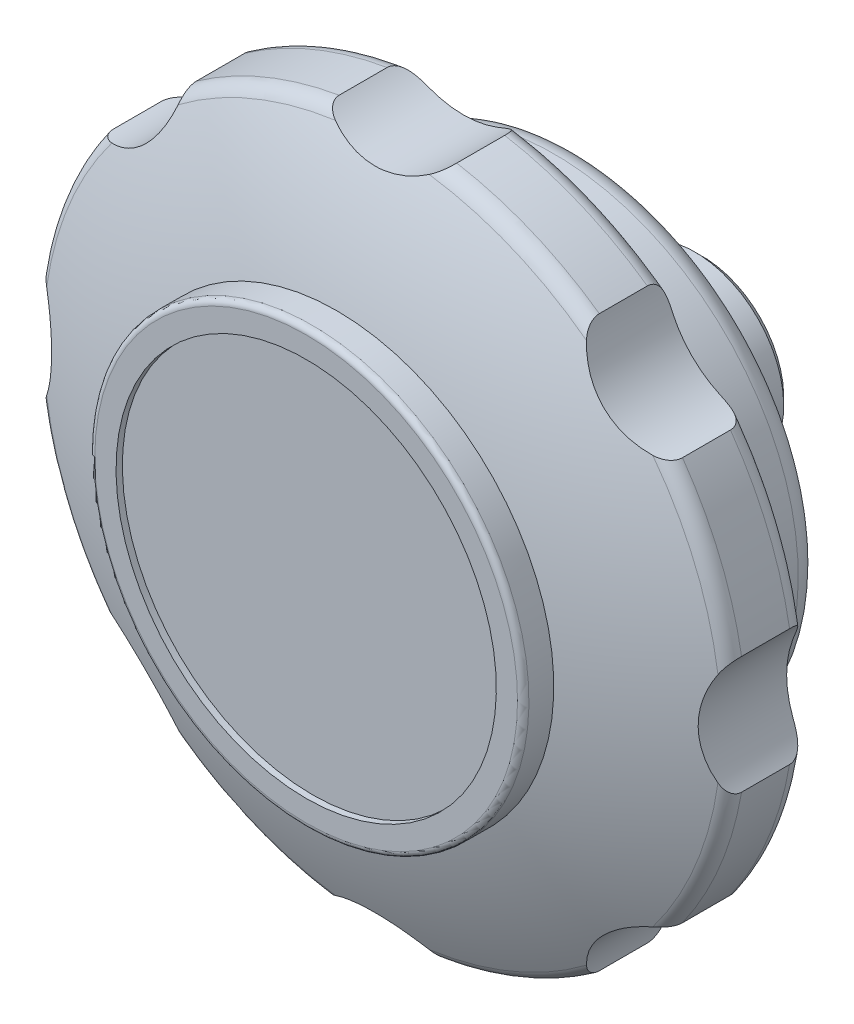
ISO-10303-21;
HEADER;
FILE_DESCRIPTION(('STEP AP214'),'2;1');
FILE_NAME('part.step','',(''),(''),'','','');
FILE_SCHEMA(('AUTOMOTIVE_DESIGN { 1 0 10303 214 1 1 1 1 }'));
ENDSEC;
DATA;
#1=APPLICATION_CONTEXT('core data for automotive mechanical design processes');
#2=APPLICATION_PROTOCOL_DEFINITION('international standard','automotive_design',2000,#1);
#3=PRODUCT_CONTEXT('',#1,'mechanical');
#4=PRODUCT('Part','Part','',(#3));
#5=PRODUCT_RELATED_PRODUCT_CATEGORY('part','',(#4));
#6=PRODUCT_DEFINITION_FORMATION('','',#4);
#7=PRODUCT_DEFINITION_CONTEXT('part definition',#1,'design');
#8=PRODUCT_DEFINITION('design','',#6,#7);
#9=PRODUCT_DEFINITION_SHAPE('','',#8);
#10=(LENGTH_UNIT() NAMED_UNIT(*) SI_UNIT(.MILLI.,.METRE.));
#11=(NAMED_UNIT(*) PLANE_ANGLE_UNIT() SI_UNIT($,.RADIAN.));
#12=(NAMED_UNIT(*) SI_UNIT($,.STERADIAN.) SOLID_ANGLE_UNIT());
#13=UNCERTAINTY_MEASURE_WITH_UNIT(LENGTH_MEASURE(1.E-05),#10,'distance_accuracy_value','');
#14=(GEOMETRIC_REPRESENTATION_CONTEXT(3) GLOBAL_UNCERTAINTY_ASSIGNED_CONTEXT((#13)) GLOBAL_UNIT_ASSIGNED_CONTEXT((#10,
#11,#12)) REPRESENTATION_CONTEXT('',''));
#15=CARTESIAN_POINT('',(0.,0.,0.));
#16=DIRECTION('',(0.,0.,1.));
#17=DIRECTION('',(1.,0.,0.));
#18=AXIS2_PLACEMENT_3D('',#15,#16,#17);
#19=CARTESIAN_POINT('',(3.22,0.,22.));
#20=DIRECTION('',(0.,0.,-1.));
#21=DIRECTION('',(0.,1.,0.));
#22=AXIS2_PLACEMENT_3D('',#19,#20,#21);
#23=PLANE('',#22);
#24=CARTESIAN_POINT('',(0.,0.,21.9999999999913));
#25=DIRECTION('',(0.,0.,1.));
#26=DIRECTION('',(0.,-1.,0.));
#27=AXIS2_PLACEMENT_3D('',#24,#25,#26);
#28=CIRCLE('',#27,6.43999999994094);
#29=CARTESIAN_POINT('',(0.,-6.43999999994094,21.9999999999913));
#30=VERTEX_POINT('',#29);
#31=EDGE_CURVE('E1499',#30,#30,#28,.F.);
#32=ORIENTED_EDGE('',*,*,#31,.T.);
#33=EDGE_LOOP('',(#32));
#34=FACE_BOUND('',#33,.T.);
#35=ADVANCED_FACE('F14',(#34),#23,.T.);
#36=CARTESIAN_POINT('',(0.,0.,21.9999999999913));
#37=DIRECTION('',(0.,0.,1.));
#38=DIRECTION('',(0.,-1.,0.));
#39=AXIS2_PLACEMENT_3D('',#36,#37,#38);
#40=CONICAL_SURFACE('',#39,6.43999999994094,0.785398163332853);
#41=ORIENTED_EDGE('',*,*,#31,.F.);
#42=EDGE_LOOP('',(#41));
#43=FACE_BOUND('',#42,.T.);
#44=CARTESIAN_POINT('',(0.,0.,21.56));
#45=DIRECTION('',(0.,0.,1.));
#46=DIRECTION('',(0.,-1.,0.));
#47=AXIS2_PLACEMENT_3D('',#44,#45,#46);
#48=CIRCLE('',#47,6.);
#49=CARTESIAN_POINT('',(0.,-6.,21.56));
#50=VERTEX_POINT('',#49);
#51=EDGE_CURVE('E374',#50,#50,#48,.F.);
#52=ORIENTED_EDGE('',*,*,#51,.T.);
#53=EDGE_LOOP('',(#52));
#54=FACE_BOUND('',#53,.T.);
#55=ADVANCED_FACE('F1468',(#43,#54),#40,.F.);
#56=CARTESIAN_POINT('',(0.,0.,11.));
#57=DIRECTION('',(0.,0.,1.));
#58=DIRECTION('',(0.,-1.,0.));
#59=AXIS2_PLACEMENT_3D('',#56,#57,#58);
#60=CYLINDRICAL_SURFACE('',#59,6.);
#61=CARTESIAN_POINT('',(0.,0.,0.440000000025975));
#62=DIRECTION('',(0.,0.,-1.));
#63=DIRECTION('',(1.,0.,0.));
#64=AXIS2_PLACEMENT_3D('',#61,#62,#63);
#65=CIRCLE('',#64,5.99999999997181);
#66=CARTESIAN_POINT('',(5.99999999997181,0.,0.440000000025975));
#67=VERTEX_POINT('',#66);
#68=EDGE_CURVE('E370',#67,#67,#65,.T.);
#69=ORIENTED_EDGE('',*,*,#68,.T.);
#70=EDGE_LOOP('',(#69));
#71=FACE_BOUND('',#70,.T.);
#72=ORIENTED_EDGE('',*,*,#51,.F.);
#73=EDGE_LOOP('',(#72));
#74=FACE_BOUND('',#73,.T.);
#75=CARTESIAN_POINT('',(6.,0.,8.5));
#76=CARTESIAN_POINT('',(5.99999588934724,0.134133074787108,8.49999500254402));
#77=CARTESIAN_POINT('',(5.99545782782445,0.268318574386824,8.48915815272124));
#78=CARTESIAN_POINT('',(5.97777678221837,0.532713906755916,8.44625945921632));
#79=CARTESIAN_POINT('',(5.9646273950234,0.662920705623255,8.4141818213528));
#80=CARTESIAN_POINT('',(5.93112998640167,0.915355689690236,8.33018786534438));
#81=CARTESIAN_POINT('',(5.9108012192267,1.03760418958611,8.27832458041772));
#82=CARTESIAN_POINT('',(5.8649169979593,1.27160790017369,8.15648539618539));
#83=CARTESIAN_POINT('',(5.83936080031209,1.38336161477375,8.08650691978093));
#84=CARTESIAN_POINT('',(5.7841552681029,1.59890253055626,7.9267382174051));
#85=CARTESIAN_POINT('',(5.75437226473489,1.70209240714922,7.83618884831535));
#86=CARTESIAN_POINT('',(5.69465145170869,1.89232770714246,7.63946131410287));
#87=CARTESIAN_POINT('',(5.6647135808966,1.97936615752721,7.53327643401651));
#88=CARTESIAN_POINT('',(5.60642065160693,2.13907420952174,7.30194729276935));
#89=CARTESIAN_POINT('',(5.57821613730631,2.21082515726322,7.17612688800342));
#90=CARTESIAN_POINT('',(5.52871174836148,2.33187810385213,6.91285542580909));
#91=CARTESIAN_POINT('',(5.50740841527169,2.3811913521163,6.77541023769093));
#92=CARTESIAN_POINT('',(5.47557111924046,2.4534919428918,6.49969271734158));
#93=CARTESIAN_POINT('',(5.46456776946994,2.4776331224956,6.36177924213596));
#94=CARTESIAN_POINT('',(5.45322652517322,2.50250419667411,6.08345362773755));
#95=CARTESIAN_POINT('',(5.45288276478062,2.50324696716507,5.94304290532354));
#96=CARTESIAN_POINT('',(5.46250239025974,2.48216901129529,5.67519990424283));
#97=CARTESIAN_POINT('',(5.47167765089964,2.4620736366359,5.54759785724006));
#98=CARTESIAN_POINT('',(5.49796964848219,2.40278382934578,5.29777586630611));
#99=CARTESIAN_POINT('',(5.51508790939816,2.36358573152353,5.17555696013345));
#100=CARTESIAN_POINT('',(5.5557240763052,2.26643828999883,4.93688236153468));
#101=CARTESIAN_POINT('',(5.57937051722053,2.208107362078,4.82060485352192));
#102=CARTESIAN_POINT('',(5.63036763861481,2.0746219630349,4.59904060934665));
#103=CARTESIAN_POINT('',(5.65771964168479,1.99946147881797,4.49375782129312));
#104=CARTESIAN_POINT('',(5.71585546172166,1.82700441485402,4.28781456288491));
#105=CARTESIAN_POINT('',(5.74673410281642,1.72837508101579,4.18829385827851));
#106=CARTESIAN_POINT('',(5.80650564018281,1.51548857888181,4.00679503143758));
#107=CARTESIAN_POINT('',(5.83539752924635,1.40122357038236,3.92482576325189));
#108=CARTESIAN_POINT('',(5.88878533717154,1.15681166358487,3.77907522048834));
#109=CARTESIAN_POINT('',(5.91316091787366,1.0263526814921,3.71577075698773));
#110=CARTESIAN_POINT('',(5.95381339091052,0.755478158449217,3.61249732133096));
#111=CARTESIAN_POINT('',(5.97010642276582,0.615083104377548,3.57248181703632));
#112=CARTESIAN_POINT('',(5.98753108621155,0.394437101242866,3.5300425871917));
#113=CARTESIAN_POINT('',(5.9921888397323,0.316059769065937,3.5187960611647));
#114=CARTESIAN_POINT('',(5.99842513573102,0.158467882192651,3.50377252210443));
#115=CARTESIAN_POINT('',(6.00000372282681,0.0792533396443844,3.49999540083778));
#116=CARTESIAN_POINT('',(5.99999370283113,-0.134057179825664,3.50000777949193));
#117=CARTESIAN_POINT('',(5.99546013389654,-0.268225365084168,3.51083573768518));
#118=CARTESIAN_POINT('',(5.97778556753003,-0.53264137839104,3.55371974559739));
#119=CARTESIAN_POINT('',(5.96463278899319,-0.662883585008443,3.58580485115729));
#120=CARTESIAN_POINT('',(5.9311286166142,-0.915362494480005,3.66981537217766));
#121=CARTESIAN_POINT('',(5.91079821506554,-1.03762132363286,3.72168296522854));
#122=CARTESIAN_POINT('',(5.86491332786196,-1.27162479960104,3.84352478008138));
#123=CARTESIAN_POINT('',(5.83935885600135,-1.38336947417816,3.91349895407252));
#124=CARTESIAN_POINT('',(5.78415756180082,-1.59889329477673,4.07325488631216));
#125=CARTESIAN_POINT('',(5.75437711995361,-1.70207535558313,4.16379547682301));
#126=CARTESIAN_POINT('',(5.694656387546,-1.89231357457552,4.36052211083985));
#127=CARTESIAN_POINT('',(5.66471601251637,-1.97936011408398,4.46671741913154));
#128=CARTESIAN_POINT('',(5.60640784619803,-2.13910864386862,4.69809984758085));
#129=CARTESIAN_POINT('',(5.57819173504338,-2.21088488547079,4.82396774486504));
#130=CARTESIAN_POINT('',(5.52869386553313,-2.33192175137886,5.08727472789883));
#131=CARTESIAN_POINT('',(5.50740278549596,-2.38121267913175,5.22469794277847));
#132=CARTESIAN_POINT('',(5.47920077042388,-2.44524299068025,5.46883040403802));
#133=CARTESIAN_POINT('',(5.46995803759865,-2.46572150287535,5.57379489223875));
#134=CARTESIAN_POINT('',(5.45753399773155,-2.49310071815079,5.7858285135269));
#135=CARTESIAN_POINT('',(5.45435140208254,-2.50000430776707,5.89289719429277));
#136=CARTESIAN_POINT('',(5.45436186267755,-2.49999462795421,6.13356366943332));
#137=CARTESIAN_POINT('',(5.45932435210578,-2.48924637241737,6.26718040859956));
#138=CARTESIAN_POINT('',(5.47850536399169,-2.4467318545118,6.53039027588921));
#139=CARTESIAN_POINT('',(5.49273179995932,-2.41494762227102,6.65997986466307));
#140=CARTESIAN_POINT('',(5.5285339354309,-2.33180934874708,6.91110205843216));
#141=CARTESIAN_POINT('',(5.55008495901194,-2.28052094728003,7.03266009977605));
#142=CARTESIAN_POINT('',(5.59807182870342,-2.16004210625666,7.26546952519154));
#143=CARTESIAN_POINT('',(5.62450860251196,-2.09084826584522,7.37671894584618));
#144=CARTESIAN_POINT('',(5.68111453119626,-1.93194992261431,7.59264937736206));
#145=CARTESIAN_POINT('',(5.71140993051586,-1.84131153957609,7.69661027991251));
#146=CARTESIAN_POINT('',(5.77128451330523,-1.64404759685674,7.8883962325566));
#147=CARTESIAN_POINT('',(5.80086338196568,-1.53741515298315,7.9762142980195));
#148=CARTESIAN_POINT('',(5.85752236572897,-1.3054824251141,8.13693162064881));
#149=CARTESIAN_POINT('',(5.88443645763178,-1.17956936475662,8.20900970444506));
#150=CARTESIAN_POINT('',(5.93114629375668,-0.916141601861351,8.33059332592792));
#151=CARTESIAN_POINT('',(5.95095085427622,-0.778641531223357,8.3801268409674));
#152=CARTESIAN_POINT('',(5.97710827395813,-0.53391532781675,8.44467287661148));
#153=CARTESIAN_POINT('',(5.98563955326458,-0.428388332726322,8.46536755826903));
#154=CARTESIAN_POINT('',(5.99708664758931,-0.215251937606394,8.49303210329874));
#155=CARTESIAN_POINT('',(6.00000329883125,-0.107642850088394,8.50000401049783));
#156=CARTESIAN_POINT('',(6.,0.,8.5));
#157=B_SPLINE_CURVE_WITH_KNOTS('',3,(#75,#76,#77,#78,#79,#80,#81,#82,#83,#84,#85,#86,#87,#88,
#89,#90,#91,#92,#93,#94,#95,#96,#97,#98,#99,#100,#101,#102,#103,#104,#105,#106,#107,#108,#109,
#110,#111,#112,#113,#114,#115,#116,#117,#118,#119,#120,#121,#122,#123,#124,#125,#126,#127,#128,
#129,#130,#131,#132,#133,#134,#135,#136,#137,#138,#139,#140,#141,#142,#143,#144,#145,#146,#147,
#148,#149,#150,#151,#152,#153,#154,#155,#156),.UNSPECIFIED.,.T.,.F.,(4,2,2,2,2,2,2,2,2,2,2,2,2,
2,2,2,2,2,2,2,2,2,2,2,2,2,2,2,2,2,2,2,2,2,2,2,2,2,2,2,4),(0.,0.40198889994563,0.804277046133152,
1.20549439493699,1.60676885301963,2.0263784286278,2.44616874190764,2.88663136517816,
3.32687291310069,3.74590512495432,4.16470674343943,4.551403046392,4.93817357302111,
5.33318155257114,5.72833089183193,6.15682509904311,6.58553495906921,7.0243996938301,
7.46238452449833,7.69996576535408,7.93754356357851,8.33940687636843,8.74182062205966,
9.14306705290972,9.54431242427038,9.9638877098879,10.3837123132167,10.8243622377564,
11.2644165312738,11.5854603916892,11.9064359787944,12.3067119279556,12.707330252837,
13.1066120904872,13.5059698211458,13.9277628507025,14.3497379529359,14.7901816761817,
15.2300773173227,15.5527246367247,15.8753238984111),.UNSPECIFIED.);
#158=CARTESIAN_POINT('',(6.,0.,8.5));
#159=VERTEX_POINT('',#158);
#160=EDGE_CURVE('E377',#159,#159,#157,.T.);
#161=ORIENTED_EDGE('',*,*,#160,.F.);
#162=EDGE_LOOP('',(#161));
#163=FACE_BOUND('',#162,.T.);
#164=ADVANCED_FACE('F1458',(#71,#74,#163),#60,.F.);
#165=CARTESIAN_POINT('',(0.,0.,5.6843418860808E-11));
#166=DIRECTION('',(0.,0.,-1.));
#167=DIRECTION('',(0.,1.,0.));
#168=AXIS2_PLACEMENT_3D('',#165,#166,#167);
#169=CONICAL_SURFACE('',#168,6.43999999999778,0.785398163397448);
#170=ORIENTED_EDGE('',*,*,#68,.F.);
#171=EDGE_LOOP('',(#170));
#172=FACE_BOUND('',#171,.T.);
#173=CARTESIAN_POINT('',(0.,0.,5.6843418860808E-11));
#174=DIRECTION('',(0.,0.,-1.));
#175=DIRECTION('',(0.,1.,0.));
#176=AXIS2_PLACEMENT_3D('',#173,#174,#175);
#177=CIRCLE('',#176,6.43999999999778);
#178=CARTESIAN_POINT('',(0.,6.43999999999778,5.6843418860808E-11));
#179=VERTEX_POINT('',#178);
#180=EDGE_CURVE('E373',#179,#179,#177,.F.);
#181=ORIENTED_EDGE('',*,*,#180,.F.);
#182=EDGE_LOOP('',(#181));
#183=FACE_BOUND('',#182,.T.);
#184=ADVANCED_FACE('F1448',(#172,#183),#169,.F.);
#185=CARTESIAN_POINT('',(8.72,0.,0.));
#186=DIRECTION('',(0.,0.,-1.));
#187=DIRECTION('',(-1.,0.,0.));
#188=AXIS2_PLACEMENT_3D('',#185,#186,#187);
#189=PLANE('',#188);
#190=CARTESIAN_POINT('',(0.,0.,0.));
#191=DIRECTION('',(0.,0.,1.));
#192=DIRECTION('',(0.,-1.,0.));
#193=AXIS2_PLACEMENT_3D('',#190,#191,#192);
#194=CIRCLE('',#193,11.);
#195=CARTESIAN_POINT('',(0.,-11.,0.));
#196=VERTEX_POINT('',#195);
#197=EDGE_CURVE('E1518',#196,#196,#194,.T.);
#198=ORIENTED_EDGE('',*,*,#197,.F.);
#199=EDGE_LOOP('',(#198));
#200=FACE_BOUND('',#199,.T.);
#201=ORIENTED_EDGE('',*,*,#180,.T.);
#202=EDGE_LOOP('',(#201));
#203=FACE_BOUND('',#202,.T.);
#204=ADVANCED_FACE('F1438',(#200,#203),#189,.T.);
#205=CARTESIAN_POINT('',(0.,0.,0.15));
#206=DIRECTION('',(0.,0.,1.));
#207=DIRECTION('',(0.,-1.,0.));
#208=AXIS2_PLACEMENT_3D('',#205,#206,#207);
#209=CYLINDRICAL_SURFACE('',#208,11.);
#210=ORIENTED_EDGE('',*,*,#197,.T.);
#211=EDGE_LOOP('',(#210));
#212=FACE_BOUND('',#211,.T.);
#213=CARTESIAN_POINT('',(0.,0.,0.3));
#214=DIRECTION('',(0.,0.,1.));
#215=DIRECTION('',(0.,-1.,0.));
#216=AXIS2_PLACEMENT_3D('',#213,#214,#215);
#217=CIRCLE('',#216,11.);
#218=CARTESIAN_POINT('',(0.,-11.,0.3));
#219=VERTEX_POINT('',#218);
#220=EDGE_CURVE('E1516',#219,#219,#217,.T.);
#221=ORIENTED_EDGE('',*,*,#220,.F.);
#222=EDGE_LOOP('',(#221));
#223=FACE_BOUND('',#222,.T.);
#224=ADVANCED_FACE('F1428',(#212,#223),#209,.T.);
#225=CARTESIAN_POINT('',(11.92,0.,0.3));
#226=DIRECTION('',(0.,0.,-1.));
#227=DIRECTION('',(0.,1.,0.));
#228=AXIS2_PLACEMENT_3D('',#225,#226,#227);
#229=PLANE('',#228);
#230=CARTESIAN_POINT('',(0.,0.,0.3));
#231=DIRECTION('',(0.,0.,1.));
#232=DIRECTION('',(0.,-1.,0.));
#233=AXIS2_PLACEMENT_3D('',#230,#231,#232);
#234=CIRCLE('',#233,12.84);
#235=CARTESIAN_POINT('',(0.,-12.84,0.3));
#236=VERTEX_POINT('',#235);
#237=EDGE_CURVE('E1509',#236,#236,#234,.T.);
#238=ORIENTED_EDGE('',*,*,#237,.F.);
#239=EDGE_LOOP('',(#238));
#240=FACE_BOUND('',#239,.T.);
#241=ORIENTED_EDGE('',*,*,#220,.T.);
#242=EDGE_LOOP('',(#241));
#243=FACE_BOUND('',#242,.T.);
#244=ADVANCED_FACE('F1418',(#240,#243),#229,.T.);
#245=CARTESIAN_POINT('',(7.,0.,6.));
#246=DIRECTION('',(-1.,0.,0.));
#247=DIRECTION('',(0.,-1.,0.));
#248=AXIS2_PLACEMENT_3D('',#245,#246,#247);
#249=CYLINDRICAL_SURFACE('',#248,2.5);
#250=CARTESIAN_POINT('',(14.,0.,8.5));
#251=CARTESIAN_POINT('',(13.9999971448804,0.139100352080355,8.49999350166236));
#252=CARTESIAN_POINT('',(13.9979035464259,0.278376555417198,8.48834120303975));
#253=CARTESIAN_POINT('',(13.9897475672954,0.553119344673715,8.44203553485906));
#254=CARTESIAN_POINT('',(13.9836771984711,0.688577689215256,8.40733586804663));
#255=CARTESIAN_POINT('',(13.9682477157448,0.951511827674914,8.31602167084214));
#256=CARTESIAN_POINT('',(13.95889288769,1.07899777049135,8.25943568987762));
#257=CARTESIAN_POINT('',(13.9379215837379,1.32261467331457,8.1260241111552));
#258=CARTESIAN_POINT('',(13.9263059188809,1.43874968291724,8.04920576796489));
#259=CARTESIAN_POINT('',(13.9019526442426,1.65770423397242,7.87660306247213));
#260=CARTESIAN_POINT('',(13.8892050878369,1.76038095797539,7.78063889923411));
#261=CARTESIAN_POINT('',(13.864099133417,1.94827173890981,7.57285109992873));
#262=CARTESIAN_POINT('',(13.8517407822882,2.03348369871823,7.4610255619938));
#263=CARTESIAN_POINT('',(13.8287180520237,2.18459635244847,7.22370936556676));
#264=CARTESIAN_POINT('',(13.8180663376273,2.2503554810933,7.09812722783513));
#265=CARTESIAN_POINT('',(13.7998004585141,2.35978916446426,6.83747767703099));
#266=CARTESIAN_POINT('',(13.792186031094,2.40346562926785,6.70241108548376));
#267=CARTESIAN_POINT('',(13.7809553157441,2.46704524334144,6.42813128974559));
#268=CARTESIAN_POINT('',(13.7772978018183,2.48719370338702,6.28897667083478));
#269=CARTESIAN_POINT('',(13.7742705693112,2.50390641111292,6.00921730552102));
#270=CARTESIAN_POINT('',(13.7749005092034,2.50047253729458,5.8686126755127));
#271=CARTESIAN_POINT('',(13.7803394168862,2.47031742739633,5.591711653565));
#272=CARTESIAN_POINT('',(13.7850985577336,2.44387383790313,5.45538390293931));
#273=CARTESIAN_POINT('',(13.7981815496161,2.36888613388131,5.18913040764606));
#274=CARTESIAN_POINT('',(13.8065055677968,2.32034098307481,5.05920496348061));
#275=CARTESIAN_POINT('',(13.8258335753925,2.20225046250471,4.80862074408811));
#276=CARTESIAN_POINT('',(13.8368520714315,2.13259091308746,4.6880169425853));
#277=CARTESIAN_POINT('',(13.8603166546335,1.97433550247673,4.46011429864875));
#278=CARTESIAN_POINT('',(13.8727627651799,1.88573933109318,4.35281567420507));
#279=CARTESIAN_POINT('',(13.8978965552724,1.69063903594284,4.15297174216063));
#280=CARTESIAN_POINT('',(13.9105851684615,1.58390029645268,4.06065547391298));
#281=CARTESIAN_POINT('',(13.9346187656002,1.35627280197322,3.89516572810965));
#282=CARTESIAN_POINT('',(13.9459631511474,1.23537779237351,3.82200075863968));
#283=CARTESIAN_POINT('',(13.9660510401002,0.982608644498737,3.69686810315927));
#284=CARTESIAN_POINT('',(13.9747896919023,0.850714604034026,3.64493989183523));
#285=CARTESIAN_POINT('',(13.9886308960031,0.580057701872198,3.56414257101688));
#286=CARTESIAN_POINT('',(13.9937411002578,0.441309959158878,3.53522491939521));
#287=CARTESIAN_POINT('',(13.9978349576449,0.251283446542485,3.5121489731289));
#288=CARTESIAN_POINT('',(13.9986450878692,0.201144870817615,3.50759685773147));
#289=CARTESIAN_POINT('',(13.9997281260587,0.100678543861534,3.50152119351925));
#290=CARTESIAN_POINT('',(14.0000010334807,0.0503507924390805,3.49999764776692));
#291=CARTESIAN_POINT('',(13.9999971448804,-0.139100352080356,3.50000649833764));
#292=CARTESIAN_POINT('',(13.9979035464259,-0.278376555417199,3.51165879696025));
#293=CARTESIAN_POINT('',(13.9897475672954,-0.553119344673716,3.55796446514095));
#294=CARTESIAN_POINT('',(13.9836771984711,-0.688577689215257,3.59266413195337));
#295=CARTESIAN_POINT('',(13.9682477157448,-0.951511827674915,3.68397832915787));
#296=CARTESIAN_POINT('',(13.95889288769,-1.07899777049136,3.74056431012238));
#297=CARTESIAN_POINT('',(13.9379215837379,-1.32261467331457,3.8739758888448));
#298=CARTESIAN_POINT('',(13.9263059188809,-1.43874968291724,3.95079423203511));
#299=CARTESIAN_POINT('',(13.9019526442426,-1.65770423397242,4.12339693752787));
#300=CARTESIAN_POINT('',(13.8892050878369,-1.76038095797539,4.21936110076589));
#301=CARTESIAN_POINT('',(13.864099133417,-1.94827173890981,4.42714890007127));
#302=CARTESIAN_POINT('',(13.8517407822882,-2.03348369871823,4.5389744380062));
#303=CARTESIAN_POINT('',(13.8287180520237,-2.18459635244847,4.77629063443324));
#304=CARTESIAN_POINT('',(13.8180663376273,-2.2503554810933,4.90187277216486));
#305=CARTESIAN_POINT('',(13.7998004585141,-2.35978916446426,5.16252232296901));
#306=CARTESIAN_POINT('',(13.792186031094,-2.40346562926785,5.29758891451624));
#307=CARTESIAN_POINT('',(13.7809553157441,-2.46704524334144,5.57186871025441));
#308=CARTESIAN_POINT('',(13.7772978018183,-2.48719370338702,5.71102332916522));
#309=CARTESIAN_POINT('',(13.7742705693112,-2.50390641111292,5.99078269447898));
#310=CARTESIAN_POINT('',(13.7749005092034,-2.50047253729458,6.1313873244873));
#311=CARTESIAN_POINT('',(13.7803394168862,-2.47031742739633,6.408288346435));
#312=CARTESIAN_POINT('',(13.7850985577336,-2.44387383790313,6.54461609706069));
#313=CARTESIAN_POINT('',(13.7981815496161,-2.36888613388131,6.81086959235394));
#314=CARTESIAN_POINT('',(13.8065055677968,-2.32034098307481,6.9407950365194));
#315=CARTESIAN_POINT('',(13.8258335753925,-2.20225046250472,7.1913792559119));
#316=CARTESIAN_POINT('',(13.8368520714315,-2.13259091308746,7.3119830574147));
#317=CARTESIAN_POINT('',(13.8603166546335,-1.97433550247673,7.53988570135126));
#318=CARTESIAN_POINT('',(13.8727627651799,-1.88573933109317,7.64718432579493));
#319=CARTESIAN_POINT('',(13.8978965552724,-1.69063903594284,7.84702825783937));
#320=CARTESIAN_POINT('',(13.9105851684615,-1.58390029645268,7.93934452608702));
#321=CARTESIAN_POINT('',(13.9346187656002,-1.35627280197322,8.10483427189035));
#322=CARTESIAN_POINT('',(13.9459631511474,-1.23537779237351,8.17799924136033));
#323=CARTESIAN_POINT('',(13.9660510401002,-0.982608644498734,8.30313189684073));
#324=CARTESIAN_POINT('',(13.9747896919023,-0.850714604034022,8.35506010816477));
#325=CARTESIAN_POINT('',(13.9886308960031,-0.580057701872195,8.43585742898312));
#326=CARTESIAN_POINT('',(13.9937411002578,-0.441309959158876,8.4647750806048));
#327=CARTESIAN_POINT('',(13.9978349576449,-0.251283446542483,8.4878510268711));
#328=CARTESIAN_POINT('',(13.9986450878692,-0.201144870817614,8.49240314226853));
#329=CARTESIAN_POINT('',(13.9997281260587,-0.100678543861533,8.49847880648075));
#330=CARTESIAN_POINT('',(14.0000010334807,-0.0503507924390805,8.50000235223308));
#331=CARTESIAN_POINT('',(14.,0.,8.5));
#332=B_SPLINE_CURVE_WITH_KNOTS('',3,(#250,#251,#252,#253,#254,#255,#256,#257,#258,#259,#260,
#261,#262,#263,#264,#265,#266,#267,#268,#269,#270,#271,#272,#273,#274,#275,#276,#277,#278,#279,
#280,#281,#282,#283,#284,#285,#286,#287,#288,#289,#290,#291,#292,#293,#294,#295,#296,#297,#298,
#299,#300,#301,#302,#303,#304,#305,#306,#307,#308,#309,#310,#311,#312,#313,#314,#315,#316,#317,
#318,#319,#320,#321,#322,#323,#324,#325,#326,#327,#328,#329,#330,#331),.UNSPECIFIED.,.T.,.F.,(4,
2,2,2,2,2,2,2,2,2,2,2,2,2,2,2,2,2,2,2,2,2,2,2,2,2,2,2,2,2,2,2,2,2,2,2,2,2,2,2,4),(0.,
0.417108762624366,0.835057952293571,1.25246378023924,1.66972014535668,2.09109697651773,
2.51252437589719,2.93694719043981,3.36133328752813,3.78125392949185,4.20114112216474,
4.61603092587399,5.03094018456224,5.44813442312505,5.86533549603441,6.28841172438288,
6.7116755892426,7.13572267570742,7.55887282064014,7.70985543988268,7.86083821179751,
8.27794697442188,8.69589616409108,9.11330199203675,9.53055835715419,9.95193518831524,
10.3733625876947,10.7977854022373,11.2221714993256,11.6420921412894,12.0619793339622,
12.4768691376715,12.8917783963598,13.3089726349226,13.7261737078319,14.1492499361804,
14.5725138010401,14.9965608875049,15.4197110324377,15.5706936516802,15.721676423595),.UNSPECIFIED.);
#333=CARTESIAN_POINT('',(14.,0.,8.5));
#334=VERTEX_POINT('',#333);
#335=EDGE_CURVE('E369',#334,#334,#332,.T.);
#336=ORIENTED_EDGE('',*,*,#335,.F.);
#337=EDGE_LOOP('',(#336));
#338=FACE_BOUND('',#337,.T.);
#339=ORIENTED_EDGE('',*,*,#160,.T.);
#340=EDGE_LOOP('',(#339));
#341=FACE_BOUND('',#340,.T.);
#342=ADVANCED_FACE('F1409',(#338,#341),#249,.F.);
#343=CARTESIAN_POINT('',(0.,0.,1.46));
#344=DIRECTION('',(0.,0.,1.));
#345=DIRECTION('',(0.,-1.,0.));
#346=AXIS2_PLACEMENT_3D('',#343,#344,#345);
#347=CONICAL_SURFACE('',#346,14.,0.785398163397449);
#348=ORIENTED_EDGE('',*,*,#237,.T.);
#349=EDGE_LOOP('',(#348));
#350=FACE_BOUND('',#349,.T.);
#351=CARTESIAN_POINT('',(0.,0.,1.46));
#352=DIRECTION('',(0.,0.,1.));
#353=DIRECTION('',(0.,-1.,0.));
#354=AXIS2_PLACEMENT_3D('',#351,#352,#353);
#355=CIRCLE('',#354,14.);
#356=CARTESIAN_POINT('',(0.,-14.,1.46));
#357=VERTEX_POINT('',#356);
#358=EDGE_CURVE('E366',#357,#357,#355,.T.);
#359=ORIENTED_EDGE('',*,*,#358,.F.);
#360=EDGE_LOOP('',(#359));
#361=FACE_BOUND('',#360,.T.);
#362=ADVANCED_FACE('F1400',(#350,#361),#347,.T.);
#363=CARTESIAN_POINT('',(0.,0.,10.03));
#364=DIRECTION('',(0.,0.,1.));
#365=DIRECTION('',(0.,-1.,0.));
#366=AXIS2_PLACEMENT_3D('',#363,#364,#365);
#367=CYLINDRICAL_SURFACE('',#366,14.);
#368=ORIENTED_EDGE('',*,*,#335,.T.);
#369=EDGE_LOOP('',(#368));
#370=FACE_BOUND('',#369,.T.);
#371=ORIENTED_EDGE('',*,*,#358,.T.);
#372=EDGE_LOOP('',(#371));
#373=FACE_BOUND('',#372,.T.);
#374=CARTESIAN_POINT('',(0.,0.,18.6));
#375=DIRECTION('',(0.,0.,-1.));
#376=DIRECTION('',(0.,1.,0.));
#377=AXIS2_PLACEMENT_3D('',#374,#375,#376);
#378=CIRCLE('',#377,14.);
#379=CARTESIAN_POINT('',(0.,14.,18.6));
#380=VERTEX_POINT('',#379);
#381=EDGE_CURVE('E357',#380,#380,#378,.T.);
#382=ORIENTED_EDGE('',*,*,#381,.T.);
#383=EDGE_LOOP('',(#382));
#384=FACE_BOUND('',#383,.T.);
#385=ADVANCED_FACE('F342',(#370,#373,#384),#367,.T.);
#386=CARTESIAN_POINT('',(0.,0.,18.6));
#387=DIRECTION('',(0.,0.,-1.));
#388=DIRECTION('',(0.,1.,0.));
#389=AXIS2_PLACEMENT_3D('',#386,#387,#388);
#390=TOROIDAL_SURFACE('',#389,15.4,1.4);
#391=CARTESIAN_POINT('',(0.,0.,20.));
#392=DIRECTION('',(0.,0.,-1.));
#393=DIRECTION('',(0.,-1.,0.));
#394=AXIS2_PLACEMENT_3D('',#391,#392,#393);
#395=CIRCLE('',#394,15.4);
#396=CARTESIAN_POINT('',(0.,15.4,20.));
#397=VERTEX_POINT('',#396);
#398=CARTESIAN_POINT('',(0.,-15.4,20.));
#399=VERTEX_POINT('',#398);
#400=EDGE_CURVE('E353',#397,#399,#395,.F.);
#401=ORIENTED_EDGE('',*,*,#400,.F.);
#402=CARTESIAN_POINT('',(0.,0.,20.));
#403=DIRECTION('',(0.,0.,-1.));
#404=DIRECTION('',(0.,1.,0.));
#405=AXIS2_PLACEMENT_3D('',#402,#403,#404);
#406=CIRCLE('',#405,15.4);
#407=CARTESIAN_POINT('',(15.4,0.,20.));
#408=VERTEX_POINT('',#407);
#409=EDGE_CURVE('E324',#408,#397,#406,.F.);
#410=ORIENTED_EDGE('',*,*,#409,.F.);
#411=CARTESIAN_POINT('',(0.,0.,20.));
#412=DIRECTION('',(0.,0.,-1.));
#413=DIRECTION('',(1.,0.,0.));
#414=AXIS2_PLACEMENT_3D('',#411,#412,#413);
#415=CIRCLE('',#414,15.4);
#416=EDGE_CURVE('E365',#399,#408,#415,.F.);
#417=ORIENTED_EDGE('',*,*,#416,.F.);
#418=EDGE_LOOP('',(#401,#410,#417));
#419=FACE_BOUND('',#418,.T.);
#420=ORIENTED_EDGE('',*,*,#381,.F.);
#421=EDGE_LOOP('',(#420));
#422=FACE_BOUND('',#421,.T.);
#423=ADVANCED_FACE('F331',(#419,#422),#390,.F.);
#424=CARTESIAN_POINT('',(25.1166666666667,0.,20.));
#425=DIRECTION('',(0.,0.,-1.));
#426=DIRECTION('',(0.,1.,0.));
#427=AXIS2_PLACEMENT_3D('',#424,#425,#426);
#428=PLANE('',#427);
#429=CARTESIAN_POINT('',(0.,0.,20.));
#430=DIRECTION('',(0.,0.,1.));
#431=DIRECTION('',(0.,1.,0.));
#432=AXIS2_PLACEMENT_3D('',#429,#430,#431);
#433=CIRCLE('',#432,34.8333333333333);
#434=CARTESIAN_POINT('',(0.,34.8333333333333,20.));
#435=VERTEX_POINT('',#434);
#436=CARTESIAN_POINT('',(0.,-34.8333333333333,20.));
#437=VERTEX_POINT('',#436);
#438=EDGE_CURVE('E249',#435,#437,#433,.T.);
#439=ORIENTED_EDGE('',*,*,#438,.F.);
#440=CARTESIAN_POINT('',(0.,0.,20.));
#441=DIRECTION('',(0.,0.,1.));
#442=DIRECTION('',(1.,0.,0.));
#443=AXIS2_PLACEMENT_3D('',#440,#441,#442);
#444=CIRCLE('',#443,34.8333333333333);
#445=CARTESIAN_POINT('',(34.8333333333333,0.,20.));
#446=VERTEX_POINT('',#445);
#447=EDGE_CURVE('E311',#446,#435,#444,.T.);
#448=ORIENTED_EDGE('',*,*,#447,.F.);
#449=CARTESIAN_POINT('',(0.,0.,20.));
#450=DIRECTION('',(0.,0.,1.));
#451=DIRECTION('',(0.,-1.,0.));
#452=AXIS2_PLACEMENT_3D('',#449,#450,#451);
#453=CIRCLE('',#452,34.8333333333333);
#454=EDGE_CURVE('E257',#437,#446,#453,.T.);
#455=ORIENTED_EDGE('',*,*,#454,.F.);
#456=EDGE_LOOP('',(#439,#448,#455));
#457=FACE_BOUND('',#456,.T.);
#458=ORIENTED_EDGE('',*,*,#409,.T.);
#459=ORIENTED_EDGE('',*,*,#400,.T.);
#460=ORIENTED_EDGE('',*,*,#416,.T.);
#461=EDGE_LOOP('',(#458,#459,#460));
#462=FACE_BOUND('',#461,.T.);
#463=ADVANCED_FACE('F341',(#457,#462),#428,.T.);
#464=CARTESIAN_POINT('',(0.,0.,48.3200938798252));
#465=DIRECTION('',(0.,0.,-1.));
#466=DIRECTION('',(0.,1.,0.));
#467=AXIS2_PLACEMENT_3D('',#464,#465,#466);
#468=TOROIDAL_SURFACE('',#467,52.25,2.75);
#469=CARTESIAN_POINT('',(52.9504667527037,7.39659935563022,50.7873370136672));
#470=CARTESIAN_POINT('',(53.0051725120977,7.49314680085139,50.7540733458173));
#471=CARTESIAN_POINT('',(53.0604736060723,7.588183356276,50.7170990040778));
#472=CARTESIAN_POINT('',(53.1716655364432,7.7746726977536,50.6347791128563));
#473=CARTESIAN_POINT('',(53.2275577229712,7.8661125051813,50.589406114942));
#474=CARTESIAN_POINT('',(53.3395766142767,8.04518367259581,50.4889934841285));
#475=CARTESIAN_POINT('',(53.3956989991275,8.13276128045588,50.4338518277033));
#476=CARTESIAN_POINT('',(53.506318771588,8.30169301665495,50.3136126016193));
#477=CARTESIAN_POINT('',(53.5608184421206,8.38305616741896,50.2485298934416));
#478=CARTESIAN_POINT('',(53.6791947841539,8.5563510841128,50.0914730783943));
#479=CARTESIAN_POINT('',(53.7423164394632,8.64636045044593,49.9967625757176));
#480=CARTESIAN_POINT('',(53.86065821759,8.81173665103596,49.7913904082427));
#481=CARTESIAN_POINT('',(53.9159055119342,8.88715417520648,49.6807863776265));
#482=CARTESIAN_POINT('',(53.9904806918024,8.98739255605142,49.5032048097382));
#483=CARTESIAN_POINT('',(54.014074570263,9.01880887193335,49.4416526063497));
#484=CARTESIAN_POINT('',(54.0578628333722,9.07671047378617,49.31513053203));
#485=CARTESIAN_POINT('',(54.0780590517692,9.10319842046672,49.2501625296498));
#486=CARTESIAN_POINT('',(54.1145909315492,9.15084456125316,49.1172951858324));
#487=CARTESIAN_POINT('',(54.130928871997,9.17200590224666,49.0493976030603));
#488=CARTESIAN_POINT('',(54.1593568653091,9.20867552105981,48.9112614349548));
#489=CARTESIAN_POINT('',(54.1714492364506,9.22418688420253,48.8410241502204));
#490=CARTESIAN_POINT('',(54.1914464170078,9.24977586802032,48.6961763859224));
#491=CARTESIAN_POINT('',(54.1991754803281,9.25962569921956,48.6215009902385));
#492=CARTESIAN_POINT('',(54.2095255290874,9.27279486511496,48.4712529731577));
#493=CARTESIAN_POINT('',(54.2121481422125,9.27611628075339,48.3956806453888));
#494=CARTESIAN_POINT('',(54.2121212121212,9.27609366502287,48.3200938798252));
#495=B_SPLINE_CURVE_WITH_KNOTS('',3,(#469,#470,#471,#472,#473,#474,#475,#476,#477,#478,#479,
#480,#481,#482,#483,#484,#485,#486,#487,#488,#489,#490,#491,#492,#493,#494),.UNSPECIFIED.,.F.,
.F.,(4,2,2,2,2,2,2,2,2,2,2,2,4),(0.,0.34760199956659,0.696360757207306,1.04900339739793,
1.40112391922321,1.83487196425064,2.26708505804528,2.4858806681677,2.70455781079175,
2.923105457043,3.14153357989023,3.36822591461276,3.5948459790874),.UNSPECIFIED.);
#496=CARTESIAN_POINT('',(52.9504667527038,7.39659935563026,50.7873370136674));
#497=VERTEX_POINT('',#496);
#498=CARTESIAN_POINT('',(54.2121212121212,9.27609366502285,48.3200938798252));
#499=VERTEX_POINT('',#498);
#500=EDGE_CURVE('E719',#497,#499,#495,.T.);
#501=ORIENTED_EDGE('',*,*,#500,.T.);
#502=CARTESIAN_POINT('',(0.,0.,48.3200938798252));
#503=DIRECTION('',(0.,0.,1.));
#504=DIRECTION('',(0.,-1.,0.));
#505=AXIS2_PLACEMENT_3D('',#502,#503,#504);
#506=CIRCLE('',#505,55.);
#507=CARTESIAN_POINT('',(44.8929472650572,31.7745697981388,48.3200938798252));
#508=VERTEX_POINT('',#507);
#509=EDGE_CURVE('E866',#508,#499,#506,.F.);
#510=ORIENTED_EDGE('',*,*,#509,.F.);
#511=CARTESIAN_POINT('',(44.8929472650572,31.7745697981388,48.3200938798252));
#512=CARTESIAN_POINT('',(44.8929622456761,31.7745712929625,48.3819397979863));
#513=CARTESIAN_POINT('',(44.8901560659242,31.7749027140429,48.4437782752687));
#514=CARTESIAN_POINT('',(44.8790160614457,31.7762357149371,48.5669209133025));
#515=CARTESIAN_POINT('',(44.8706847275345,31.7772369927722,48.6282253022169));
#516=CARTESIAN_POINT('',(44.8486669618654,31.7799129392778,48.7495170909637));
#517=CARTESIAN_POINT('',(44.8350089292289,31.7815840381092,48.8095097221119));
#518=CARTESIAN_POINT('',(44.8025609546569,31.7856173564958,48.9280524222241));
#519=CARTESIAN_POINT('',(44.7837706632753,31.7879796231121,48.9866023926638));
#520=CARTESIAN_POINT('',(44.7201391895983,31.796132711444,49.1593192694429));
#521=CARTESIAN_POINT('',(44.667986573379,31.8029955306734,49.2708250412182));
#522=CARTESIAN_POINT('',(44.5469929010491,31.8197850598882,49.4839948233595));
#523=CARTESIAN_POINT('',(44.4781436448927,31.8297132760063,49.5856539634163));
#524=CARTESIAN_POINT('',(44.3049768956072,31.8561868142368,49.8054891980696));
#525=CARTESIAN_POINT('',(44.196155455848,31.8738144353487,49.919987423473));
#526=CARTESIAN_POINT('',(43.9617734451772,31.9149003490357,50.1299162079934));
#527=CARTESIAN_POINT('',(43.8361373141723,31.9383854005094,50.2252555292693));
#528=CARTESIAN_POINT('',(43.6243204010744,31.9810770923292,50.364127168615));
#529=CARTESIAN_POINT('',(43.5414953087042,31.9984682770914,50.4135022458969));
#530=CARTESIAN_POINT('',(43.3726167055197,32.0354899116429,50.5055705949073));
#531=CARTESIAN_POINT('',(43.2865611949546,32.0551217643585,50.5482596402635));
#532=CARTESIAN_POINT('',(43.1131721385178,32.0963473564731,50.626899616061));
#533=CARTESIAN_POINT('',(43.0258650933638,32.1179156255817,50.6629231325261));
#534=CARTESIAN_POINT('',(42.8498013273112,32.163129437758,50.7292632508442));
#535=CARTESIAN_POINT('',(42.7610472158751,32.1867715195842,50.7595891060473));
#536=CARTESIAN_POINT('',(42.6718196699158,32.2114485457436,50.7873370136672));
#537=B_SPLINE_CURVE_WITH_KNOTS('',3,(#511,#512,#513,#514,#515,#516,#517,#518,#519,#520,#521,
#522,#523,#524,#525,#526,#527,#528,#529,#530,#531,#532,#533,#534,#535,#536),.UNSPECIFIED.,.F.,
.F.,(4,2,2,2,2,2,2,2,2,2,2,2,4),(0.,0.185460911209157,0.370838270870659,0.555240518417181,
0.739655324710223,1.10766592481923,1.47585762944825,1.95011250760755,2.42657496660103,
2.72023684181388,3.01408360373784,3.30451314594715,3.5944668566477),.UNSPECIFIED.);
#538=CARTESIAN_POINT('',(42.6718196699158,32.2114485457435,50.7873370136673));
#539=VERTEX_POINT('',#538);
#540=EDGE_CURVE('E267',#508,#539,#537,.T.);
#541=ORIENTED_EDGE('',*,*,#540,.T.);
#542=CARTESIAN_POINT('',(0.,0.,50.7873370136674));
#543=DIRECTION('',(0.,0.,-1.));
#544=DIRECTION('',(0.,1.,0.));
#545=AXIS2_PLACEMENT_3D('',#542,#543,#544);
#546=CIRCLE('',#545,53.464582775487);
#547=EDGE_CURVE('E921',#497,#539,#546,.F.);
#548=ORIENTED_EDGE('',*,*,#547,.F.);
#549=EDGE_LOOP('',(#501,#510,#541,#548));
#550=FACE_BOUND('',#549,.T.);
#551=ADVANCED_FACE('F1374',(#550),#468,.T.);
#552=CARTESIAN_POINT('',(0.,0.,44.5350469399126));
#553=DIRECTION('',(0.,0.,1.));
#554=DIRECTION('',(0.,-1.,0.));
#555=AXIS2_PLACEMENT_3D('',#552,#553,#554);
#556=CYLINDRICAL_SURFACE('',#555,55.);
#557=DIRECTION('',(0.,0.,1.));
#558=VECTOR('',#557,1.);
#559=CARTESIAN_POINT('',(54.2121212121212,9.27609366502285,87.));
#560=LINE('',#559,#558);
#561=CARTESIAN_POINT('',(54.2121212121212,9.27609366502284,40.75));
#562=VERTEX_POINT('',#561);
#563=EDGE_CURVE('E717',#499,#562,#560,.F.);
#564=ORIENTED_EDGE('',*,*,#563,.T.);
#565=CARTESIAN_POINT('',(0.,0.,40.75));
#566=DIRECTION('',(0.,0.,-1.));
#567=DIRECTION('',(0.,1.,0.));
#568=AXIS2_PLACEMENT_3D('',#565,#566,#567);
#569=CIRCLE('',#568,55.);
#570=CARTESIAN_POINT('',(44.8929472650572,31.7745697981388,40.75));
#571=VERTEX_POINT('',#570);
#572=EDGE_CURVE('E722',#571,#562,#569,.T.);
#573=ORIENTED_EDGE('',*,*,#572,.F.);
#574=DIRECTION('',(0.,0.,1.));
#575=VECTOR('',#574,1.);
#576=CARTESIAN_POINT('',(44.8929472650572,31.7745697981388,87.));
#577=LINE('',#576,#575);
#578=EDGE_CURVE('E264',#571,#508,#577,.T.);
#579=ORIENTED_EDGE('',*,*,#578,.T.);
#580=ORIENTED_EDGE('',*,*,#509,.T.);
#581=EDGE_LOOP('',(#564,#573,#579,#580));
#582=FACE_BOUND('',#581,.T.);
#583=ADVANCED_FACE('F874',(#582),#556,.T.);
#584=CARTESIAN_POINT('',(0.,0.,48.3200938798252));
#585=DIRECTION('',(0.,0.,-1.));
#586=DIRECTION('',(0.,1.,0.));
#587=AXIS2_PLACEMENT_3D('',#584,#585,#586);
#588=TOROIDAL_SURFACE('',#587,52.25,2.75);
#589=CARTESIAN_POINT('',(42.6718196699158,-32.2114485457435,50.7873370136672));
#590=CARTESIAN_POINT('',(42.7787718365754,-32.1818620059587,50.7540733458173));
#591=CARTESIAN_POINT('',(42.8850766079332,-32.1537647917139,50.7170990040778));
#592=CARTESIAN_POINT('',(43.0955690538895,-32.1005214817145,50.6347791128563));
#593=CARTESIAN_POINT('',(43.1997485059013,-32.0753855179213,50.589406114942));
#594=CARTESIAN_POINT('',(43.4055802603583,-32.0279723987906,50.4889934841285));
#595=CARTESIAN_POINT('',(43.5071914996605,-32.005730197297,50.4338518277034));
#596=CARTESIAN_POINT('',(43.7048642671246,-31.9644974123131,50.3136126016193));
#597=CARTESIAN_POINT('',(43.8009337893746,-31.9455020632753,50.2485298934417));
#598=CARTESIAN_POINT('',(44.0071765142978,-31.9066687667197,50.0914730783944));
#599=CARTESIAN_POINT('',(44.1154564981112,-31.8876562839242,49.9967625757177));
#600=CARTESIAN_POINT('',(44.3160754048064,-31.8543979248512,49.7913904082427));
#601=CARTESIAN_POINT('',(44.4084693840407,-31.840135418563,49.6807863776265));
#602=CARTESIAN_POINT('',(44.5320812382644,-31.8219887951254,49.5032048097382));
#603=CARTESIAN_POINT('',(44.5709793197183,-31.8164574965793,49.4416526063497));
#604=CARTESIAN_POINT('',(44.6428849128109,-31.8064778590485,49.31513053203));
#605=CARTESIAN_POINT('',(44.6758956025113,-31.8020289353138,49.2501625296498));
#606=CARTESIAN_POINT('',(44.7354184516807,-31.7941699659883,49.1172951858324));
#607=CARTESIAN_POINT('',(44.7619344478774,-31.790759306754,49.0493976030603));
#608=CARTESIAN_POINT('',(44.8079654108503,-31.7849315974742,48.9112614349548));
#609=CARTESIAN_POINT('',(44.8274841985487,-31.7825140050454,48.8410241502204));
#610=CARTESIAN_POINT('',(44.8597184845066,-31.7785600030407,48.6961763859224));
#611=CARTESIAN_POINT('',(44.8721486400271,-31.7770603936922,48.6215009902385));
#612=CARTESIAN_POINT('',(44.8887792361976,-31.7750669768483,48.4712529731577));
#613=CARTESIAN_POINT('',(44.8929822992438,-31.7745728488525,48.3956806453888));
#614=CARTESIAN_POINT('',(44.8929472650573,-31.7745697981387,48.3200938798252));
#615=B_SPLINE_CURVE_WITH_KNOTS('',3,(#589,#590,#591,#592,#593,#594,#595,#596,#597,#598,#599,
#600,#601,#602,#603,#604,#605,#606,#607,#608,#609,#610,#611,#612,#613,#614),.UNSPECIFIED.,.F.,
.F.,(4,2,2,2,2,2,2,2,2,2,2,2,4),(0.,0.347601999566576,0.696360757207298,1.0490033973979,
1.40112391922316,1.83487196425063,2.26708505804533,2.48588066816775,2.70455781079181,
2.92310545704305,3.14153357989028,3.3682259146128,3.59484597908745),.UNSPECIFIED.);
#616=CARTESIAN_POINT('',(42.6718196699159,-32.2114485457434,50.7873370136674));
#617=VERTEX_POINT('',#616);
#618=CARTESIAN_POINT('',(44.8929472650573,-31.7745697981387,48.3200938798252));
#619=VERTEX_POINT('',#618);
#620=EDGE_CURVE('E679',#617,#619,#615,.T.);
#621=ORIENTED_EDGE('',*,*,#620,.T.);
#622=CARTESIAN_POINT('',(0.,0.,48.3200938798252));
#623=DIRECTION('',(0.,0.,1.));
#624=DIRECTION('',(0.,-1.,0.));
#625=AXIS2_PLACEMENT_3D('',#622,#623,#624);
#626=CIRCLE('',#625,55.);
#627=CARTESIAN_POINT('',(54.2121212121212,-9.27609366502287,48.3200938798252));
#628=VERTEX_POINT('',#627);
#629=EDGE_CURVE('E863',#628,#619,#626,.F.);
#630=ORIENTED_EDGE('',*,*,#629,.F.);
#631=CARTESIAN_POINT('',(54.2121212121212,-9.27609366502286,48.3200938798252));
#632=CARTESIAN_POINT('',(54.2121328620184,-9.27610320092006,48.3819397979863));
#633=CARTESIAN_POINT('',(54.21038294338,-9.27388458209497,48.4437782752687));
#634=CARTESIAN_POINT('',(54.2034483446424,-9.26506483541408,48.5669209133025));
#635=CARTESIAN_POINT('',(54.1982652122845,-9.25846568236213,48.6282253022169));
#636=CARTESIAN_POINT('',(54.1845884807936,-9.24100459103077,48.7495170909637));
#637=CARTESIAN_POINT('',(54.1761124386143,-9.23016525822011,48.8095097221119));
#638=CARTESIAN_POINT('',(54.1560202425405,-9.20436908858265,48.9280524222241));
#639=CARTESIAN_POINT('',(54.1444038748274,-9.1894119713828,48.9866023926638));
#640=CARTESIAN_POINT('',(54.1051747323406,-9.13865262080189,49.1593192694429));
#641=CARTESIAN_POINT('',(54.0731500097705,-9.09692240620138,49.2708250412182));
#642=CARTESIAN_POINT('',(53.9994665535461,-8.99949497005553,49.4839948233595));
#643=CARTESIAN_POINT('',(53.9578030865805,-8.94379088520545,49.5856539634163));
#644=CARTESIAN_POINT('',(53.8540753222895,-8.80262388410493,49.8054891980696));
#645=CARTESIAN_POINT('',(53.7895915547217,-8.71321089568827,49.919987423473));
#646=CARTESIAN_POINT('',(53.6529105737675,-8.51842565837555,50.1299162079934));
#647=CARTESIAN_POINT('',(53.5806788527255,-8.41298105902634,50.2252555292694));
#648=CARTESIAN_POINT('',(53.4610892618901,-8.23301629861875,50.364127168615));
#649=CARTESIAN_POINT('',(53.4148205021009,-8.16215268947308,50.4135022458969));
#650=CARTESIAN_POINT('',(53.3215835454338,-8.01655923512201,50.5055705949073));
#651=CARTESIAN_POINT('',(53.2746149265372,-7.94182698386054,50.5482596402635));
#652=CARTESIAN_POINT('',(53.1811612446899,-7.79007151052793,50.626899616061));
#653=CARTESIAN_POINT('',(53.1346769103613,-7.71308503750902,50.6629231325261));
#654=CARTESIAN_POINT('',(53.0421520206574,-7.55661816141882,50.7292632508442));
#655=CARTESIAN_POINT('',(52.9961108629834,-7.47714205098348,50.7595891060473));
#656=CARTESIAN_POINT('',(52.9504667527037,-7.39659935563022,50.7873370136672));
#657=B_SPLINE_CURVE_WITH_KNOTS('',3,(#631,#632,#633,#634,#635,#636,#637,#638,#639,#640,#641,
#642,#643,#644,#645,#646,#647,#648,#649,#650,#651,#652,#653,#654,#655,#656),.UNSPECIFIED.,.F.,
.F.,(4,2,2,2,2,2,2,2,2,2,2,2,4),(0.,0.185460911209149,0.370838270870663,0.555240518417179,
0.73965532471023,1.10766592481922,1.47585762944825,1.95011250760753,2.42657496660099,
2.72023684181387,3.01408360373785,3.30451314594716,3.59446685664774),.UNSPECIFIED.);
#658=CARTESIAN_POINT('',(52.9504667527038,-7.39659935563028,50.7873370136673));
#659=VERTEX_POINT('',#658);
#660=EDGE_CURVE('E715',#628,#659,#657,.T.);
#661=ORIENTED_EDGE('',*,*,#660,.T.);
#662=CARTESIAN_POINT('',(0.,0.,50.7873370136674));
#663=DIRECTION('',(0.,0.,-1.));
#664=DIRECTION('',(0.,1.,0.));
#665=AXIS2_PLACEMENT_3D('',#662,#663,#664);
#666=CIRCLE('',#665,53.464582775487);
#667=EDGE_CURVE('E905',#617,#659,#666,.F.);
#668=ORIENTED_EDGE('',*,*,#667,.F.);
#669=EDGE_LOOP('',(#621,#630,#661,#668));
#670=FACE_BOUND('',#669,.T.);
#671=ADVANCED_FACE('F870',(#670),#588,.T.);
#672=CARTESIAN_POINT('',(0.,0.,44.5350469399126));
#673=DIRECTION('',(0.,0.,1.));
#674=DIRECTION('',(0.,-1.,0.));
#675=AXIS2_PLACEMENT_3D('',#672,#673,#674);
#676=CYLINDRICAL_SURFACE('',#675,55.);
#677=DIRECTION('',(0.,0.,1.));
#678=VECTOR('',#677,1.);
#679=CARTESIAN_POINT('',(44.8929472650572,-31.7745697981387,87.));
#680=LINE('',#679,#678);
#681=CARTESIAN_POINT('',(44.8929472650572,-31.7745697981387,40.75));
#682=VERTEX_POINT('',#681);
#683=EDGE_CURVE('E677',#619,#682,#680,.F.);
#684=ORIENTED_EDGE('',*,*,#683,.T.);
#685=CARTESIAN_POINT('',(0.,0.,40.75));
#686=DIRECTION('',(0.,0.,-1.));
#687=DIRECTION('',(0.,1.,0.));
#688=AXIS2_PLACEMENT_3D('',#685,#686,#687);
#689=CIRCLE('',#688,55.);
#690=CARTESIAN_POINT('',(54.2121212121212,-9.27609366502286,40.75));
#691=VERTEX_POINT('',#690);
#692=EDGE_CURVE('E682',#691,#682,#689,.T.);
#693=ORIENTED_EDGE('',*,*,#692,.F.);
#694=DIRECTION('',(0.,0.,1.));
#695=VECTOR('',#694,1.);
#696=CARTESIAN_POINT('',(54.2121212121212,-9.27609366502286,87.));
#697=LINE('',#696,#695);
#698=EDGE_CURVE('E707',#691,#628,#697,.T.);
#699=ORIENTED_EDGE('',*,*,#698,.T.);
#700=ORIENTED_EDGE('',*,*,#629,.T.);
#701=EDGE_LOOP('',(#684,#693,#699,#700));
#702=FACE_BOUND('',#701,.T.);
#703=ADVANCED_FACE('F853',(#702),#676,.T.);
#704=CARTESIAN_POINT('',(0.,0.,48.3200938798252));
#705=DIRECTION('',(0.,0.,-1.));
#706=DIRECTION('',(0.,1.,0.));
#707=AXIS2_PLACEMENT_3D('',#704,#705,#706);
#708=TOROIDAL_SURFACE('',#707,52.25,2.75);
#709=CARTESIAN_POINT('',(7.39659935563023,-52.9504667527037,50.7873370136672));
#710=CARTESIAN_POINT('',(7.49314680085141,-53.0051725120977,50.7540733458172));
#711=CARTESIAN_POINT('',(7.58818335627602,-53.0604736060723,50.7170990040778));
#712=CARTESIAN_POINT('',(7.77467269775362,-53.1716655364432,50.6347791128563));
#713=CARTESIAN_POINT('',(7.86611250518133,-53.2275577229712,50.589406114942));
#714=CARTESIAN_POINT('',(8.04518367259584,-53.3395766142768,50.4889934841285));
#715=CARTESIAN_POINT('',(8.13276128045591,-53.3956989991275,50.4338518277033));
#716=CARTESIAN_POINT('',(8.30169301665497,-53.506318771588,50.3136126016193));
#717=CARTESIAN_POINT('',(8.38305616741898,-53.5608184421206,50.2485298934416));
#718=CARTESIAN_POINT('',(8.55635108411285,-53.6791947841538,50.0914730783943));
#719=CARTESIAN_POINT('',(8.64636045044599,-53.7423164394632,49.9967625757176));
#720=CARTESIAN_POINT('',(8.81173665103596,-53.8606582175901,49.7913904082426));
#721=CARTESIAN_POINT('',(8.88715417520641,-53.9159055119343,49.6807863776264));
#722=CARTESIAN_POINT('',(8.98739255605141,-53.9904806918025,49.5032048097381));
#723=CARTESIAN_POINT('',(9.01880887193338,-54.0140745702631,49.4416526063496));
#724=CARTESIAN_POINT('',(9.07671047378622,-54.0578628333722,49.31513053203));
#725=CARTESIAN_POINT('',(9.10319842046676,-54.0780590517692,49.2501625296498));
#726=CARTESIAN_POINT('',(9.15084456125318,-54.1145909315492,49.1172951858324));
#727=CARTESIAN_POINT('',(9.17200590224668,-54.130928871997,49.0493976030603));
#728=CARTESIAN_POINT('',(9.20867552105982,-54.1593568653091,48.9112614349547));
#729=CARTESIAN_POINT('',(9.22418688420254,-54.1714492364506,48.8410241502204));
#730=CARTESIAN_POINT('',(9.24977586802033,-54.1914464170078,48.6961763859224));
#731=CARTESIAN_POINT('',(9.25962569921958,-54.1991754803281,48.6215009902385));
#732=CARTESIAN_POINT('',(9.27279486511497,-54.2095255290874,48.4712529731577));
#733=CARTESIAN_POINT('',(9.27611628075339,-54.2121481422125,48.3956806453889));
#734=CARTESIAN_POINT('',(9.27609366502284,-54.2121212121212,48.3200938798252));
#735=B_SPLINE_CURVE_WITH_KNOTS('',3,(#709,#710,#711,#712,#713,#714,#715,#716,#717,#718,#719,
#720,#721,#722,#723,#724,#725,#726,#727,#728,#729,#730,#731,#732,#733,#734),.UNSPECIFIED.,.F.,
.F.,(4,2,2,2,2,2,2,2,2,2,2,2,4),(0.,0.347601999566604,0.696360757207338,1.04900339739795,
1.40112391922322,1.83487196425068,2.26708505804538,2.48588066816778,2.70455781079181,
2.92310545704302,3.14153357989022,3.36822591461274,3.59484597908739),.UNSPECIFIED.);
#736=CARTESIAN_POINT('',(7.39659935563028,-52.9504667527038,50.7873370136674));
#737=VERTEX_POINT('',#736);
#738=CARTESIAN_POINT('',(9.27609366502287,-54.2121212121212,48.3200938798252));
#739=VERTEX_POINT('',#738);
#740=EDGE_CURVE('E638',#737,#739,#735,.T.);
#741=ORIENTED_EDGE('',*,*,#740,.T.);
#742=CARTESIAN_POINT('',(0.,0.,48.3200938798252));
#743=DIRECTION('',(0.,0.,1.));
#744=DIRECTION('',(0.,-1.,0.));
#745=AXIS2_PLACEMENT_3D('',#742,#743,#744);
#746=CIRCLE('',#745,55.);
#747=CARTESIAN_POINT('',(31.7745697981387,-44.8929472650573,48.3200938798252));
#748=VERTEX_POINT('',#747);
#749=EDGE_CURVE('E861',#748,#739,#746,.F.);
#750=ORIENTED_EDGE('',*,*,#749,.F.);
#751=CARTESIAN_POINT('',(31.7745697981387,-44.8929472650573,48.3200938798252));
#752=CARTESIAN_POINT('',(31.7745712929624,-44.8929622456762,48.3819397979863));
#753=CARTESIAN_POINT('',(31.7749027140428,-44.8901560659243,48.4437782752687));
#754=CARTESIAN_POINT('',(31.776235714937,-44.8790160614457,48.5669209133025));
#755=CARTESIAN_POINT('',(31.7772369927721,-44.8706847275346,48.6282253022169));
#756=CARTESIAN_POINT('',(31.7799129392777,-44.8486669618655,48.7495170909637));
#757=CARTESIAN_POINT('',(31.7815840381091,-44.835008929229,48.8095097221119));
#758=CARTESIAN_POINT('',(31.7856173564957,-44.802560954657,48.9280524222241));
#759=CARTESIAN_POINT('',(31.787979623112,-44.7837706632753,48.9866023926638));
#760=CARTESIAN_POINT('',(31.7961327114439,-44.7201391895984,49.1593192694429));
#761=CARTESIAN_POINT('',(31.8029955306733,-44.6679865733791,49.2708250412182));
#762=CARTESIAN_POINT('',(31.8197850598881,-44.5469929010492,49.4839948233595));
#763=CARTESIAN_POINT('',(31.8297132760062,-44.4781436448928,49.5856539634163));
#764=CARTESIAN_POINT('',(31.8561868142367,-44.3049768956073,49.8054891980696));
#765=CARTESIAN_POINT('',(31.8738144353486,-44.1961554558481,49.919987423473));
#766=CARTESIAN_POINT('',(31.9149003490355,-43.9617734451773,50.1299162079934));
#767=CARTESIAN_POINT('',(31.9383854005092,-43.8361373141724,50.2252555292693));
#768=CARTESIAN_POINT('',(31.9810770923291,-43.6243204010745,50.364127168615));
#769=CARTESIAN_POINT('',(31.9984682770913,-43.5414953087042,50.4135022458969));
#770=CARTESIAN_POINT('',(32.0354899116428,-43.3726167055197,50.5055705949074));
#771=CARTESIAN_POINT('',(32.0551217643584,-43.2865611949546,50.5482596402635));
#772=CARTESIAN_POINT('',(32.096347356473,-43.1131721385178,50.626899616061));
#773=CARTESIAN_POINT('',(32.1179156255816,-43.0258650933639,50.6629231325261));
#774=CARTESIAN_POINT('',(32.1631294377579,-42.8498013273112,50.7292632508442));
#775=CARTESIAN_POINT('',(32.1867715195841,-42.7610472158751,50.7595891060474));
#776=CARTESIAN_POINT('',(32.2114485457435,-42.6718196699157,50.7873370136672));
#777=B_SPLINE_CURVE_WITH_KNOTS('',3,(#751,#752,#753,#754,#755,#756,#757,#758,#759,#760,#761,
#762,#763,#764,#765,#766,#767,#768,#769,#770,#771,#772,#773,#774,#775,#776),.UNSPECIFIED.,.F.,
.F.,(4,2,2,2,2,2,2,2,2,2,2,2,4),(0.,0.185460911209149,0.370838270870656,0.55524051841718,
0.73965532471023,1.10766592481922,1.47585762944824,1.95011250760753,2.42657496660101,
2.72023684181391,3.01408360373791,3.30451314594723,3.59446685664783),.UNSPECIFIED.);
#778=CARTESIAN_POINT('',(32.2114485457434,-42.6718196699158,50.7873370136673));
#779=VERTEX_POINT('',#778);
#780=EDGE_CURVE('E675',#748,#779,#777,.T.);
#781=ORIENTED_EDGE('',*,*,#780,.T.);
#782=CARTESIAN_POINT('',(0.,0.,50.7873370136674));
#783=DIRECTION('',(0.,0.,-1.));
#784=DIRECTION('',(0.,1.,0.));
#785=AXIS2_PLACEMENT_3D('',#782,#783,#784);
#786=CIRCLE('',#785,53.464582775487);
#787=EDGE_CURVE('E922',#737,#779,#786,.F.);
#788=ORIENTED_EDGE('',*,*,#787,.F.);
#789=EDGE_LOOP('',(#741,#750,#781,#788));
#790=FACE_BOUND('',#789,.T.);
#791=ADVANCED_FACE('F846',(#790),#708,.T.);
#792=CARTESIAN_POINT('',(0.,0.,44.5350469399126));
#793=DIRECTION('',(0.,0.,1.));
#794=DIRECTION('',(0.,-1.,0.));
#795=AXIS2_PLACEMENT_3D('',#792,#793,#794);
#796=CYLINDRICAL_SURFACE('',#795,55.);
#797=DIRECTION('',(0.,0.,1.));
#798=VECTOR('',#797,1.);
#799=CARTESIAN_POINT('',(9.27609366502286,-54.2121212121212,87.));
#800=LINE('',#799,#798);
#801=CARTESIAN_POINT('',(9.27609366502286,-54.2121212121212,40.75));
#802=VERTEX_POINT('',#801);
#803=EDGE_CURVE('E636',#739,#802,#800,.F.);
#804=ORIENTED_EDGE('',*,*,#803,.T.);
#805=CARTESIAN_POINT('',(0.,0.,40.75));
#806=DIRECTION('',(0.,0.,-1.));
#807=DIRECTION('',(0.,1.,0.));
#808=AXIS2_PLACEMENT_3D('',#805,#806,#807);
#809=CIRCLE('',#808,55.);
#810=CARTESIAN_POINT('',(31.7745697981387,-44.8929472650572,40.75));
#811=VERTEX_POINT('',#810);
#812=EDGE_CURVE('E641',#811,#802,#809,.T.);
#813=ORIENTED_EDGE('',*,*,#812,.F.);
#814=DIRECTION('',(0.,0.,1.));
#815=VECTOR('',#814,1.);
#816=CARTESIAN_POINT('',(31.7745697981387,-44.8929472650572,87.));
#817=LINE('',#816,#815);
#818=EDGE_CURVE('E667',#811,#748,#817,.T.);
#819=ORIENTED_EDGE('',*,*,#818,.T.);
#820=ORIENTED_EDGE('',*,*,#749,.T.);
#821=EDGE_LOOP('',(#804,#813,#819,#820));
#822=FACE_BOUND('',#821,.T.);
#823=ADVANCED_FACE('F852',(#822),#796,.T.);
#824=CARTESIAN_POINT('',(0.,0.,48.3200938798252));
#825=DIRECTION('',(0.,0.,-1.));
#826=DIRECTION('',(0.,1.,0.));
#827=AXIS2_PLACEMENT_3D('',#824,#825,#826);
#828=TOROIDAL_SURFACE('',#827,52.25,2.75);
#829=CARTESIAN_POINT('',(-32.2114485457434,-42.6718196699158,50.7873370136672));
#830=CARTESIAN_POINT('',(-32.1818620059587,-42.7787718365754,50.7540733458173));
#831=CARTESIAN_POINT('',(-32.1537647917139,-42.8850766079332,50.7170990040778));
#832=CARTESIAN_POINT('',(-32.1005214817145,-43.0955690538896,50.6347791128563));
#833=CARTESIAN_POINT('',(-32.0753855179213,-43.1997485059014,50.589406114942));
#834=CARTESIAN_POINT('',(-32.0279723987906,-43.4055802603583,50.4889934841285));
#835=CARTESIAN_POINT('',(-32.005730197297,-43.5071914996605,50.4338518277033));
#836=CARTESIAN_POINT('',(-31.9644974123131,-43.7048642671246,50.3136126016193));
#837=CARTESIAN_POINT('',(-31.9455020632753,-43.8009337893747,50.2485298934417));
#838=CARTESIAN_POINT('',(-31.9066687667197,-44.0071765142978,50.0914730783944));
#839=CARTESIAN_POINT('',(-31.8876562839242,-44.1154564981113,49.9967625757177));
#840=CARTESIAN_POINT('',(-31.8543979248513,-44.3160754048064,49.7913904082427));
#841=CARTESIAN_POINT('',(-31.840135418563,-44.4084693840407,49.6807863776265));
#842=CARTESIAN_POINT('',(-31.8219887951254,-44.5320812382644,49.5032048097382));
#843=CARTESIAN_POINT('',(-31.8164574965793,-44.5709793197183,49.4416526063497));
#844=CARTESIAN_POINT('',(-31.8064778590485,-44.6428849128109,49.31513053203));
#845=CARTESIAN_POINT('',(-31.8020289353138,-44.6758956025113,49.2501625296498));
#846=CARTESIAN_POINT('',(-31.7941699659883,-44.7354184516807,49.1172951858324));
#847=CARTESIAN_POINT('',(-31.790759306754,-44.7619344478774,49.0493976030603));
#848=CARTESIAN_POINT('',(-31.7849315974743,-44.8079654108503,48.9112614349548));
#849=CARTESIAN_POINT('',(-31.7825140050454,-44.8274841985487,48.8410241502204));
#850=CARTESIAN_POINT('',(-31.7785600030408,-44.8597184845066,48.6961763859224));
#851=CARTESIAN_POINT('',(-31.7770603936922,-44.8721486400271,48.6215009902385));
#852=CARTESIAN_POINT('',(-31.7750669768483,-44.8887792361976,48.4712529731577));
#853=CARTESIAN_POINT('',(-31.7745728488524,-44.8929822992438,48.3956806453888));
#854=CARTESIAN_POINT('',(-31.7745697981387,-44.8929472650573,48.3200938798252));
#855=B_SPLINE_CURVE_WITH_KNOTS('',3,(#829,#830,#831,#832,#833,#834,#835,#836,#837,#838,#839,
#840,#841,#842,#843,#844,#845,#846,#847,#848,#849,#850,#851,#852,#853,#854),.UNSPECIFIED.,.F.,
.F.,(4,2,2,2,2,2,2,2,2,2,2,2,4),(0.,0.347601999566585,0.696360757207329,1.04900339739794,
1.40112391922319,1.83487196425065,2.26708505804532,2.48588066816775,2.70455781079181,
2.92310545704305,3.14153357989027,3.36822591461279,3.59484597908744),.UNSPECIFIED.);
#856=CARTESIAN_POINT('',(-32.2114485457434,-42.6718196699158,50.7873370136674));
#857=VERTEX_POINT('',#856);
#858=CARTESIAN_POINT('',(-31.7745697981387,-44.8929472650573,48.3200938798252));
#859=VERTEX_POINT('',#858);
#860=EDGE_CURVE('E597',#857,#859,#855,.T.);
#861=ORIENTED_EDGE('',*,*,#860,.T.);
#862=CARTESIAN_POINT('',(0.,0.,48.3200938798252));
#863=DIRECTION('',(0.,0.,1.));
#864=DIRECTION('',(0.,-1.,0.));
#865=AXIS2_PLACEMENT_3D('',#862,#863,#864);
#866=CIRCLE('',#865,55.);
#867=CARTESIAN_POINT('',(-9.27609366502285,-54.2121212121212,48.3200938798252));
#868=VERTEX_POINT('',#867);
#869=EDGE_CURVE('E1055',#868,#859,#866,.F.);
#870=ORIENTED_EDGE('',*,*,#869,.F.);
#871=CARTESIAN_POINT('',(-9.27609366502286,-54.2121212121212,48.3200938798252));
#872=CARTESIAN_POINT('',(-9.27610320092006,-54.2121328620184,48.3819397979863));
#873=CARTESIAN_POINT('',(-9.27388458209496,-54.21038294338,48.4437782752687));
#874=CARTESIAN_POINT('',(-9.26506483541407,-54.2034483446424,48.5669209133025));
#875=CARTESIAN_POINT('',(-9.25846568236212,-54.1982652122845,48.6282253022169));
#876=CARTESIAN_POINT('',(-9.24100459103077,-54.1845884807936,48.7495170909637));
#877=CARTESIAN_POINT('',(-9.23016525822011,-54.1761124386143,48.8095097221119));
#878=CARTESIAN_POINT('',(-9.20436908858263,-54.1560202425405,48.9280524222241));
#879=CARTESIAN_POINT('',(-9.18941197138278,-54.1444038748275,48.9866023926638));
#880=CARTESIAN_POINT('',(-9.13865262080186,-54.1051747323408,49.1593192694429));
#881=CARTESIAN_POINT('',(-9.09692240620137,-54.0731500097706,49.2708250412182));
#882=CARTESIAN_POINT('',(-8.99949497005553,-53.9994665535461,49.4839948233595));
#883=CARTESIAN_POINT('',(-8.94379088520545,-53.9578030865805,49.5856539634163));
#884=CARTESIAN_POINT('',(-8.80262388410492,-53.8540753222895,49.8054891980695));
#885=CARTESIAN_POINT('',(-8.71321089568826,-53.7895915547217,49.9199874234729));
#886=CARTESIAN_POINT('',(-8.51842565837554,-53.6529105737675,50.1299162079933));
#887=CARTESIAN_POINT('',(-8.41298105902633,-53.5806788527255,50.2252555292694));
#888=CARTESIAN_POINT('',(-8.23301629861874,-53.4610892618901,50.364127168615));
#889=CARTESIAN_POINT('',(-8.16215268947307,-53.4148205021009,50.4135022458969));
#890=CARTESIAN_POINT('',(-8.01655923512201,-53.3215835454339,50.5055705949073));
#891=CARTESIAN_POINT('',(-7.94182698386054,-53.2746149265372,50.5482596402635));
#892=CARTESIAN_POINT('',(-7.79007151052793,-53.1811612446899,50.626899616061));
#893=CARTESIAN_POINT('',(-7.71308503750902,-53.1346769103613,50.6629231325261));
#894=CARTESIAN_POINT('',(-7.55661816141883,-53.0421520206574,50.7292632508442));
#895=CARTESIAN_POINT('',(-7.47714205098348,-52.9961108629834,50.7595891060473));
#896=CARTESIAN_POINT('',(-7.39659935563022,-52.9504667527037,50.7873370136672));
#897=B_SPLINE_CURVE_WITH_KNOTS('',3,(#871,#872,#873,#874,#875,#876,#877,#878,#879,#880,#881,
#882,#883,#884,#885,#886,#887,#888,#889,#890,#891,#892,#893,#894,#895,#896),.UNSPECIFIED.,.F.,
.F.,(4,2,2,2,2,2,2,2,2,2,2,2,4),(0.,0.185460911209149,0.370838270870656,0.555240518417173,
0.739655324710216,1.10766592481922,1.47585762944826,1.95011250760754,2.426574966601,
2.72023684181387,3.01408360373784,3.30451314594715,3.59446685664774),.UNSPECIFIED.);
#898=CARTESIAN_POINT('',(-7.39659935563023,-52.9504667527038,50.7873370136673));
#899=VERTEX_POINT('',#898);
#900=EDGE_CURVE('E634',#868,#899,#897,.T.);
#901=ORIENTED_EDGE('',*,*,#900,.T.);
#902=CARTESIAN_POINT('',(0.,0.,50.7873370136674));
#903=DIRECTION('',(0.,0.,-1.));
#904=DIRECTION('',(0.,1.,0.));
#905=AXIS2_PLACEMENT_3D('',#902,#903,#904);
#906=CIRCLE('',#905,53.4645827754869);
#907=EDGE_CURVE('E1126',#857,#899,#906,.F.);
#908=ORIENTED_EDGE('',*,*,#907,.F.);
#909=EDGE_LOOP('',(#861,#870,#901,#908));
#910=FACE_BOUND('',#909,.T.);
#911=ADVANCED_FACE('F1098',(#910),#828,.T.);
#912=CARTESIAN_POINT('',(0.,0.,44.5350469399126));
#913=DIRECTION('',(0.,0.,1.));
#914=DIRECTION('',(0.,-1.,0.));
#915=AXIS2_PLACEMENT_3D('',#912,#913,#914);
#916=CYLINDRICAL_SURFACE('',#915,55.);
#917=DIRECTION('',(0.,0.,1.));
#918=VECTOR('',#917,1.);
#919=CARTESIAN_POINT('',(-31.7745697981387,-44.8929472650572,87.));
#920=LINE('',#919,#918);
#921=CARTESIAN_POINT('',(-31.7745697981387,-44.8929472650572,40.75));
#922=VERTEX_POINT('',#921);
#923=EDGE_CURVE('E595',#859,#922,#920,.F.);
#924=ORIENTED_EDGE('',*,*,#923,.T.);
#925=CARTESIAN_POINT('',(0.,0.,40.75));
#926=DIRECTION('',(0.,0.,-1.));
#927=DIRECTION('',(0.,1.,0.));
#928=AXIS2_PLACEMENT_3D('',#925,#926,#927);
#929=CIRCLE('',#928,55.);
#930=CARTESIAN_POINT('',(-9.27609366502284,-54.2121212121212,40.75));
#931=VERTEX_POINT('',#930);
#932=EDGE_CURVE('E600',#931,#922,#929,.T.);
#933=ORIENTED_EDGE('',*,*,#932,.F.);
#934=DIRECTION('',(0.,0.,1.));
#935=VECTOR('',#934,1.);
#936=CARTESIAN_POINT('',(-9.27609366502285,-54.2121212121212,87.));
#937=LINE('',#936,#935);
#938=EDGE_CURVE('E626',#931,#868,#937,.T.);
#939=ORIENTED_EDGE('',*,*,#938,.T.);
#940=ORIENTED_EDGE('',*,*,#869,.T.);
#941=EDGE_LOOP('',(#924,#933,#939,#940));
#942=FACE_BOUND('',#941,.T.);
#943=ADVANCED_FACE('F1062',(#942),#916,.T.);
#944=CARTESIAN_POINT('',(0.,0.,48.3200938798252));
#945=DIRECTION('',(0.,0.,-1.));
#946=DIRECTION('',(0.,1.,0.));
#947=AXIS2_PLACEMENT_3D('',#944,#945,#946);
#948=TOROIDAL_SURFACE('',#947,52.25,2.75);
#949=CARTESIAN_POINT('',(-52.9504667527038,-7.39659935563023,50.7873370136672));
#950=CARTESIAN_POINT('',(-53.0051725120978,-7.49314680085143,50.7540733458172));
#951=CARTESIAN_POINT('',(-53.0604736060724,-7.58818335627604,50.7170990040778));
#952=CARTESIAN_POINT('',(-53.1716655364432,-7.77467269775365,50.6347791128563));
#953=CARTESIAN_POINT('',(-53.2275577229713,-7.86611250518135,50.589406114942));
#954=CARTESIAN_POINT('',(-53.3395766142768,-8.04518367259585,50.4889934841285));
#955=CARTESIAN_POINT('',(-53.3956989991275,-8.13276128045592,50.4338518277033));
#956=CARTESIAN_POINT('',(-53.506318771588,-8.301693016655,50.3136126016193));
#957=CARTESIAN_POINT('',(-53.5608184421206,-8.38305616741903,50.2485298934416));
#958=CARTESIAN_POINT('',(-53.6791947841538,-8.55635108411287,50.0914730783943));
#959=CARTESIAN_POINT('',(-53.7423164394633,-8.64636045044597,49.9967625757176));
#960=CARTESIAN_POINT('',(-53.86065821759,-8.81173665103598,49.7913904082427));
#961=CARTESIAN_POINT('',(-53.9159055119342,-8.8871541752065,49.6807863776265));
#962=CARTESIAN_POINT('',(-53.9904806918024,-8.98739255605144,49.5032048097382));
#963=CARTESIAN_POINT('',(-54.014074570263,-9.01880887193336,49.4416526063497));
#964=CARTESIAN_POINT('',(-54.0578628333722,-9.07671047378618,49.31513053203));
#965=CARTESIAN_POINT('',(-54.0780590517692,-9.10319842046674,49.2501625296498));
#966=CARTESIAN_POINT('',(-54.1145909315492,-9.15084456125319,49.1172951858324));
#967=CARTESIAN_POINT('',(-54.130928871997,-9.17200590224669,49.0493976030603));
#968=CARTESIAN_POINT('',(-54.1593568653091,-9.20867552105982,48.9112614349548));
#969=CARTESIAN_POINT('',(-54.1714492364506,-9.22418688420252,48.8410241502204));
#970=CARTESIAN_POINT('',(-54.1914464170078,-9.24977586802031,48.6961763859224));
#971=CARTESIAN_POINT('',(-54.1991754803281,-9.25962569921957,48.6215009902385));
#972=CARTESIAN_POINT('',(-54.2095255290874,-9.27279486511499,48.4712529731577));
#973=CARTESIAN_POINT('',(-54.2121481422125,-9.27611628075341,48.3956806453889));
#974=CARTESIAN_POINT('',(-54.2121212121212,-9.27609366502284,48.3200938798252));
#975=B_SPLINE_CURVE_WITH_KNOTS('',3,(#949,#950,#951,#952,#953,#954,#955,#956,#957,#958,#959,
#960,#961,#962,#963,#964,#965,#966,#967,#968,#969,#970,#971,#972,#973,#974),.UNSPECIFIED.,.F.,
.F.,(4,2,2,2,2,2,2,2,2,2,2,2,4),(0.,0.347601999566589,0.696360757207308,1.04900339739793,
1.4011239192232,1.83487196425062,2.26708505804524,2.48588066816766,2.70455781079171,
2.92310545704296,3.14153357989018,3.36822591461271,3.59484597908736),.UNSPECIFIED.);
#976=CARTESIAN_POINT('',(-52.9504667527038,-7.39659935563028,50.7873370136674));
#977=VERTEX_POINT('',#976);
#978=CARTESIAN_POINT('',(-54.2121212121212,-9.27609366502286,48.3200938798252));
#979=VERTEX_POINT('',#978);
#980=EDGE_CURVE('E556',#977,#979,#975,.T.);
#981=ORIENTED_EDGE('',*,*,#980,.T.);
#982=CARTESIAN_POINT('',(0.,0.,48.3200938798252));
#983=DIRECTION('',(0.,0.,1.));
#984=DIRECTION('',(0.,-1.,0.));
#985=AXIS2_PLACEMENT_3D('',#982,#983,#984);
#986=CIRCLE('',#985,55.);
#987=CARTESIAN_POINT('',(-44.8929472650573,-31.7745697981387,48.3200938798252));
#988=VERTEX_POINT('',#987);
#989=EDGE_CURVE('E1052',#988,#979,#986,.F.);
#990=ORIENTED_EDGE('',*,*,#989,.F.);
#991=CARTESIAN_POINT('',(-44.8929472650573,-31.7745697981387,48.3200938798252));
#992=CARTESIAN_POINT('',(-44.8929622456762,-31.7745712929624,48.3819397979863));
#993=CARTESIAN_POINT('',(-44.8901560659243,-31.7749027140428,48.4437782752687));
#994=CARTESIAN_POINT('',(-44.8790160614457,-31.776235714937,48.5669209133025));
#995=CARTESIAN_POINT('',(-44.8706847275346,-31.7772369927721,48.6282253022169));
#996=CARTESIAN_POINT('',(-44.8486669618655,-31.7799129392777,48.7495170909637));
#997=CARTESIAN_POINT('',(-44.835008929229,-31.7815840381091,48.8095097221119));
#998=CARTESIAN_POINT('',(-44.802560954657,-31.7856173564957,48.9280524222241));
#999=CARTESIAN_POINT('',(-44.7837706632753,-31.787979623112,48.9866023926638));
#1000=CARTESIAN_POINT('',(-44.7201391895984,-31.7961327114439,49.1593192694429));
#1001=CARTESIAN_POINT('',(-44.6679865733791,-31.8029955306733,49.2708250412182));
#1002=CARTESIAN_POINT('',(-44.5469929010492,-31.8197850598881,49.4839948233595));
#1003=CARTESIAN_POINT('',(-44.4781436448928,-31.8297132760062,49.5856539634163));
#1004=CARTESIAN_POINT('',(-44.3049768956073,-31.8561868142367,49.8054891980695));
#1005=CARTESIAN_POINT('',(-44.1961554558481,-31.8738144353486,49.9199874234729));
#1006=CARTESIAN_POINT('',(-43.9617734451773,-31.9149003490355,50.1299162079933));
#1007=CARTESIAN_POINT('',(-43.8361373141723,-31.9383854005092,50.2252555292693));
#1008=CARTESIAN_POINT('',(-43.6243204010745,-31.981077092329,50.364127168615));
#1009=CARTESIAN_POINT('',(-43.5414953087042,-31.9984682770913,50.4135022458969));
#1010=CARTESIAN_POINT('',(-43.3726167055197,-32.0354899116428,50.5055705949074));
#1011=CARTESIAN_POINT('',(-43.2865611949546,-32.0551217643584,50.5482596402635));
#1012=CARTESIAN_POINT('',(-43.1131721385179,-32.096347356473,50.626899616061));
#1013=CARTESIAN_POINT('',(-43.0258650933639,-32.1179156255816,50.6629231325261));
#1014=CARTESIAN_POINT('',(-42.8498013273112,-32.1631294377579,50.7292632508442));
#1015=CARTESIAN_POINT('',(-42.7610472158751,-32.1867715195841,50.7595891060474));
#1016=CARTESIAN_POINT('',(-42.6718196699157,-32.2114485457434,50.7873370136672));
#1017=B_SPLINE_CURVE_WITH_KNOTS('',3,(#991,#992,#993,#994,#995,#996,#997,#998,#999,#1000,#1001,
#1002,#1003,#1004,#1005,#1006,#1007,#1008,#1009,#1010,#1011,#1012,#1013,#1014,#1015,#1016),
.UNSPECIFIED.,.F.,.F.,(4,2,2,2,2,2,2,2,2,2,2,2,4),(0.,0.185460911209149,0.370838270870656,
0.555240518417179,0.73965532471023,1.10766592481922,1.47585762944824,1.95011250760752,
2.42657496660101,2.7202368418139,3.0140836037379,3.30451314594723,3.59446685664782),.UNSPECIFIED.);
#1018=CARTESIAN_POINT('',(-42.6718196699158,-32.2114485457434,50.7873370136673));
#1019=VERTEX_POINT('',#1018);
#1020=EDGE_CURVE('E593',#988,#1019,#1017,.T.);
#1021=ORIENTED_EDGE('',*,*,#1020,.T.);
#1022=CARTESIAN_POINT('',(0.,0.,50.7873370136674));
#1023=DIRECTION('',(0.,0.,-1.));
#1024=DIRECTION('',(0.,1.,0.));
#1025=AXIS2_PLACEMENT_3D('',#1022,#1023,#1024);
#1026=CIRCLE('',#1025,53.464582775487);
#1027=EDGE_CURVE('E1127',#977,#1019,#1026,.F.);
#1028=ORIENTED_EDGE('',*,*,#1027,.F.);
#1029=EDGE_LOOP('',(#981,#990,#1021,#1028));
#1030=FACE_BOUND('',#1029,.T.);
#1031=ADVANCED_FACE('F1058',(#1030),#948,.T.);
#1032=CARTESIAN_POINT('',(0.,0.,44.5350469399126));
#1033=DIRECTION('',(0.,0.,1.));
#1034=DIRECTION('',(0.,-1.,0.));
#1035=AXIS2_PLACEMENT_3D('',#1032,#1033,#1034);
#1036=CYLINDRICAL_SURFACE('',#1035,55.);
#1037=DIRECTION('',(0.,0.,1.));
#1038=VECTOR('',#1037,1.);
#1039=CARTESIAN_POINT('',(-54.2121212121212,-9.27609366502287,87.));
#1040=LINE('',#1039,#1038);
#1041=CARTESIAN_POINT('',(-54.2121212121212,-9.27609366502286,40.75));
#1042=VERTEX_POINT('',#1041);
#1043=EDGE_CURVE('E554',#979,#1042,#1040,.F.);
#1044=ORIENTED_EDGE('',*,*,#1043,.T.);
#1045=CARTESIAN_POINT('',(0.,0.,40.75));
#1046=DIRECTION('',(0.,0.,-1.));
#1047=DIRECTION('',(0.,1.,0.));
#1048=AXIS2_PLACEMENT_3D('',#1045,#1046,#1047);
#1049=CIRCLE('',#1048,55.);
#1050=CARTESIAN_POINT('',(-44.8929472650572,-31.7745697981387,40.75));
#1051=VERTEX_POINT('',#1050);
#1052=EDGE_CURVE('E559',#1051,#1042,#1049,.T.);
#1053=ORIENTED_EDGE('',*,*,#1052,.F.);
#1054=DIRECTION('',(0.,0.,1.));
#1055=VECTOR('',#1054,1.);
#1056=CARTESIAN_POINT('',(-44.8929472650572,-31.7745697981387,87.));
#1057=LINE('',#1056,#1055);
#1058=EDGE_CURVE('E585',#1051,#988,#1057,.T.);
#1059=ORIENTED_EDGE('',*,*,#1058,.T.);
#1060=ORIENTED_EDGE('',*,*,#989,.T.);
#1061=EDGE_LOOP('',(#1044,#1053,#1059,#1060));
#1062=FACE_BOUND('',#1061,.T.);
#1063=ADVANCED_FACE('F1043',(#1062),#1036,.T.);
#1064=CARTESIAN_POINT('',(0.,0.,48.3200938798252));
#1065=DIRECTION('',(0.,0.,-1.));
#1066=DIRECTION('',(0.,1.,0.));
#1067=AXIS2_PLACEMENT_3D('',#1064,#1065,#1066);
#1068=TOROIDAL_SURFACE('',#1067,52.25,2.75);
#1069=CARTESIAN_POINT('',(-42.6718196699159,32.2114485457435,50.7873370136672));
#1070=CARTESIAN_POINT('',(-42.7787718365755,32.1818620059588,50.7540733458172));
#1071=CARTESIAN_POINT('',(-42.8850766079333,32.1537647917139,50.7170990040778));
#1072=CARTESIAN_POINT('',(-43.0955690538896,32.1005214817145,50.6347791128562));
#1073=CARTESIAN_POINT('',(-43.1997485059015,32.0753855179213,50.589406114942));
#1074=CARTESIAN_POINT('',(-43.4055802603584,32.0279723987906,50.4889934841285));
#1075=CARTESIAN_POINT('',(-43.5071914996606,32.005730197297,50.4338518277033));
#1076=CARTESIAN_POINT('',(-43.7048642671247,31.9644974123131,50.3136126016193));
#1077=CARTESIAN_POINT('',(-43.8009337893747,31.9455020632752,50.2485298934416));
#1078=CARTESIAN_POINT('',(-44.0071765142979,31.9066687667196,50.0914730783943));
#1079=CARTESIAN_POINT('',(-44.1154564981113,31.8876562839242,49.9967625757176));
#1080=CARTESIAN_POINT('',(-44.3160754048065,31.8543979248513,49.7913904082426));
#1081=CARTESIAN_POINT('',(-44.4084693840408,31.840135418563,49.6807863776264));
#1082=CARTESIAN_POINT('',(-44.5320812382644,31.8219887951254,49.5032048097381));
#1083=CARTESIAN_POINT('',(-44.5709793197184,31.8164574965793,49.4416526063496));
#1084=CARTESIAN_POINT('',(-44.6428849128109,31.8064778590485,49.3151305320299));
#1085=CARTESIAN_POINT('',(-44.6758956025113,31.8020289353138,49.2501625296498));
#1086=CARTESIAN_POINT('',(-44.7354184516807,31.7941699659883,49.1172951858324));
#1087=CARTESIAN_POINT('',(-44.7619344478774,31.790759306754,49.0493976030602));
#1088=CARTESIAN_POINT('',(-44.8079654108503,31.7849315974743,48.9112614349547));
#1089=CARTESIAN_POINT('',(-44.8274841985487,31.7825140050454,48.8410241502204));
#1090=CARTESIAN_POINT('',(-44.8597184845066,31.7785600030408,48.6961763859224));
#1091=CARTESIAN_POINT('',(-44.8721486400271,31.7770603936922,48.6215009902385));
#1092=CARTESIAN_POINT('',(-44.8887792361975,31.7750669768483,48.4712529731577));
#1093=CARTESIAN_POINT('',(-44.8929822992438,31.7745728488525,48.3956806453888));
#1094=CARTESIAN_POINT('',(-44.8929472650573,31.7745697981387,48.3200938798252));
#1095=B_SPLINE_CURVE_WITH_KNOTS('',3,(#1069,#1070,#1071,#1072,#1073,#1074,#1075,#1076,#1077,
#1078,#1079,#1080,#1081,#1082,#1083,#1084,#1085,#1086,#1087,#1088,#1089,#1090,#1091,#1092,#1093,
#1094),.UNSPECIFIED.,.F.,.F.,(4,2,2,2,2,2,2,2,2,2,2,2,4),(0.,0.347601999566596,0.69636075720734,
1.04900339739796,1.40112391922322,1.83487196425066,2.26708505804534,2.48588066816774,
2.70455781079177,2.92310545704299,3.14153357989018,3.3682259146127,3.59484597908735),.UNSPECIFIED.);
#1096=CARTESIAN_POINT('',(-42.671819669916,32.2114485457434,50.7873370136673));
#1097=VERTEX_POINT('',#1096);
#1098=CARTESIAN_POINT('',(-44.8929472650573,31.7745697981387,48.3200938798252));
#1099=VERTEX_POINT('',#1098);
#1100=EDGE_CURVE('E515',#1097,#1099,#1095,.T.);
#1101=ORIENTED_EDGE('',*,*,#1100,.T.);
#1102=CARTESIAN_POINT('',(0.,0.,48.3200938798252));
#1103=DIRECTION('',(0.,0.,1.));
#1104=DIRECTION('',(0.,-1.,0.));
#1105=AXIS2_PLACEMENT_3D('',#1102,#1103,#1104);
#1106=CIRCLE('',#1105,55.);
#1107=CARTESIAN_POINT('',(-54.2121212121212,9.27609366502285,48.3200938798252));
#1108=VERTEX_POINT('',#1107);
#1109=EDGE_CURVE('E1050',#1108,#1099,#1106,.F.);
#1110=ORIENTED_EDGE('',*,*,#1109,.F.);
#1111=CARTESIAN_POINT('',(-54.2121212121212,9.27609366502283,48.3200938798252));
#1112=CARTESIAN_POINT('',(-54.2121328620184,9.27610320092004,48.3819397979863));
#1113=CARTESIAN_POINT('',(-54.21038294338,9.27388458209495,48.4437782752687));
#1114=CARTESIAN_POINT('',(-54.2034483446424,9.26506483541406,48.5669209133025));
#1115=CARTESIAN_POINT('',(-54.1982652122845,9.25846568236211,48.6282253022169));
#1116=CARTESIAN_POINT('',(-54.1845884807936,9.24100459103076,48.7495170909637));
#1117=CARTESIAN_POINT('',(-54.1761124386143,9.2301652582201,48.8095097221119));
#1118=CARTESIAN_POINT('',(-54.1560202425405,9.20436908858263,48.9280524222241));
#1119=CARTESIAN_POINT('',(-54.1444038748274,9.18941197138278,48.9866023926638));
#1120=CARTESIAN_POINT('',(-54.1051747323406,9.13865262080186,49.1593192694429));
#1121=CARTESIAN_POINT('',(-54.0731500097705,9.09692240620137,49.2708250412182));
#1122=CARTESIAN_POINT('',(-53.9994665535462,8.99949497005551,49.4839948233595));
#1123=CARTESIAN_POINT('',(-53.9578030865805,8.94379088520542,49.5856539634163));
#1124=CARTESIAN_POINT('',(-53.8540753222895,8.80262388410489,49.8054891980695));
#1125=CARTESIAN_POINT('',(-53.7895915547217,8.71321089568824,49.919987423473));
#1126=CARTESIAN_POINT('',(-53.6529105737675,8.51842565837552,50.1299162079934));
#1127=CARTESIAN_POINT('',(-53.5806788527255,8.4129810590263,50.2252555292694));
#1128=CARTESIAN_POINT('',(-53.4610892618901,8.23301629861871,50.364127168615));
#1129=CARTESIAN_POINT('',(-53.4148205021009,8.16215268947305,50.4135022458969));
#1130=CARTESIAN_POINT('',(-53.3215835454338,8.01655923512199,50.5055705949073));
#1131=CARTESIAN_POINT('',(-53.2746149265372,7.94182698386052,50.5482596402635));
#1132=CARTESIAN_POINT('',(-53.1811612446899,7.79007151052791,50.626899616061));
#1133=CARTESIAN_POINT('',(-53.1346769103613,7.71308503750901,50.6629231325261));
#1134=CARTESIAN_POINT('',(-53.0421520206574,7.55661816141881,50.7292632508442));
#1135=CARTESIAN_POINT('',(-52.9961108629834,7.47714205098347,50.7595891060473));
#1136=CARTESIAN_POINT('',(-52.9504667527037,7.39659935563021,50.7873370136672));
#1137=B_SPLINE_CURVE_WITH_KNOTS('',3,(#1111,#1112,#1113,#1114,#1115,#1116,#1117,#1118,#1119,
#1120,#1121,#1122,#1123,#1124,#1125,#1126,#1127,#1128,#1129,#1130,#1131,#1132,#1133,#1134,#1135,
#1136),.UNSPECIFIED.,.F.,.F.,(4,2,2,2,2,2,2,2,2,2,2,2,4),(0.,0.185460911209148,
0.370838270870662,0.555240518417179,0.739655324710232,1.10766592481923,1.47585762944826,
1.95011250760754,2.42657496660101,2.72023684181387,3.01408360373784,3.30451314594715,
3.59446685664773),.UNSPECIFIED.);
#1138=CARTESIAN_POINT('',(-52.9504667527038,7.39659935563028,50.7873370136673));
#1139=VERTEX_POINT('',#1138);
#1140=EDGE_CURVE('E552',#1108,#1139,#1137,.T.);
#1141=ORIENTED_EDGE('',*,*,#1140,.T.);
#1142=CARTESIAN_POINT('',(0.,0.,50.7873370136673));
#1143=DIRECTION('',(0.,0.,-1.));
#1144=DIRECTION('',(0.,1.,0.));
#1145=AXIS2_PLACEMENT_3D('',#1142,#1143,#1144);
#1146=CIRCLE('',#1145,53.464582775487);
#1147=EDGE_CURVE('E1627',#1097,#1139,#1146,.F.);
#1148=ORIENTED_EDGE('',*,*,#1147,.F.);
#1149=EDGE_LOOP('',(#1101,#1110,#1141,#1148));
#1150=FACE_BOUND('',#1149,.T.);
#1151=ADVANCED_FACE('F1038',(#1150),#1068,.T.);
#1152=CARTESIAN_POINT('',(0.,0.,44.5350469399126));
#1153=DIRECTION('',(0.,0.,1.));
#1154=DIRECTION('',(0.,-1.,0.));
#1155=AXIS2_PLACEMENT_3D('',#1152,#1153,#1154);
#1156=CYLINDRICAL_SURFACE('',#1155,55.);
#1157=DIRECTION('',(0.,0.,1.));
#1158=VECTOR('',#1157,1.);
#1159=CARTESIAN_POINT('',(-44.8929472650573,31.7745697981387,87.));
#1160=LINE('',#1159,#1158);
#1161=CARTESIAN_POINT('',(-44.8929472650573,31.7745697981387,40.75));
#1162=VERTEX_POINT('',#1161);
#1163=EDGE_CURVE('E513',#1099,#1162,#1160,.F.);
#1164=ORIENTED_EDGE('',*,*,#1163,.T.);
#1165=CARTESIAN_POINT('',(0.,0.,40.75));
#1166=DIRECTION('',(0.,0.,-1.));
#1167=DIRECTION('',(0.,1.,0.));
#1168=AXIS2_PLACEMENT_3D('',#1165,#1166,#1167);
#1169=CIRCLE('',#1168,55.);
#1170=CARTESIAN_POINT('',(-54.2121212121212,9.27609366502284,40.75));
#1171=VERTEX_POINT('',#1170);
#1172=EDGE_CURVE('E518',#1171,#1162,#1169,.T.);
#1173=ORIENTED_EDGE('',*,*,#1172,.F.);
#1174=DIRECTION('',(0.,0.,1.));
#1175=VECTOR('',#1174,1.);
#1176=CARTESIAN_POINT('',(-54.2121212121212,9.27609366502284,87.));
#1177=LINE('',#1176,#1175);
#1178=EDGE_CURVE('E544',#1171,#1108,#1177,.T.);
#1179=ORIENTED_EDGE('',*,*,#1178,.T.);
#1180=ORIENTED_EDGE('',*,*,#1109,.T.);
#1181=EDGE_LOOP('',(#1164,#1173,#1179,#1180));
#1182=FACE_BOUND('',#1181,.T.);
#1183=ADVANCED_FACE('F941',(#1182),#1156,.T.);
#1184=CARTESIAN_POINT('',(0.,0.,48.3200938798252));
#1185=DIRECTION('',(0.,0.,-1.));
#1186=DIRECTION('',(0.,1.,0.));
#1187=AXIS2_PLACEMENT_3D('',#1184,#1185,#1186);
#1188=TOROIDAL_SURFACE('',#1187,52.25,2.75);
#1189=CARTESIAN_POINT('',(-7.39659935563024,52.9504667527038,50.7873370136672));
#1190=CARTESIAN_POINT('',(-7.49314680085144,53.0051725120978,50.7540733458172));
#1191=CARTESIAN_POINT('',(-7.58818335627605,53.0604736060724,50.7170990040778));
#1192=CARTESIAN_POINT('',(-7.77467269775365,53.1716655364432,50.6347791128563));
#1193=CARTESIAN_POINT('',(-7.86611250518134,53.2275577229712,50.589406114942));
#1194=CARTESIAN_POINT('',(-8.04518367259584,53.3395766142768,50.4889934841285));
#1195=CARTESIAN_POINT('',(-8.13276128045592,53.3956989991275,50.4338518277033));
#1196=CARTESIAN_POINT('',(-8.30169301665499,53.506318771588,50.3136126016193));
#1197=CARTESIAN_POINT('',(-8.38305616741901,53.5608184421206,50.2485298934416));
#1198=CARTESIAN_POINT('',(-8.55635108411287,53.6791947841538,50.0914730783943));
#1199=CARTESIAN_POINT('',(-8.64636045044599,53.7423164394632,49.9967625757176));
#1200=CARTESIAN_POINT('',(-8.81173665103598,53.8606582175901,49.7913904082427));
#1201=CARTESIAN_POINT('',(-8.88715417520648,53.9159055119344,49.6807863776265));
#1202=CARTESIAN_POINT('',(-8.98739255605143,53.9904806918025,49.5032048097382));
#1203=CARTESIAN_POINT('',(-9.01880887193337,54.014074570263,49.4416526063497));
#1204=CARTESIAN_POINT('',(-9.0767104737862,54.0578628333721,49.31513053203));
#1205=CARTESIAN_POINT('',(-9.10319842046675,54.0780590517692,49.2501625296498));
#1206=CARTESIAN_POINT('',(-9.15084456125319,54.1145909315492,49.1172951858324));
#1207=CARTESIAN_POINT('',(-9.17200590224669,54.1309288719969,49.0493976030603));
#1208=CARTESIAN_POINT('',(-9.20867552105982,54.1593568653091,48.9112614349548));
#1209=CARTESIAN_POINT('',(-9.22418688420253,54.1714492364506,48.8410241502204));
#1210=CARTESIAN_POINT('',(-9.24977586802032,54.1914464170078,48.6961763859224));
#1211=CARTESIAN_POINT('',(-9.25962569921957,54.1991754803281,48.6215009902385));
#1212=CARTESIAN_POINT('',(-9.272794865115,54.2095255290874,48.4712529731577));
#1213=CARTESIAN_POINT('',(-9.27611628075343,54.2121481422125,48.3956806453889));
#1214=CARTESIAN_POINT('',(-9.27609366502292,54.2121212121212,48.3200938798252));
#1215=B_SPLINE_CURVE_WITH_KNOTS('',3,(#1189,#1190,#1191,#1192,#1193,#1194,#1195,#1196,#1197,
#1198,#1199,#1200,#1201,#1202,#1203,#1204,#1205,#1206,#1207,#1208,#1209,#1210,#1211,#1212,#1213,
#1214),.UNSPECIFIED.,.F.,.F.,(4,2,2,2,2,2,2,2,2,2,2,2,4),(0.,0.347601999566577,
0.696360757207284,1.04900339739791,1.40112391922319,1.83487196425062,2.26708505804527,
2.48588066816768,2.70455781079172,2.92310545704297,3.14153357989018,3.36822591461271,
3.59484597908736),.UNSPECIFIED.);
#1216=CARTESIAN_POINT('',(-7.39659935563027,52.9504667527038,50.7873370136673));
#1217=VERTEX_POINT('',#1216);
#1218=CARTESIAN_POINT('',(-9.2760936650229,54.2121212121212,48.3200938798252));
#1219=VERTEX_POINT('',#1218);
#1220=EDGE_CURVE('E474',#1217,#1219,#1215,.T.);
#1221=ORIENTED_EDGE('',*,*,#1220,.T.);
#1222=CARTESIAN_POINT('',(0.,0.,48.3200938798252));
#1223=DIRECTION('',(0.,0.,1.));
#1224=DIRECTION('',(0.,-1.,0.));
#1225=AXIS2_PLACEMENT_3D('',#1222,#1223,#1224);
#1226=CIRCLE('',#1225,55.);
#1227=CARTESIAN_POINT('',(-31.7745697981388,44.8929472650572,48.3200938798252));
#1228=VERTEX_POINT('',#1227);
#1229=EDGE_CURVE('E925',#1228,#1219,#1226,.F.);
#1230=ORIENTED_EDGE('',*,*,#1229,.F.);
#1231=CARTESIAN_POINT('',(-31.7745697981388,44.8929472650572,48.3200938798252));
#1232=CARTESIAN_POINT('',(-31.7745712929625,44.8929622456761,48.3819397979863));
#1233=CARTESIAN_POINT('',(-31.7749027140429,44.8901560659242,48.4437782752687));
#1234=CARTESIAN_POINT('',(-31.7762357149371,44.8790160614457,48.5669209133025));
#1235=CARTESIAN_POINT('',(-31.7772369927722,44.8706847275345,48.6282253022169));
#1236=CARTESIAN_POINT('',(-31.7799129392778,44.8486669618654,48.7495170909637));
#1237=CARTESIAN_POINT('',(-31.7815840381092,44.8350089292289,48.8095097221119));
#1238=CARTESIAN_POINT('',(-31.7856173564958,44.8025609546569,48.9280524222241));
#1239=CARTESIAN_POINT('',(-31.7879796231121,44.7837706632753,48.9866023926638));
#1240=CARTESIAN_POINT('',(-31.7961327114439,44.7201391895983,49.1593192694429));
#1241=CARTESIAN_POINT('',(-31.8029955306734,44.667986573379,49.2708250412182));
#1242=CARTESIAN_POINT('',(-31.8197850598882,44.5469929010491,49.4839948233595));
#1243=CARTESIAN_POINT('',(-31.8297132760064,44.4781436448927,49.5856539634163));
#1244=CARTESIAN_POINT('',(-31.8561868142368,44.3049768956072,49.8054891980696));
#1245=CARTESIAN_POINT('',(-31.8738144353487,44.196155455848,49.919987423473));
#1246=CARTESIAN_POINT('',(-31.9149003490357,43.9617734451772,50.1299162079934));
#1247=CARTESIAN_POINT('',(-31.9383854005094,43.8361373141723,50.2252555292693));
#1248=CARTESIAN_POINT('',(-31.9810770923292,43.6243204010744,50.364127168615));
#1249=CARTESIAN_POINT('',(-31.9984682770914,43.5414953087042,50.4135022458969));
#1250=CARTESIAN_POINT('',(-32.0354899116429,43.3726167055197,50.5055705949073));
#1251=CARTESIAN_POINT('',(-32.0551217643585,43.2865611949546,50.5482596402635));
#1252=CARTESIAN_POINT('',(-32.0963473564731,43.1131721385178,50.626899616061));
#1253=CARTESIAN_POINT('',(-32.1179156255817,43.0258650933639,50.6629231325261));
#1254=CARTESIAN_POINT('',(-32.163129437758,42.8498013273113,50.7292632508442));
#1255=CARTESIAN_POINT('',(-32.1867715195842,42.7610472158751,50.7595891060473));
#1256=CARTESIAN_POINT('',(-32.2114485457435,42.6718196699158,50.7873370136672));
#1257=B_SPLINE_CURVE_WITH_KNOTS('',3,(#1231,#1232,#1233,#1234,#1235,#1236,#1237,#1238,#1239,
#1240,#1241,#1242,#1243,#1244,#1245,#1246,#1247,#1248,#1249,#1250,#1251,#1252,#1253,#1254,#1255,
#1256),.UNSPECIFIED.,.F.,.F.,(4,2,2,2,2,2,2,2,2,2,2,2,4),(0.,0.18546091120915,0.370838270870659,
0.555240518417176,0.739655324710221,1.10766592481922,1.47585762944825,1.95011250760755,
2.42657496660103,2.72023684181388,3.01408360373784,3.30451314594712,3.59446685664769),.UNSPECIFIED.);
#1258=CARTESIAN_POINT('',(-32.2114485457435,42.6718196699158,50.7873370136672));
#1259=VERTEX_POINT('',#1258);
#1260=EDGE_CURVE('E511',#1228,#1259,#1257,.T.);
#1261=ORIENTED_EDGE('',*,*,#1260,.T.);
#1262=CARTESIAN_POINT('',(0.,0.,50.7873370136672));
#1263=DIRECTION('',(0.,0.,-1.));
#1264=DIRECTION('',(0.,1.,0.));
#1265=AXIS2_PLACEMENT_3D('',#1262,#1263,#1264);
#1266=CIRCLE('',#1265,53.4645827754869);
#1267=EDGE_CURVE('E931',#1259,#1217,#1266,.T.);
#1268=ORIENTED_EDGE('',*,*,#1267,.T.);
#1269=EDGE_LOOP('',(#1221,#1230,#1261,#1268));
#1270=FACE_BOUND('',#1269,.T.);
#1271=ADVANCED_FACE('F936',(#1270),#1188,.T.);
#1272=CARTESIAN_POINT('',(0.,0.,44.5350469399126));
#1273=DIRECTION('',(0.,0.,1.));
#1274=DIRECTION('',(0.,-1.,0.));
#1275=AXIS2_PLACEMENT_3D('',#1272,#1273,#1274);
#1276=CYLINDRICAL_SURFACE('',#1275,55.);
#1277=DIRECTION('',(0.,0.,1.));
#1278=VECTOR('',#1277,1.);
#1279=CARTESIAN_POINT('',(-9.27609366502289,54.2121212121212,87.));
#1280=LINE('',#1279,#1278);
#1281=CARTESIAN_POINT('',(-9.27609366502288,54.2121212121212,40.75));
#1282=VERTEX_POINT('',#1281);
#1283=EDGE_CURVE('E472',#1219,#1282,#1280,.F.);
#1284=ORIENTED_EDGE('',*,*,#1283,.T.);
#1285=CARTESIAN_POINT('',(0.,0.,40.75));
#1286=DIRECTION('',(0.,0.,-1.));
#1287=DIRECTION('',(0.,1.,0.));
#1288=AXIS2_PLACEMENT_3D('',#1285,#1286,#1287);
#1289=CIRCLE('',#1288,55.);
#1290=CARTESIAN_POINT('',(-31.7745697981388,44.8929472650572,40.75));
#1291=VERTEX_POINT('',#1290);
#1292=EDGE_CURVE('E477',#1291,#1282,#1289,.T.);
#1293=ORIENTED_EDGE('',*,*,#1292,.F.);
#1294=DIRECTION('',(0.,0.,1.));
#1295=VECTOR('',#1294,1.);
#1296=CARTESIAN_POINT('',(-31.7745697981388,44.8929472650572,87.));
#1297=LINE('',#1296,#1295);
#1298=EDGE_CURVE('E503',#1291,#1228,#1297,.T.);
#1299=ORIENTED_EDGE('',*,*,#1298,.T.);
#1300=ORIENTED_EDGE('',*,*,#1229,.T.);
#1301=EDGE_LOOP('',(#1284,#1293,#1299,#1300));
#1302=FACE_BOUND('',#1301,.T.);
#1303=ADVANCED_FACE('F940',(#1302),#1276,.T.);
#1304=CARTESIAN_POINT('',(0.,0.,48.3200938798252));
#1305=DIRECTION('',(0.,0.,-1.));
#1306=DIRECTION('',(0.,1.,0.));
#1307=AXIS2_PLACEMENT_3D('',#1304,#1305,#1306);
#1308=TOROIDAL_SURFACE('',#1307,52.25,2.75);
#1309=CARTESIAN_POINT('',(9.27609366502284,54.2121212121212,48.3200938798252));
#1310=CARTESIAN_POINT('',(9.27610320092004,54.2121328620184,48.3819397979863));
#1311=CARTESIAN_POINT('',(9.27388458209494,54.21038294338,48.4437782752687));
#1312=CARTESIAN_POINT('',(9.26506483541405,54.2034483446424,48.5669209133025));
#1313=CARTESIAN_POINT('',(9.25846568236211,54.1982652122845,48.6282253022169));
#1314=CARTESIAN_POINT('',(9.24100459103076,54.1845884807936,48.7495170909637));
#1315=CARTESIAN_POINT('',(9.23016525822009,54.1761124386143,48.8095097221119));
#1316=CARTESIAN_POINT('',(9.20436908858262,54.1560202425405,48.9280524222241));
#1317=CARTESIAN_POINT('',(9.18941197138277,54.1444038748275,48.9866023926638));
#1318=CARTESIAN_POINT('',(9.13865262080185,54.1051747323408,49.1593192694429));
#1319=CARTESIAN_POINT('',(9.09692240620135,54.0731500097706,49.2708250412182));
#1320=CARTESIAN_POINT('',(8.99949497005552,53.9994665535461,49.4839948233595));
#1321=CARTESIAN_POINT('',(8.94379088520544,53.9578030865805,49.5856539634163));
#1322=CARTESIAN_POINT('',(8.80262388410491,53.8540753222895,49.8054891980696));
#1323=CARTESIAN_POINT('',(8.71321089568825,53.7895915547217,49.9199874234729));
#1324=CARTESIAN_POINT('',(8.51842565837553,53.6529105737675,50.1299162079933));
#1325=CARTESIAN_POINT('',(8.41298105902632,53.5806788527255,50.2252555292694));
#1326=CARTESIAN_POINT('',(8.23301629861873,53.4610892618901,50.364127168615));
#1327=CARTESIAN_POINT('',(8.16215268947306,53.4148205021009,50.4135022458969));
#1328=CARTESIAN_POINT('',(8.01655923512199,53.3215835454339,50.5055705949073));
#1329=CARTESIAN_POINT('',(7.94182698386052,53.2746149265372,50.5482596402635));
#1330=CARTESIAN_POINT('',(7.79007151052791,53.1811612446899,50.626899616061));
#1331=CARTESIAN_POINT('',(7.71308503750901,53.1346769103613,50.6629231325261));
#1332=CARTESIAN_POINT('',(7.55661816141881,53.0421520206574,50.7292632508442));
#1333=CARTESIAN_POINT('',(7.47714205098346,52.9961108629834,50.7595891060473));
#1334=CARTESIAN_POINT('',(7.3965993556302,52.9504667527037,50.7873370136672));
#1335=B_SPLINE_CURVE_WITH_KNOTS('',3,(#1309,#1310,#1311,#1312,#1313,#1314,#1315,#1316,#1317,
#1318,#1319,#1320,#1321,#1322,#1323,#1324,#1325,#1326,#1327,#1328,#1329,#1330,#1331,#1332,#1333,
#1334),.UNSPECIFIED.,.F.,.F.,(4,2,2,2,2,2,2,2,2,2,2,2,4),(0.,0.185460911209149,
0.370838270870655,0.555240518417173,0.739655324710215,1.10766592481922,1.47585762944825,
1.95011250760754,2.426574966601,2.72023684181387,3.01408360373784,3.30451314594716,
3.59446685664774),.UNSPECIFIED.);
#1336=CARTESIAN_POINT('',(9.27609366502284,54.2121212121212,48.3200938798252));
#1337=VERTEX_POINT('',#1336);
#1338=CARTESIAN_POINT('',(7.39659935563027,52.9504667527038,50.7873370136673));
#1339=VERTEX_POINT('',#1338);
#1340=EDGE_CURVE('E470',#1337,#1339,#1335,.T.);
#1341=ORIENTED_EDGE('',*,*,#1340,.T.);
#1342=CARTESIAN_POINT('',(0.,0.,50.7873370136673));
#1343=DIRECTION('',(0.,0.,-1.));
#1344=DIRECTION('',(0.,1.,0.));
#1345=AXIS2_PLACEMENT_3D('',#1342,#1343,#1344);
#1346=CIRCLE('',#1345,53.464582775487);
#1347=CARTESIAN_POINT('',(32.2114485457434,42.671819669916,50.7873370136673));
#1348=VERTEX_POINT('',#1347);
#1349=EDGE_CURVE('E237',#1348,#1339,#1346,.F.);
#1350=ORIENTED_EDGE('',*,*,#1349,.F.);
#1351=CARTESIAN_POINT('',(32.2114485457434,42.6718196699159,50.7873370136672));
#1352=CARTESIAN_POINT('',(32.1818620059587,42.7787718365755,50.7540733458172));
#1353=CARTESIAN_POINT('',(32.1537647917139,42.8850766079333,50.7170990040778));
#1354=CARTESIAN_POINT('',(32.1005214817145,43.0955690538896,50.6347791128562));
#1355=CARTESIAN_POINT('',(32.0753855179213,43.1997485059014,50.589406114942));
#1356=CARTESIAN_POINT('',(32.0279723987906,43.4055802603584,50.4889934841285));
#1357=CARTESIAN_POINT('',(32.005730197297,43.5071914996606,50.4338518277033));
#1358=CARTESIAN_POINT('',(31.9644974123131,43.7048642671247,50.3136126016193));
#1359=CARTESIAN_POINT('',(31.9455020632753,43.8009337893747,50.2485298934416));
#1360=CARTESIAN_POINT('',(31.9066687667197,44.0071765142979,50.0914730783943));
#1361=CARTESIAN_POINT('',(31.8876562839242,44.1154564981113,49.9967625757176));
#1362=CARTESIAN_POINT('',(31.8543979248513,44.3160754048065,49.7913904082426));
#1363=CARTESIAN_POINT('',(31.840135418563,44.4084693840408,49.6807863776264));
#1364=CARTESIAN_POINT('',(31.8219887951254,44.5320812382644,49.5032048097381));
#1365=CARTESIAN_POINT('',(31.8164574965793,44.5709793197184,49.4416526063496));
#1366=CARTESIAN_POINT('',(31.8064778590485,44.6428849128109,49.3151305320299));
#1367=CARTESIAN_POINT('',(31.8020289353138,44.6758956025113,49.2501625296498));
#1368=CARTESIAN_POINT('',(31.7941699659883,44.7354184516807,49.1172951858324));
#1369=CARTESIAN_POINT('',(31.790759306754,44.7619344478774,49.0493976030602));
#1370=CARTESIAN_POINT('',(31.7849315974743,44.8079654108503,48.9112614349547));
#1371=CARTESIAN_POINT('',(31.7825140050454,44.8274841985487,48.8410241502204));
#1372=CARTESIAN_POINT('',(31.7785600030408,44.8597184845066,48.6961763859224));
#1373=CARTESIAN_POINT('',(31.7770603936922,44.8721486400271,48.6215009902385));
#1374=CARTESIAN_POINT('',(31.7750669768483,44.8887792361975,48.4712529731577));
#1375=CARTESIAN_POINT('',(31.7745728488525,44.8929822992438,48.3956806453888));
#1376=CARTESIAN_POINT('',(31.7745697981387,44.8929472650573,48.3200938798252));
#1377=B_SPLINE_CURVE_WITH_KNOTS('',3,(#1351,#1352,#1353,#1354,#1355,#1356,#1357,#1358,#1359,
#1360,#1361,#1362,#1363,#1364,#1365,#1366,#1367,#1368,#1369,#1370,#1371,#1372,#1373,#1374,#1375,
#1376),.UNSPECIFIED.,.F.,.F.,(4,2,2,2,2,2,2,2,2,2,2,2,4),(0.,0.347601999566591,
0.696360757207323,1.04900339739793,1.4011239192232,1.83487196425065,2.26708505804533,
2.48588066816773,2.70455781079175,2.92310545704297,3.14153357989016,3.36822591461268,
3.59484597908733),.UNSPECIFIED.);
#1378=CARTESIAN_POINT('',(31.7745697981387,44.8929472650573,48.3200938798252));
#1379=VERTEX_POINT('',#1378);
#1380=EDGE_CURVE('E240',#1348,#1379,#1377,.T.);
#1381=ORIENTED_EDGE('',*,*,#1380,.T.);
#1382=CARTESIAN_POINT('',(0.,0.,48.3200938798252));
#1383=DIRECTION('',(0.,0.,1.));
#1384=DIRECTION('',(0.,-1.,0.));
#1385=AXIS2_PLACEMENT_3D('',#1382,#1383,#1384);
#1386=CIRCLE('',#1385,55.);
#1387=EDGE_CURVE('E243',#1337,#1379,#1386,.F.);
#1388=ORIENTED_EDGE('',*,*,#1387,.F.);
#1389=EDGE_LOOP('',(#1341,#1350,#1381,#1388));
#1390=FACE_BOUND('',#1389,.T.);
#1391=ADVANCED_FACE('F242',(#1390),#1308,.T.);
#1392=CARTESIAN_POINT('',(0.,7.60136396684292,-42.3769281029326));
#1393=DIRECTION('',(1.,0.,0.));
#1394=DIRECTION('',(0.,1.,0.));
#1395=AXIS2_PLACEMENT_3D('',#1392,#1393,#1394);
#1396=CIRCLE('',#1395,103.841297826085);
#1397=TRIMMED_CURVE('',#1396,(PARAMETER_VALUE(-1.6440636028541)),
(PARAMETER_VALUE(1.6440636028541)),.T.,.PARAMETER.);
#1398=CARTESIAN_POINT('',(0.,0.,-42.3769281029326));
#1399=DIRECTION('',(0.,0.,-1.));
#1400=AXIS1_PLACEMENT('',#1398,#1399);
#1401=SURFACE_OF_REVOLUTION('',#1397,#1400);
#1402=CARTESIAN_POINT('',(0.,0.,57.9867372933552));
#1403=DIRECTION('',(0.,0.,-1.));
#1404=DIRECTION('',(0.,1.,0.));
#1405=AXIS2_PLACEMENT_3D('',#1402,#1403,#1404);
#1406=CIRCLE('',#1405,34.25);
#1407=CARTESIAN_POINT('',(0.,34.25,57.9867372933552));
#1408=VERTEX_POINT('',#1407);
#1409=EDGE_CURVE('E381',#1408,#1408,#1406,.F.);
#1410=ORIENTED_EDGE('',*,*,#1409,.F.);
#1411=EDGE_LOOP('',(#1410));
#1412=FACE_BOUND('',#1411,.T.);
#1413=ORIENTED_EDGE('',*,*,#1349,.T.);
#1414=CARTESIAN_POINT('',(7.39659935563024,52.9504667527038,50.7873370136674));
#1415=CARTESIAN_POINT('',(7.21140482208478,52.8454967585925,50.8511277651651));
#1416=CARTESIAN_POINT('',(7.02340111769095,52.7441449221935,50.9126159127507));
#1417=CARTESIAN_POINT('',(6.64202569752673,52.5489999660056,51.0308331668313));
#1418=CARTESIAN_POINT('',(6.44865342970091,52.4552076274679,51.0875617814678));
#1419=CARTESIAN_POINT('',(5.86059282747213,52.1855360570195,51.2504484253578));
#1420=CARTESIAN_POINT('',(5.45826863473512,52.021537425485,51.3492009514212));
#1421=CARTESIAN_POINT('',(4.63898638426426,51.728764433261,51.5251324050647));
#1422=CARTESIAN_POINT('',(4.22211579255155,51.5998104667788,51.6024213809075));
#1423=CARTESIAN_POINT('',(3.37568205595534,51.3782414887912,51.7350224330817));
#1424=CARTESIAN_POINT('',(2.9461303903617,51.2855946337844,51.7903537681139));
#1425=CARTESIAN_POINT('',(2.3056199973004,51.1767690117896,51.8552889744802));
#1426=CARTESIAN_POINT('',(2.09791381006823,51.1459462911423,51.8736692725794));
#1427=CARTESIAN_POINT('',(1.68104874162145,51.0930147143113,51.9052220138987));
#1428=CARTESIAN_POINT('',(1.47189019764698,51.0709038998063,51.9183956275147));
#1429=CARTESIAN_POINT('',(0.842880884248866,51.0177952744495,51.9500320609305));
#1430=CARTESIAN_POINT('',(0.421402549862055,51.0000053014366,51.9606199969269));
#1431=CARTESIAN_POINT('',(-0.368921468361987,50.9999953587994,51.9606253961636));
#1432=CARTESIAN_POINT('',(-0.737784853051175,51.0136214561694,51.9525151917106));
#1433=CARTESIAN_POINT('',(-1.4729576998,51.0679458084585,51.9201596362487));
#1434=CARTESIAN_POINT('',(-1.83926622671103,51.1086534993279,51.895908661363));
#1435=CARTESIAN_POINT('',(-2.56721091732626,51.2167283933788,51.8314547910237));
#1436=CARTESIAN_POINT('',(-2.92883673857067,51.2841467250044,51.7912213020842));
#1437=CARTESIAN_POINT('',(-3.64413482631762,51.4447746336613,51.695218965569));
#1438=CARTESIAN_POINT('',(-3.99780889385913,51.5379783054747,51.6394536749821));
#1439=CARTESIAN_POINT('',(-4.61557176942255,51.7249983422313,51.5273452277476));
#1440=CARTESIAN_POINT('',(-4.88173250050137,51.8138491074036,51.4740211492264));
#1441=CARTESIAN_POINT('',(-5.40700082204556,52.0056262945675,51.3587371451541));
#1442=CARTESIAN_POINT('',(-5.66610904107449,52.1085514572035,51.2967779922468));
#1443=CARTESIAN_POINT('',(-6.17551243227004,52.3274139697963,51.164784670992));
#1444=CARTESIAN_POINT('',(-6.42583520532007,52.4433046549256,51.0947794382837));
#1445=CARTESIAN_POINT('',(-6.91786284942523,52.6876476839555,50.9468831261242));
#1446=CARTESIAN_POINT('',(-7.15956806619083,52.816099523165,50.8689923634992));
#1447=CARTESIAN_POINT('',(-7.39659935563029,52.9504667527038,50.7873370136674));
#1448=B_SPLINE_CURVE_WITH_KNOTS('',3,(#1414,#1415,#1416,#1417,#1418,#1419,#1420,#1421,#1422,
#1423,#1424,#1425,#1426,#1427,#1428,#1429,#1430,#1431,#1432,#1433,#1434,#1435,#1436,#1437,#1438,
#1439,#1440,#1441,#1442,#1443,#1444,#1445,#1446,#1447),.UNSPECIFIED.,.F.,.F.,(4,2,2,2,2,2,2,2,2,
2,2,2,2,2,2,2,4),(0.,0.666560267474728,1.33318933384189,2.6675526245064,3.9949424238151,
5.32116540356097,5.95330381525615,6.58530004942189,7.84900661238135,8.9553323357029,
10.0620437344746,11.1708838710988,12.2794702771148,13.1357929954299,13.9920391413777,
14.8452970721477,15.6985207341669),.UNSPECIFIED.);
#1449=EDGE_CURVE('E756',#1339,#1217,#1448,.T.);
#1450=ORIENTED_EDGE('',*,*,#1449,.T.);
#1451=ORIENTED_EDGE('',*,*,#1267,.F.);
#1452=CARTESIAN_POINT('',(-32.2114485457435,42.6718196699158,50.7873370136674));
#1453=CARTESIAN_POINT('',(-32.2869000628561,42.3988569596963,50.872209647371));
#1454=CARTESIAN_POINT('',(-32.3704450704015,42.1268395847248,50.9530148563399));
#1455=CARTESIAN_POINT('',(-32.5537788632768,41.5856685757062,51.1061457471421));
#1456=CARTESIAN_POINT('',(-32.6535798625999,41.3165172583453,51.1784649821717));
#1457=CARTESIAN_POINT('',(-32.8693930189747,40.7824064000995,51.3141653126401));
#1458=CARTESIAN_POINT('',(-32.9854088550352,40.5174478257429,51.3775443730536));
#1459=CARTESIAN_POINT('',(-33.2333557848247,39.9932580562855,51.4949250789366));
#1460=CARTESIAN_POINT('',(-33.3652722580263,39.7340218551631,51.548935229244));
#1461=CARTESIAN_POINT('',(-33.6447804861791,39.2223423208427,51.6473079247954));
#1462=CARTESIAN_POINT('',(-33.7923677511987,38.9698970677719,51.6916732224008));
#1463=CARTESIAN_POINT('',(-34.1027704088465,38.4730434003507,51.7704873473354));
#1464=CARTESIAN_POINT('',(-34.2655821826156,38.2286330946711,51.8049385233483));
#1465=CARTESIAN_POINT('',(-34.6572656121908,37.6766331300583,51.8725808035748));
#1466=CARTESIAN_POINT('',(-34.8912531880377,37.3722154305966,51.9022594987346));
#1467=CARTESIAN_POINT('',(-35.3825684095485,36.7815296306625,51.9441196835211));
#1468=CARTESIAN_POINT('',(-35.6398983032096,36.4952632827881,51.9562994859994));
#1469=CARTESIAN_POINT('',(-36.175599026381,35.9436025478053,51.9630182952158));
#1470=CARTESIAN_POINT('',(-36.4539434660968,35.6781828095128,51.957579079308));
#1471=CARTESIAN_POINT('',(-37.0296695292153,35.1699247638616,51.9291682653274));
#1472=CARTESIAN_POINT('',(-37.327049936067,34.9270850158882,51.9061977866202));
#1473=CARTESIAN_POINT('',(-37.9218217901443,34.4781786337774,51.8446974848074));
#1474=CARTESIAN_POINT('',(-38.218344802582,34.2708341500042,51.807075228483));
#1475=CARTESIAN_POINT('',(-38.8239422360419,33.8790367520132,51.7167500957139));
#1476=CARTESIAN_POINT('',(-39.1330165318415,33.6945836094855,51.6640473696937));
#1477=CARTESIAN_POINT('',(-39.7612840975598,33.3494665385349,51.5440869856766));
#1478=CARTESIAN_POINT('',(-40.080473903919,33.1887945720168,51.4768342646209));
#1479=CARTESIAN_POINT('',(-40.7266691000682,32.8917284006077,51.3283951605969));
#1480=CARTESIAN_POINT('',(-41.0536714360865,32.7553248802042,51.2472141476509));
#1481=CARTESIAN_POINT('',(-41.5964679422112,32.550946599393,51.1027179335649));
#1482=CARTESIAN_POINT('',(-41.8106428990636,32.4758435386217,51.0432542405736));
#1483=CARTESIAN_POINT('',(-42.2402821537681,32.335974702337,50.9191483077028));
#1484=CARTESIAN_POINT('',(-42.4557424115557,32.2711858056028,50.8545181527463));
#1485=CARTESIAN_POINT('',(-42.6718196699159,32.2114485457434,50.7873370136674));
#1486=B_SPLINE_CURVE_WITH_KNOTS('',3,(#1452,#1453,#1454,#1455,#1456,#1457,#1458,#1459,#1460,
#1461,#1462,#1463,#1464,#1465,#1466,#1467,#1468,#1469,#1470,#1471,#1472,#1473,#1474,#1475,#1476,
#1477,#1478,#1479,#1480,#1481,#1482,#1483,#1484,#1485),.UNSPECIFIED.,.F.,.F.,(4,2,2,2,2,2,2,2,2,
2,2,2,2,2,2,2,4),(0.,0.886827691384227,1.77432480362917,2.66202360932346,3.54891232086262,
4.43554760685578,5.32197267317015,6.47568740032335,7.62951335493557,8.78191370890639,
9.93424048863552,11.0243173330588,12.1143833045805,13.204079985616,14.2933574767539,
14.9969557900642,15.6989539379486),.UNSPECIFIED.);
#1487=EDGE_CURVE('E796',#1259,#1097,#1486,.T.);
#1488=ORIENTED_EDGE('',*,*,#1487,.T.);
#1489=ORIENTED_EDGE('',*,*,#1147,.T.);
#1490=CARTESIAN_POINT('',(-52.9504667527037,7.39659935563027,50.7873370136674));
#1491=CARTESIAN_POINT('',(-52.8108052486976,7.15023329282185,50.872209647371));
#1492=CARTESIAN_POINT('',(-52.6775351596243,6.89881272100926,50.9530148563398));
#1493=CARTESIAN_POINT('',(-52.4245060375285,6.38651046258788,51.1061457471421));
#1494=CARTESIAN_POINT('',(-52.3047572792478,6.12562177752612,51.1784649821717));
#1495=CARTESIAN_POINT('',(-52.0796868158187,5.59534542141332,51.3141653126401));
#1496=CARTESIAN_POINT('',(-51.9743683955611,5.32595583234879,51.3775443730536));
#1497=CARTESIAN_POINT('',(-51.7790352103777,4.77997273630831,51.4949250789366));
#1498=CARTESIAN_POINT('',(-51.6890065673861,4.5033860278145,51.548935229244));
#1499=CARTESIAN_POINT('',(-51.524836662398,3.94393179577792,51.6473079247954));
#1500=CARTESIAN_POINT('',(-51.4506908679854,3.66106608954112,51.6916732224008));
#1501=CARTESIAN_POINT('',(-51.3188500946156,3.09024966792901,51.7704873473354));
#1502=CARTESIAN_POINT('',(-51.2611512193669,2.80230017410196,51.8049385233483));
#1503=CARTESIAN_POINT('',(-51.1477903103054,2.13501524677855,51.8725808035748));
#1504=CARTESIAN_POINT('',(-51.0979886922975,1.75430522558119,51.9022594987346));
#1505=CARTESIAN_POINT('',(-51.027723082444,0.989214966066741,51.9441196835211));
#1506=CARTESIAN_POINT('',(-51.0072619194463,0.604834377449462,51.9562994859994));
#1507=CARTESIAN_POINT('',(-50.9959764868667,-0.164046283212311,51.9630182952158));
#1508=CARTESIAN_POINT('',(-51.0051156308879,-0.548545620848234,51.957579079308));
#1509=CARTESIAN_POINT('',(-51.0528227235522,-1.31503813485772,51.9291682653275));
#1510=CARTESIAN_POINT('',(-51.0913887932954,-1.69703146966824,51.9061977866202));
#1511=CARTESIAN_POINT('',(-51.1945312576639,-2.43502342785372,51.8446974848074));
#1512=CARTESIAN_POINT('',(-51.2575900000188,-2.79131155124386,51.807075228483));
#1513=CARTESIAN_POINT('',(-51.4087694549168,-3.49657620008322,51.7167500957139));
#1514=CARTESIAN_POINT('',(-51.4968899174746,-3.84555279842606,51.6640473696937));
#1515=CARTESIAN_POINT('',(-51.6971075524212,-4.53383967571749,51.5440869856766));
#1516=CARTESIAN_POINT('',(-51.8091965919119,-4.87315318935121,51.4768342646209));
#1517=CARTESIAN_POINT('',(-52.0560680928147,-5.54013969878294,51.3283951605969));
#1518=CARTESIAN_POINT('',(-52.190841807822,-5.86781712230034,51.2472141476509));
#1519=CARTESIAN_POINT('',(-52.4301396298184,-6.39614948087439,51.1027179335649));
#1520=CARTESIAN_POINT('',(-52.5284783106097,-6.60069992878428,51.0432542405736));
#1521=CARTESIAN_POINT('',(-52.7333769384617,-7.00340296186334,50.9191483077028));
#1522=CARTESIAN_POINT('',(-52.8399176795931,-7.20156903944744,50.8545181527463));
#1523=CARTESIAN_POINT('',(-52.9504667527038,-7.39659935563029,50.7873370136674));
#1524=B_SPLINE_CURVE_WITH_KNOTS('',3,(#1490,#1491,#1492,#1493,#1494,#1495,#1496,#1497,#1498,
#1499,#1500,#1501,#1502,#1503,#1504,#1505,#1506,#1507,#1508,#1509,#1510,#1511,#1512,#1513,#1514,
#1515,#1516,#1517,#1518,#1519,#1520,#1521,#1522,#1523),.UNSPECIFIED.,.F.,.F.,(4,2,2,2,2,2,2,2,2,
2,2,2,2,2,2,2,4),(0.,0.886827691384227,1.77432480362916,2.66202360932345,3.54891232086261,
4.43554760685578,5.32197267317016,6.47568740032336,7.62951335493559,8.7819137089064,
9.93424048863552,11.0243173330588,12.1143833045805,13.204079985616,14.2933574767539,
14.9969557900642,15.6989539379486),.UNSPECIFIED.);
#1525=EDGE_CURVE('E804',#1139,#977,#1524,.T.);
#1526=ORIENTED_EDGE('',*,*,#1525,.T.);
#1527=ORIENTED_EDGE('',*,*,#1027,.T.);
#1528=CARTESIAN_POINT('',(-42.6718196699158,-32.2114485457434,50.7873370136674));
#1529=CARTESIAN_POINT('',(-42.3988569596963,-32.286900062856,50.872209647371));
#1530=CARTESIAN_POINT('',(-42.1268395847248,-32.3704450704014,50.9530148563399));
#1531=CARTESIAN_POINT('',(-41.5856685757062,-32.5537788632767,51.1061457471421));
#1532=CARTESIAN_POINT('',(-41.3165172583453,-32.6535798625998,51.1784649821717));
#1533=CARTESIAN_POINT('',(-40.7824064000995,-32.8693930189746,51.3141653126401));
#1534=CARTESIAN_POINT('',(-40.5174478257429,-32.9854088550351,51.3775443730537));
#1535=CARTESIAN_POINT('',(-39.9932580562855,-33.2333557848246,51.4949250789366));
#1536=CARTESIAN_POINT('',(-39.734021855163,-33.3652722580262,51.5489352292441));
#1537=CARTESIAN_POINT('',(-39.2223423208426,-33.644780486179,51.6473079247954));
#1538=CARTESIAN_POINT('',(-38.9698970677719,-33.7923677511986,51.6916732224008));
#1539=CARTESIAN_POINT('',(-38.4730434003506,-34.1027704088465,51.7704873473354));
#1540=CARTESIAN_POINT('',(-38.228633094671,-34.2655821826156,51.8049385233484));
#1541=CARTESIAN_POINT('',(-37.6766331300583,-34.6572656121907,51.8725808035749));
#1542=CARTESIAN_POINT('',(-37.3722154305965,-34.8912531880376,51.9022594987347));
#1543=CARTESIAN_POINT('',(-36.7815296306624,-35.3825684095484,51.9441196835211));
#1544=CARTESIAN_POINT('',(-36.4952632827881,-35.6398983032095,51.9562994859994));
#1545=CARTESIAN_POINT('',(-35.9436025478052,-36.175599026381,51.9630182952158));
#1546=CARTESIAN_POINT('',(-35.6781828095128,-36.4539434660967,51.957579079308));
#1547=CARTESIAN_POINT('',(-35.1699247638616,-37.0296695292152,51.9291682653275));
#1548=CARTESIAN_POINT('',(-34.9270850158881,-37.3270499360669,51.9061977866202));
#1549=CARTESIAN_POINT('',(-34.4781786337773,-37.9218217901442,51.8446974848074));
#1550=CARTESIAN_POINT('',(-34.2708341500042,-38.2183448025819,51.807075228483));
#1551=CARTESIAN_POINT('',(-33.8790367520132,-38.8239422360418,51.7167500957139));
#1552=CARTESIAN_POINT('',(-33.6945836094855,-39.1330165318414,51.6640473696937));
#1553=CARTESIAN_POINT('',(-33.3494665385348,-39.7612840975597,51.5440869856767));
#1554=CARTESIAN_POINT('',(-33.1887945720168,-40.0804739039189,51.4768342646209));
#1555=CARTESIAN_POINT('',(-32.8917284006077,-40.7266691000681,51.328395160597));
#1556=CARTESIAN_POINT('',(-32.7553248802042,-41.0536714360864,51.2472141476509));
#1557=CARTESIAN_POINT('',(-32.550946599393,-41.5964679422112,51.1027179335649));
#1558=CARTESIAN_POINT('',(-32.4758435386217,-41.8106428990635,51.0432542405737));
#1559=CARTESIAN_POINT('',(-32.335974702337,-42.240282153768,50.9191483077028));
#1560=CARTESIAN_POINT('',(-32.2711858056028,-42.4557424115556,50.8545181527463));
#1561=CARTESIAN_POINT('',(-32.2114485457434,-42.6718196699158,50.7873370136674));
#1562=B_SPLINE_CURVE_WITH_KNOTS('',3,(#1528,#1529,#1530,#1531,#1532,#1533,#1534,#1535,#1536,
#1537,#1538,#1539,#1540,#1541,#1542,#1543,#1544,#1545,#1546,#1547,#1548,#1549,#1550,#1551,#1552,
#1553,#1554,#1555,#1556,#1557,#1558,#1559,#1560,#1561),.UNSPECIFIED.,.F.,.F.,(4,2,2,2,2,2,2,2,2,
2,2,2,2,2,2,2,4),(0.,0.886827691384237,1.77432480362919,2.6620236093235,3.54891232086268,
4.43554760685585,5.32197267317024,6.47568740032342,7.62951335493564,8.78191370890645,
9.93424048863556,11.0243173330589,12.1143833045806,13.2040799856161,14.293357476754,
14.9969557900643,15.6989539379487),.UNSPECIFIED.);
#1563=EDGE_CURVE('E820',#1019,#857,#1562,.T.);
#1564=ORIENTED_EDGE('',*,*,#1563,.T.);
#1565=ORIENTED_EDGE('',*,*,#907,.T.);
#1566=CARTESIAN_POINT('',(-7.39659935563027,-52.9504667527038,50.7873370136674));
#1567=CARTESIAN_POINT('',(-7.21140482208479,-52.8454967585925,50.8511277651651));
#1568=CARTESIAN_POINT('',(-7.02340111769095,-52.7441449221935,50.9126159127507));
#1569=CARTESIAN_POINT('',(-6.6420256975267,-52.5489999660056,51.0308331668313));
#1570=CARTESIAN_POINT('',(-6.44865342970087,-52.4552076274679,51.0875617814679));
#1571=CARTESIAN_POINT('',(-5.86059282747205,-52.1855360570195,51.2504484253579));
#1572=CARTESIAN_POINT('',(-5.45826863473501,-52.0215374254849,51.3492009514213));
#1573=CARTESIAN_POINT('',(-4.63898638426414,-51.7287644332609,51.5251324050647));
#1574=CARTESIAN_POINT('',(-4.22211579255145,-51.5998104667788,51.6024213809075));
#1575=CARTESIAN_POINT('',(-3.37568205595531,-51.3782414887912,51.7350224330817));
#1576=CARTESIAN_POINT('',(-2.9461303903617,-51.2855946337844,51.7903537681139));
#1577=CARTESIAN_POINT('',(-2.30561999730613,-51.1767690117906,51.8552889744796));
#1578=CARTESIAN_POINT('',(-2.09791381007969,-51.145946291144,51.8736692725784));
#1579=CARTESIAN_POINT('',(-1.68104874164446,-51.0930147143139,51.9052220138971));
#1580=CARTESIAN_POINT('',(-1.4718901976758,-51.0709038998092,51.918395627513));
#1581=CARTESIAN_POINT('',(-0.842880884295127,-51.0177952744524,51.9500320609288));
#1582=CARTESIAN_POINT('',(-0.42140254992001,-51.0000053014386,51.9606199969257));
#1583=CARTESIAN_POINT('',(0.368921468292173,-50.9999953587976,51.9606253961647));
#1584=CARTESIAN_POINT('',(0.737784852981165,-51.013621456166,51.9525151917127));
#1585=CARTESIAN_POINT('',(1.47295769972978,-51.0679458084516,51.9201596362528));
#1586=CARTESIAN_POINT('',(1.83926622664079,-51.1086534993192,51.8959086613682));
#1587=CARTESIAN_POINT('',(2.56721091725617,-51.2167283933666,51.8314547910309));
#1588=CARTESIAN_POINT('',(2.92883673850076,-51.2841467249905,51.7912213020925));
#1589=CARTESIAN_POINT('',(3.64413482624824,-51.444774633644,51.6952189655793));
#1590=CARTESIAN_POINT('',(3.9978088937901,-51.5379783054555,51.6394536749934));
#1591=CARTESIAN_POINT('',(4.61557176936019,-51.724998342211,51.5273452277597));
#1592=CARTESIAN_POINT('',(4.88173250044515,-51.8138491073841,51.474021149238));
#1593=CARTESIAN_POINT('',(5.40700082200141,-52.0056262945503,51.3587371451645));
#1594=CARTESIAN_POINT('',(5.66610904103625,-52.1085514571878,51.2967779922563));
#1595=CARTESIAN_POINT('',(6.17551243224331,-52.3274139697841,51.1647846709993));
#1596=CARTESIAN_POINT('',(6.42583520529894,-52.4433046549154,51.0947794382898));
#1597=CARTESIAN_POINT('',(6.91786284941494,-52.6876476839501,50.9468831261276));
#1598=CARTESIAN_POINT('',(7.15956806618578,-52.8160995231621,50.868992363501));
#1599=CARTESIAN_POINT('',(7.39659935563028,-52.9504667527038,50.7873370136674));
#1600=B_SPLINE_CURVE_WITH_KNOTS('',3,(#1566,#1567,#1568,#1569,#1570,#1571,#1572,#1573,#1574,
#1575,#1576,#1577,#1578,#1579,#1580,#1581,#1582,#1583,#1584,#1585,#1586,#1587,#1588,#1589,#1590,
#1591,#1592,#1593,#1594,#1595,#1596,#1597,#1598,#1599),.UNSPECIFIED.,.F.,.F.,(4,2,2,2,2,2,2,2,2,
2,2,2,2,2,2,2,4),(0.,0.666560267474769,1.33318933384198,2.66755262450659,3.9949424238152,
5.32116540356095,5.95330381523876,6.58530004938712,7.8490066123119,8.95533233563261,
10.0620437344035,11.1708838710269,12.2794702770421,13.1357929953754,13.9920391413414,
14.8452970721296,15.698520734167),.UNSPECIFIED.);
#1601=EDGE_CURVE('E812',#899,#737,#1600,.T.);
#1602=ORIENTED_EDGE('',*,*,#1601,.T.);
#1603=ORIENTED_EDGE('',*,*,#787,.T.);
#1604=CARTESIAN_POINT('',(32.2114485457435,-42.6718196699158,50.7873370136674));
#1605=CARTESIAN_POINT('',(32.286900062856,-42.3988569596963,50.872209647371));
#1606=CARTESIAN_POINT('',(32.3704450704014,-42.1268395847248,50.9530148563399));
#1607=CARTESIAN_POINT('',(32.5537788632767,-41.5856685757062,51.1061457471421));
#1608=CARTESIAN_POINT('',(32.6535798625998,-41.3165172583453,51.1784649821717));
#1609=CARTESIAN_POINT('',(32.8693930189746,-40.7824064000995,51.3141653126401));
#1610=CARTESIAN_POINT('',(32.9854088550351,-40.5174478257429,51.3775443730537));
#1611=CARTESIAN_POINT('',(33.2333557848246,-39.9932580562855,51.4949250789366));
#1612=CARTESIAN_POINT('',(33.3652722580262,-39.734021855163,51.5489352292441));
#1613=CARTESIAN_POINT('',(33.644780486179,-39.2223423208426,51.6473079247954));
#1614=CARTESIAN_POINT('',(33.7923677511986,-38.9698970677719,51.6916732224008));
#1615=CARTESIAN_POINT('',(34.1027704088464,-38.4730434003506,51.7704873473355));
#1616=CARTESIAN_POINT('',(34.2655821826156,-38.2286330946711,51.8049385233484));
#1617=CARTESIAN_POINT('',(34.6572656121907,-37.6766331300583,51.8725808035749));
#1618=CARTESIAN_POINT('',(34.8912531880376,-37.3722154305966,51.9022594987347));
#1619=CARTESIAN_POINT('',(35.3825684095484,-36.7815296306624,51.9441196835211));
#1620=CARTESIAN_POINT('',(35.6398983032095,-36.4952632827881,51.9562994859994));
#1621=CARTESIAN_POINT('',(36.175599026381,-35.9436025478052,51.9630182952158));
#1622=CARTESIAN_POINT('',(36.4539434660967,-35.6781828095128,51.957579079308));
#1623=CARTESIAN_POINT('',(37.0296695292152,-35.1699247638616,51.9291682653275));
#1624=CARTESIAN_POINT('',(37.3270499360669,-34.9270850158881,51.9061977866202));
#1625=CARTESIAN_POINT('',(37.9218217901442,-34.4781786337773,51.8446974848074));
#1626=CARTESIAN_POINT('',(38.2183448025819,-34.2708341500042,51.807075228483));
#1627=CARTESIAN_POINT('',(38.8239422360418,-33.8790367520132,51.7167500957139));
#1628=CARTESIAN_POINT('',(39.1330165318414,-33.6945836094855,51.6640473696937));
#1629=CARTESIAN_POINT('',(39.7612840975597,-33.3494665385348,51.5440869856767));
#1630=CARTESIAN_POINT('',(40.0804739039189,-33.1887945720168,51.4768342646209));
#1631=CARTESIAN_POINT('',(40.7266691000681,-32.8917284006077,51.328395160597));
#1632=CARTESIAN_POINT('',(41.0536714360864,-32.7553248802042,51.2472141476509));
#1633=CARTESIAN_POINT('',(41.5964679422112,-32.550946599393,51.1027179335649));
#1634=CARTESIAN_POINT('',(41.8106428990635,-32.4758435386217,51.0432542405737));
#1635=CARTESIAN_POINT('',(42.240282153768,-32.335974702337,50.9191483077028));
#1636=CARTESIAN_POINT('',(42.4557424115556,-32.2711858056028,50.8545181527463));
#1637=CARTESIAN_POINT('',(42.6718196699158,-32.2114485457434,50.7873370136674));
#1638=B_SPLINE_CURVE_WITH_KNOTS('',3,(#1604,#1605,#1606,#1607,#1608,#1609,#1610,#1611,#1612,
#1613,#1614,#1615,#1616,#1617,#1618,#1619,#1620,#1621,#1622,#1623,#1624,#1625,#1626,#1627,#1628,
#1629,#1630,#1631,#1632,#1633,#1634,#1635,#1636,#1637),.UNSPECIFIED.,.F.,.F.,(4,2,2,2,2,2,2,2,2,
2,2,2,2,2,2,2,4),(0.,0.886827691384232,1.77432480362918,2.66202360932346,3.54891232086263,
4.4355476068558,5.32197267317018,6.47568740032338,7.62951335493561,8.78191370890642,
9.93424048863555,11.0243173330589,12.1143833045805,13.2040799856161,14.293357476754,
14.9969557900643,15.6989539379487),.UNSPECIFIED.);
#1639=EDGE_CURVE('E827',#779,#617,#1638,.T.);
#1640=ORIENTED_EDGE('',*,*,#1639,.T.);
#1641=ORIENTED_EDGE('',*,*,#667,.T.);
#1642=CARTESIAN_POINT('',(52.9504667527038,-7.39659935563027,50.7873370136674));
#1643=CARTESIAN_POINT('',(52.8108052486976,-7.15023329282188,50.872209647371));
#1644=CARTESIAN_POINT('',(52.6775351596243,-6.8988127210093,50.9530148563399));
#1645=CARTESIAN_POINT('',(52.4245060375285,-6.38651046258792,51.1061457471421));
#1646=CARTESIAN_POINT('',(52.3047572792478,-6.12562177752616,51.1784649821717));
#1647=CARTESIAN_POINT('',(52.0796868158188,-5.59534542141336,51.3141653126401));
#1648=CARTESIAN_POINT('',(51.9743683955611,-5.32595583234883,51.3775443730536));
#1649=CARTESIAN_POINT('',(51.7790352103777,-4.77997273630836,51.4949250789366));
#1650=CARTESIAN_POINT('',(51.6890065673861,-4.50338602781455,51.548935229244));
#1651=CARTESIAN_POINT('',(51.524836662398,-3.94393179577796,51.6473079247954));
#1652=CARTESIAN_POINT('',(51.4506908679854,-3.66106608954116,51.6916732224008));
#1653=CARTESIAN_POINT('',(51.3188500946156,-3.09024966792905,51.7704873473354));
#1654=CARTESIAN_POINT('',(51.2611512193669,-2.80230017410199,51.8049385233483));
#1655=CARTESIAN_POINT('',(51.1477903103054,-2.13501524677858,51.8725808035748));
#1656=CARTESIAN_POINT('',(51.0979886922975,-1.75430522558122,51.9022594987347));
#1657=CARTESIAN_POINT('',(51.027723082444,-0.989214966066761,51.9441196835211));
#1658=CARTESIAN_POINT('',(51.0072619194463,-0.604834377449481,51.9562994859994));
#1659=CARTESIAN_POINT('',(50.9959764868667,0.16404628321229,51.9630182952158));
#1660=CARTESIAN_POINT('',(51.0051156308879,0.548545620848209,51.957579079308));
#1661=CARTESIAN_POINT('',(51.0528227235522,1.31503813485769,51.9291682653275));
#1662=CARTESIAN_POINT('',(51.0913887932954,1.69703146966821,51.9061977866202));
#1663=CARTESIAN_POINT('',(51.1945312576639,2.43502342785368,51.8446974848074));
#1664=CARTESIAN_POINT('',(51.2575900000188,2.79131155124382,51.807075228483));
#1665=CARTESIAN_POINT('',(51.4087694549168,3.49657620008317,51.7167500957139));
#1666=CARTESIAN_POINT('',(51.4968899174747,3.84555279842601,51.6640473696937));
#1667=CARTESIAN_POINT('',(51.6971075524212,4.53383967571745,51.5440869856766));
#1668=CARTESIAN_POINT('',(51.8091965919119,4.87315318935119,51.4768342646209));
#1669=CARTESIAN_POINT('',(52.0560680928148,5.54013969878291,51.3283951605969));
#1670=CARTESIAN_POINT('',(52.1908418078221,5.86781712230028,51.2472141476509));
#1671=CARTESIAN_POINT('',(52.4301396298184,6.39614948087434,51.1027179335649));
#1672=CARTESIAN_POINT('',(52.5284783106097,6.60069992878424,51.0432542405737));
#1673=CARTESIAN_POINT('',(52.7333769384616,7.00340296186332,50.9191483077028));
#1674=CARTESIAN_POINT('',(52.8399176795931,7.20156903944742,50.8545181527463));
#1675=CARTESIAN_POINT('',(52.9504667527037,7.39659935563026,50.7873370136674));
#1676=B_SPLINE_CURVE_WITH_KNOTS('',3,(#1642,#1643,#1644,#1645,#1646,#1647,#1648,#1649,#1650,
#1651,#1652,#1653,#1654,#1655,#1656,#1657,#1658,#1659,#1660,#1661,#1662,#1663,#1664,#1665,#1666,
#1667,#1668,#1669,#1670,#1671,#1672,#1673,#1674,#1675),.UNSPECIFIED.,.F.,.F.,(4,2,2,2,2,2,2,2,2,
2,2,2,2,2,2,2,4),(0.,0.886827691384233,1.77432480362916,2.66202360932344,3.54891232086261,
4.43554760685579,5.32197267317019,6.47568740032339,7.62951335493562,8.78191370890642,
9.93424048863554,11.0243173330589,12.1143833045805,13.2040799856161,14.293357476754,
14.9969557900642,15.6989539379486),.UNSPECIFIED.);
#1677=EDGE_CURVE('E887',#659,#497,#1676,.T.);
#1678=ORIENTED_EDGE('',*,*,#1677,.T.);
#1679=ORIENTED_EDGE('',*,*,#547,.T.);
#1680=CARTESIAN_POINT('',(42.6718196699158,32.2114485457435,50.7873370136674));
#1681=CARTESIAN_POINT('',(42.3988569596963,32.2869000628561,50.872209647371));
#1682=CARTESIAN_POINT('',(42.1268395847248,32.3704450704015,50.9530148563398));
#1683=CARTESIAN_POINT('',(41.5856685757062,32.5537788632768,51.1061457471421));
#1684=CARTESIAN_POINT('',(41.3165172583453,32.6535798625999,51.1784649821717));
#1685=CARTESIAN_POINT('',(40.7824064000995,32.8693930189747,51.3141653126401));
#1686=CARTESIAN_POINT('',(40.5174478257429,32.9854088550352,51.3775443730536));
#1687=CARTESIAN_POINT('',(39.9932580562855,33.2333557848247,51.4949250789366));
#1688=CARTESIAN_POINT('',(39.734021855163,33.3652722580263,51.548935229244));
#1689=CARTESIAN_POINT('',(39.2223423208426,33.6447804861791,51.6473079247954));
#1690=CARTESIAN_POINT('',(38.9698970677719,33.7923677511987,51.6916732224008));
#1691=CARTESIAN_POINT('',(38.4730434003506,34.1027704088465,51.7704873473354));
#1692=CARTESIAN_POINT('',(38.228633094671,34.2655821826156,51.8049385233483));
#1693=CARTESIAN_POINT('',(37.6766331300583,34.6572656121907,51.8725808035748));
#1694=CARTESIAN_POINT('',(37.3722154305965,34.8912531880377,51.9022594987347));
#1695=CARTESIAN_POINT('',(36.7815296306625,35.3825684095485,51.9441196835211));
#1696=CARTESIAN_POINT('',(36.4952632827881,35.6398983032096,51.9562994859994));
#1697=CARTESIAN_POINT('',(35.9436025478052,36.1755990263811,51.9630182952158));
#1698=CARTESIAN_POINT('',(35.6781828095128,36.4539434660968,51.957579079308));
#1699=CARTESIAN_POINT('',(35.1699247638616,37.0296695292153,51.9291682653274));
#1700=CARTESIAN_POINT('',(34.9270850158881,37.327049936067,51.9061977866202));
#1701=CARTESIAN_POINT('',(34.4781786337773,37.9218217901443,51.8446974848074));
#1702=CARTESIAN_POINT('',(34.2708341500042,38.218344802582,51.807075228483));
#1703=CARTESIAN_POINT('',(33.8790367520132,38.8239422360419,51.7167500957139));
#1704=CARTESIAN_POINT('',(33.6945836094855,39.1330165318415,51.6640473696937));
#1705=CARTESIAN_POINT('',(33.3494665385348,39.7612840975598,51.5440869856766));
#1706=CARTESIAN_POINT('',(33.1887945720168,40.080473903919,51.4768342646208));
#1707=CARTESIAN_POINT('',(32.8917284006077,40.7266691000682,51.3283951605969));
#1708=CARTESIAN_POINT('',(32.7553248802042,41.0536714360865,51.2472141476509));
#1709=CARTESIAN_POINT('',(32.550946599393,41.5964679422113,51.1027179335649));
#1710=CARTESIAN_POINT('',(32.4758435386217,41.8106428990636,51.0432542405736));
#1711=CARTESIAN_POINT('',(32.335974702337,42.2402821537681,50.9191483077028));
#1712=CARTESIAN_POINT('',(32.2711858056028,42.4557424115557,50.8545181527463));
#1713=CARTESIAN_POINT('',(32.2114485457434,42.6718196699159,50.7873370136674));
#1714=B_SPLINE_CURVE_WITH_KNOTS('',3,(#1680,#1681,#1682,#1683,#1684,#1685,#1686,#1687,#1688,
#1689,#1690,#1691,#1692,#1693,#1694,#1695,#1696,#1697,#1698,#1699,#1700,#1701,#1702,#1703,#1704,
#1705,#1706,#1707,#1708,#1709,#1710,#1711,#1712,#1713),.UNSPECIFIED.,.F.,.F.,(4,2,2,2,2,2,2,2,2,
2,2,2,2,2,2,2,4),(0.,0.886827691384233,1.77432480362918,2.66202360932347,3.54891232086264,
4.43554760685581,5.3219726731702,6.47568740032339,7.62951335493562,8.78191370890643,
9.93424048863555,11.0243173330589,12.1143833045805,13.2040799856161,14.293357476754,
14.9969557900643,15.6989539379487),.UNSPECIFIED.);
#1715=EDGE_CURVE('E786',#539,#1348,#1714,.T.);
#1716=ORIENTED_EDGE('',*,*,#1715,.T.);
#1717=EDGE_LOOP('',(#1413,#1450,#1451,#1488,#1489,#1526,#1527,#1564,#1565,#1602,#1603,#1640,
#1641,#1678,#1679,#1716));
#1718=FACE_BOUND('',#1717,.T.);
#1719=ADVANCED_FACE('F776',(#1412,#1718),#1401,.F.);
#1720=CARTESIAN_POINT('',(0.,0.,44.5350469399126));
#1721=DIRECTION('',(0.,0.,1.));
#1722=DIRECTION('',(0.,-1.,0.));
#1723=AXIS2_PLACEMENT_3D('',#1720,#1721,#1722);
#1724=CYLINDRICAL_SURFACE('',#1723,55.);
#1725=DIRECTION('',(0.,0.,1.));
#1726=VECTOR('',#1725,1.);
#1727=CARTESIAN_POINT('',(9.27609366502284,54.2121212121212,87.));
#1728=LINE('',#1727,#1726);
#1729=CARTESIAN_POINT('',(9.27609366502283,54.2121212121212,40.75));
#1730=VERTEX_POINT('',#1729);
#1731=EDGE_CURVE('E255',#1730,#1337,#1728,.T.);
#1732=ORIENTED_EDGE('',*,*,#1731,.T.);
#1733=ORIENTED_EDGE('',*,*,#1387,.T.);
#1734=DIRECTION('',(0.,0.,1.));
#1735=VECTOR('',#1734,1.);
#1736=CARTESIAN_POINT('',(31.7745697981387,44.8929472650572,87.));
#1737=LINE('',#1736,#1735);
#1738=CARTESIAN_POINT('',(31.7745697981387,44.8929472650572,40.75));
#1739=VERTEX_POINT('',#1738);
#1740=EDGE_CURVE('E248',#1379,#1739,#1737,.F.);
#1741=ORIENTED_EDGE('',*,*,#1740,.T.);
#1742=CARTESIAN_POINT('',(0.,0.,40.75));
#1743=DIRECTION('',(0.,0.,-1.));
#1744=DIRECTION('',(0.,1.,0.));
#1745=AXIS2_PLACEMENT_3D('',#1742,#1743,#1744);
#1746=CIRCLE('',#1745,55.);
#1747=EDGE_CURVE('E275',#1730,#1739,#1746,.T.);
#1748=ORIENTED_EDGE('',*,*,#1747,.F.);
#1749=EDGE_LOOP('',(#1732,#1733,#1741,#1748));
#1750=FACE_BOUND('',#1749,.T.);
#1751=ADVANCED_FACE('F252',(#1750),#1724,.T.);
#1752=CARTESIAN_POINT('',(0.,0.,23.6666666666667));
#1753=DIRECTION('',(0.,0.,-1.));
#1754=DIRECTION('',(0.,1.,0.));
#1755=AXIS2_PLACEMENT_3D('',#1752,#1753,#1754);
#1756=TOROIDAL_SURFACE('',#1755,34.8333333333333,3.66666666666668);
#1757=ORIENTED_EDGE('',*,*,#447,.T.);
#1758=ORIENTED_EDGE('',*,*,#438,.T.);
#1759=ORIENTED_EDGE('',*,*,#454,.T.);
#1760=EDGE_LOOP('',(#1757,#1758,#1759));
#1761=FACE_BOUND('',#1760,.T.);
#1762=CARTESIAN_POINT('',(0.,0.,23.6666666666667));
#1763=DIRECTION('',(0.,0.,1.));
#1764=DIRECTION('',(0.,-1.,0.));
#1765=AXIS2_PLACEMENT_3D('',#1762,#1763,#1764);
#1766=CIRCLE('',#1765,38.5);
#1767=CARTESIAN_POINT('',(0.,-38.5,23.6666666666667));
#1768=VERTEX_POINT('',#1767);
#1769=EDGE_CURVE('E271',#1768,#1768,#1766,.T.);
#1770=ORIENTED_EDGE('',*,*,#1769,.F.);
#1771=EDGE_LOOP('',(#1770));
#1772=FACE_BOUND('',#1771,.T.);
#1773=ADVANCED_FACE('F281',(#1761,#1772),#1756,.T.);
#1774=CARTESIAN_POINT('',(46.6690475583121,46.6690475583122,87.));
#1775=DIRECTION('',(0.,0.,1.));
#1776=DIRECTION('',(0.,-1.,0.));
#1777=AXIS2_PLACEMENT_3D('',#1774,#1775,#1776);
#1778=CYLINDRICAL_SURFACE('',#1777,15.);
#1779=ORIENTED_EDGE('',*,*,#540,.F.);
#1780=ORIENTED_EDGE('',*,*,#578,.F.);
#1781=CARTESIAN_POINT('',(40.5205394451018,32.9870941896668,38.));
#1782=CARTESIAN_POINT('',(40.6026384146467,32.950199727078,38.000002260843));
#1783=CARTESIAN_POINT('',(40.6850674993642,32.9140456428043,38.0008890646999));
#1784=CARTESIAN_POINT('',(40.8505409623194,32.8432353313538,38.0046903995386));
#1785=CARTESIAN_POINT('',(40.933585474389,32.8085794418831,38.0076053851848));
#1786=CARTESIAN_POINT('',(41.1840808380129,32.7066806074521,38.0198075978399));
#1787=CARTESIAN_POINT('',(41.3523391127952,32.6417556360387,38.0325556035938));
#1788=CARTESIAN_POINT('',(41.6926542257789,32.5174100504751,38.0698820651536));
#1789=CARTESIAN_POINT('',(41.8647291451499,32.4580922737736,38.0946437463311));
#1790=CARTESIAN_POINT('',(42.2082688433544,32.3465492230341,38.1588210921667));
#1791=CARTESIAN_POINT('',(42.379734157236,32.2943128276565,38.1982134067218));
#1792=CARTESIAN_POINT('',(42.6415303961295,32.2195407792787,38.27252738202));
#1793=CARTESIAN_POINT('',(42.7329080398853,32.1943943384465,38.3011730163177));
#1794=CARTESIAN_POINT('',(42.9142687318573,32.1462909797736,38.3641458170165));
#1795=CARTESIAN_POINT('',(43.0042516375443,32.1233342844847,38.3984735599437));
#1796=CARTESIAN_POINT('',(43.2704643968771,32.0579997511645,38.5104880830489));
#1797=CARTESIAN_POINT('',(43.4438288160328,32.0189111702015,38.5974402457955));
#1798=CARTESIAN_POINT('',(43.7459799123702,31.9559513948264,38.781709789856));
#1799=CARTESIAN_POINT('',(43.877225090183,31.93061129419,38.8744673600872));
#1800=CARTESIAN_POINT('',(44.1240007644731,31.8860030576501,39.080393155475));
#1801=CARTESIAN_POINT('',(44.2395416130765,31.8667309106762,39.1935478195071));
#1802=CARTESIAN_POINT('',(44.4275441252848,31.8372271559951,39.4154098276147));
#1803=CARTESIAN_POINT('',(44.5040054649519,31.8259608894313,39.5205565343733));
#1804=CARTESIAN_POINT('',(44.6050642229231,31.8116880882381,39.6866231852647));
#1805=CARTESIAN_POINT('',(44.6364709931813,31.8073691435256,39.7433518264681));
#1806=CARTESIAN_POINT('',(44.6943443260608,31.7995687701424,39.8593198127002));
#1807=CARTESIAN_POINT('',(44.7208129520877,31.7960869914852,39.9185580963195));
#1808=CARTESIAN_POINT('',(44.7686692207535,31.7898959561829,40.0398225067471));
#1809=CARTESIAN_POINT('',(44.7900001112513,31.7871952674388,40.101871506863));
#1810=CARTESIAN_POINT('',(44.8268679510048,31.7825866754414,40.2276962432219));
#1811=CARTESIAN_POINT('',(44.8424053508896,31.7806787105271,40.2914718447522));
#1812=CARTESIAN_POINT('',(44.8675059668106,31.7776198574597,40.4207027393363));
#1813=CARTESIAN_POINT('',(44.8770238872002,31.7764747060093,40.4861669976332));
#1814=CARTESIAN_POINT('',(44.8897566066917,31.7749503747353,40.6177511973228));
#1815=CARTESIAN_POINT('',(44.8929677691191,31.774571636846,40.6838714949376));
#1816=CARTESIAN_POINT('',(44.8929472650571,31.7745697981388,40.75));
#1817=B_SPLINE_CURVE_WITH_KNOTS('',3,(#1781,#1782,#1783,#1784,#1785,#1786,#1787,#1788,#1789,
#1790,#1791,#1792,#1793,#1794,#1795,#1796,#1797,#1798,#1799,#1800,#1801,#1802,#1803,#1804,#1805,
#1806,#1807,#1808,#1809,#1810,#1811,#1812,#1813,#1814,#1815,#1816),.UNSPECIFIED.,.F.,.F.,(4,2,2,
2,2,2,2,2,2,2,2,2,2,2,2,2,2,4),(0.,0.270008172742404,0.540076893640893,1.08203489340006,
1.63253148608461,2.18215324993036,2.47899894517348,2.77587477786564,3.36684382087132,
3.85319636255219,4.33922673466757,4.72896180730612,4.92371419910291,5.11838503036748,
5.31511660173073,5.51183286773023,5.71001231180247,5.90830599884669),.UNSPECIFIED.);
#1818=CARTESIAN_POINT('',(40.5205394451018,32.9870941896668,38.));
#1819=VERTEX_POINT('',#1818);
#1820=EDGE_CURVE('E750',#1819,#571,#1817,.T.);
#1821=ORIENTED_EDGE('',*,*,#1820,.F.);
#1822=CARTESIAN_POINT('',(46.6690475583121,46.6690475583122,38.));
#1823=DIRECTION('',(0.,0.,1.));
#1824=DIRECTION('',(0.,-1.,0.));
#1825=AXIS2_PLACEMENT_3D('',#1822,#1823,#1824);
#1826=CIRCLE('',#1825,15.);
#1827=CARTESIAN_POINT('',(32.9870941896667,40.5205394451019,38.));
#1828=VERTEX_POINT('',#1827);
#1829=EDGE_CURVE('E274',#1828,#1819,#1826,.T.);
#1830=ORIENTED_EDGE('',*,*,#1829,.F.);
#1831=CARTESIAN_POINT('',(31.7745697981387,44.8929472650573,40.75));
#1832=CARTESIAN_POINT('',(31.7745712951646,44.8929622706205,40.6881328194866));
#1833=CARTESIAN_POINT('',(31.7749029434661,44.890154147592,40.6262730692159));
#1834=CARTESIAN_POINT('',(31.7762368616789,44.8790064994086,40.5030885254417));
#1835=CARTESIAN_POINT('',(31.7772388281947,44.8706694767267,40.4417635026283));
#1836=CARTESIAN_POINT('',(31.7799157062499,44.8486443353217,40.320473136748));
#1837=CARTESIAN_POINT('',(31.7815865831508,44.8349883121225,40.2605018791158));
#1838=CARTESIAN_POINT('',(31.7856189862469,44.8025479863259,40.1420010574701));
#1839=CARTESIAN_POINT('',(31.7879805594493,44.7837633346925,40.0834715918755));
#1840=CARTESIAN_POINT('',(31.7961300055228,44.7201603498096,39.9108320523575));
#1841=CARTESIAN_POINT('',(31.8029887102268,44.6680386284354,39.7993801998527));
#1842=CARTESIAN_POINT('',(31.8197750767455,44.5470619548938,39.5862010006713));
#1843=CARTESIAN_POINT('',(31.8297072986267,44.4781821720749,39.4844883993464));
#1844=CARTESIAN_POINT('',(31.8562161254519,44.3047859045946,39.2643627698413));
#1845=CARTESIAN_POINT('',(31.8738842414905,44.1957272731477,39.149657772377));
#1846=CARTESIAN_POINT('',(31.9149909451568,43.9612867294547,38.9398075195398));
#1847=CARTESIAN_POINT('',(31.9384338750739,43.8358925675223,38.8446770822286));
#1848=CARTESIAN_POINT('',(31.9831307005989,43.614134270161,38.6992890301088));
#1849=CARTESIAN_POINT('',(32.0028758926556,43.5205634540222,38.6441899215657));
#1850=CARTESIAN_POINT('',(32.0451889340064,43.3295330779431,38.5424263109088));
#1851=CARTESIAN_POINT('',(32.0677579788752,43.2320718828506,38.4957654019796));
#1852=CARTESIAN_POINT('',(32.1399204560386,42.9346123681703,38.3670139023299));
#1853=CARTESIAN_POINT('',(32.1937874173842,42.7304636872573,38.2967331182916));
#1854=CARTESIAN_POINT('',(32.2852518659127,42.412260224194,38.2081182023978));
#1855=CARTESIAN_POINT('',(32.3191167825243,42.2994280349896,38.1806921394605));
#1856=CARTESIAN_POINT('',(32.3899694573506,42.0731860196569,38.1325728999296));
#1857=CARTESIAN_POINT('',(32.4269595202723,41.9597758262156,38.1118847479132));
#1858=CARTESIAN_POINT('',(32.5039724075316,41.7329535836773,38.0764223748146));
#1859=CARTESIAN_POINT('',(32.5439983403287,41.6195416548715,38.0616543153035));
#1860=CARTESIAN_POINT('',(32.6261271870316,41.3954969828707,38.0375224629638));
#1861=CARTESIAN_POINT('',(32.6681726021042,41.2848539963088,38.028056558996));
#1862=CARTESIAN_POINT('',(32.7549195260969,41.0644919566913,38.0134124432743));
#1863=CARTESIAN_POINT('',(32.7996178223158,40.9547719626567,38.0082291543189));
#1864=CARTESIAN_POINT('',(32.891491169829,40.7366859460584,38.0015332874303));
#1865=CARTESIAN_POINT('',(32.9386575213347,40.6283166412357,38.0000086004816));
#1866=CARTESIAN_POINT('',(32.9870941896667,40.5205394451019,38.));
#1867=B_SPLINE_CURVE_WITH_KNOTS('',3,(#1831,#1832,#1833,#1834,#1835,#1836,#1837,#1838,#1839,
#1840,#1841,#1842,#1843,#1844,#1845,#1846,#1847,#1848,#1849,#1850,#1851,#1852,#1853,#1854,#1855,
#1856,#1857,#1858,#1859,#1860,#1861,#1862,#1863,#1864,#1865,#1866),.UNSPECIFIED.,.F.,.F.,(4,2,2,
2,2,2,2,2,2,2,2,2,2,2,2,2,2,4),(0.,0.185524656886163,0.370965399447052,0.555304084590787,
0.739655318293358,1.10748231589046,1.47585768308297,1.95103685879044,2.42657443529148,
2.75724670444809,3.08805945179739,3.75296490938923,4.11567622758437,4.47865740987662,
4.84201540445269,5.19811129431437,5.55378441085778,5.90827870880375),.UNSPECIFIED.);
#1868=EDGE_CURVE('E262',#1739,#1828,#1867,.T.);
#1869=ORIENTED_EDGE('',*,*,#1868,.F.);
#1870=ORIENTED_EDGE('',*,*,#1740,.F.);
#1871=ORIENTED_EDGE('',*,*,#1380,.F.);
#1872=ORIENTED_EDGE('',*,*,#1715,.F.);
#1873=EDGE_LOOP('',(#1779,#1780,#1821,#1830,#1869,#1870,#1871,#1872));
#1874=FACE_BOUND('',#1873,.T.);
#1875=ADVANCED_FACE('F260',(#1874),#1778,.F.);
#1876=CARTESIAN_POINT('',(0.,0.,40.75));
#1877=DIRECTION('',(0.,0.,-1.));
#1878=DIRECTION('',(0.,1.,0.));
#1879=AXIS2_PLACEMENT_3D('',#1876,#1877,#1878);
#1880=TOROIDAL_SURFACE('',#1879,52.25,2.75);
#1881=CARTESIAN_POINT('',(54.2121212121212,9.27609366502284,40.75));
#1882=CARTESIAN_POINT('',(54.2121328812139,9.27610321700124,40.6881328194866));
#1883=CARTESIAN_POINT('',(54.210381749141,9.27388306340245,40.6262730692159));
#1884=CARTESIAN_POINT('',(54.20344239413,9.26505726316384,40.5030885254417));
#1885=CARTESIAN_POINT('',(54.1982557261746,9.25845360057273,40.4417635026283));
#1886=CARTESIAN_POINT('',(54.1845744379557,9.24098663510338,40.320473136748));
#1887=CARTESIAN_POINT('',(54.1760996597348,9.23014888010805,40.2605018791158));
#1888=CARTESIAN_POINT('',(54.1560122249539,9.20435876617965,40.14200105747));
#1889=CARTESIAN_POINT('',(54.1443993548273,9.18940612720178,40.0834715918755));
#1890=CARTESIAN_POINT('',(54.1051877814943,9.13866949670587,39.9108320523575));
#1891=CARTESIAN_POINT('',(54.0731819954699,9.09696403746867,39.7993801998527));
#1892=CARTESIAN_POINT('',(53.9995083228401,8.99955085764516,39.5862010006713));
#1893=CARTESIAN_POINT('',(53.9578261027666,8.94382235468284,39.4844883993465));
#1894=CARTESIAN_POINT('',(53.8539609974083,8.8024681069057,39.2643627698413));
#1895=CARTESIAN_POINT('',(53.7893381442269,8.71285876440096,39.149657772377));
#1896=CARTESIAN_POINT('',(53.6526304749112,8.51801743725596,38.9398075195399));
#1897=CARTESIAN_POINT('',(53.5805400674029,8.41277372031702,38.8446770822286));
#1898=CARTESIAN_POINT('',(53.4553386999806,8.22436149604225,38.6992890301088));
#1899=CARTESIAN_POINT('',(53.4031361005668,8.14423497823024,38.6441899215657));
#1900=CARTESIAN_POINT('',(53.2979770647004,7.97923626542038,38.5424263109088));
#1901=CARTESIAN_POINT('',(53.2450203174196,7.89436206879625,38.4957654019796));
#1902=CARTESIAN_POINT('',(53.0857112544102,7.63299985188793,38.3670139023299));
#1903=CARTESIAN_POINT('',(52.9794460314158,7.45055524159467,38.2967331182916));
#1904=CARTESIAN_POINT('',(52.8191173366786,7.16087628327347,38.2081182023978));
#1905=CARTESIAN_POINT('',(52.7632790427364,7.05714576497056,38.1806921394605));
#1906=CARTESIAN_POINT('',(52.6534021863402,6.84706809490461,38.1325728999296));
#1907=CARTESIAN_POINT('',(52.5993649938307,6.74071905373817,38.1118847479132));
#1908=CARTESIAN_POINT('',(52.4934337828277,6.52587517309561,38.0764223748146));
#1909=CARTESIAN_POINT('',(52.4415420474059,6.41737822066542,38.0616543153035));
#1910=CARTESIAN_POINT('',(52.3411924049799,6.20088084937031,38.0375224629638));
#1911=CARTESIAN_POINT('',(52.292686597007,6.09291384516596,38.028056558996));
#1912=CARTESIAN_POINT('',(52.1982064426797,5.87575501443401,38.0134124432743));
#1913=CARTESIAN_POINT('',(52.1522291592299,5.7665647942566,38.0082291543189));
#1914=CARTESIAN_POINT('',(52.0629833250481,5.54739042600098,38.0015332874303));
#1915=CARTESIAN_POINT('',(52.019706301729,5.43741010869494,38.0000086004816));
#1916=CARTESIAN_POINT('',(51.9777462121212,5.32695022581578,38.));
#1917=B_SPLINE_CURVE_WITH_KNOTS('',3,(#1881,#1882,#1883,#1884,#1885,#1886,#1887,#1888,#1889,
#1890,#1891,#1892,#1893,#1894,#1895,#1896,#1897,#1898,#1899,#1900,#1901,#1902,#1903,#1904,#1905,
#1906,#1907,#1908,#1909,#1910,#1911,#1912,#1913,#1914,#1915,#1916),.UNSPECIFIED.,.F.,.F.,(4,2,2,
2,2,2,2,2,2,2,2,2,2,2,2,2,2,4),(0.,0.18552465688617,0.370965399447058,0.55530408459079,
0.739655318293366,1.10748231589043,1.47585768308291,1.9510368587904,2.42657443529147,
2.75724670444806,3.08805945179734,3.75296490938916,4.11567622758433,4.47865740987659,
4.84201540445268,5.19811129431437,5.5537844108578,5.90827870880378),.UNSPECIFIED.);
#1918=CARTESIAN_POINT('',(51.9777462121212,5.32695022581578,38.));
#1919=VERTEX_POINT('',#1918);
#1920=EDGE_CURVE('E716',#562,#1919,#1917,.T.);
#1921=ORIENTED_EDGE('',*,*,#1920,.T.);
#1922=CARTESIAN_POINT('',(0.,0.,38.));
#1923=DIRECTION('',(0.,0.,1.));
#1924=DIRECTION('',(0.994789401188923,0.101951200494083,0.));
#1925=AXIS2_PLACEMENT_3D('',#1922,#1923,#1924);
#1926=CIRCLE('',#1925,52.25);
#1927=EDGE_CURVE('E422',#1819,#1919,#1926,.F.);
#1928=ORIENTED_EDGE('',*,*,#1927,.F.);
#1929=ORIENTED_EDGE('',*,*,#1820,.T.);
#1930=ORIENTED_EDGE('',*,*,#572,.T.);
#1931=EDGE_LOOP('',(#1921,#1928,#1929,#1930));
#1932=FACE_BOUND('',#1931,.T.);
#1933=ADVANCED_FACE('F724',(#1932),#1880,.T.);
#1934=CARTESIAN_POINT('',(66.,0.,87.));
#1935=DIRECTION('',(0.,0.,1.));
#1936=DIRECTION('',(0.,-1.,0.));
#1937=AXIS2_PLACEMENT_3D('',#1934,#1935,#1936);
#1938=CYLINDRICAL_SURFACE('',#1937,15.);
#1939=ORIENTED_EDGE('',*,*,#660,.F.);
#1940=ORIENTED_EDGE('',*,*,#698,.F.);
#1941=CARTESIAN_POINT('',(51.9777462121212,-5.32695022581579,38.));
#1942=CARTESIAN_POINT('',(52.0097106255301,-5.41109128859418,38.000002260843));
#1943=CARTESIAN_POINT('',(52.0424319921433,-5.49494225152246,38.0008890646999));
#1944=CARTESIAN_POINT('',(52.1093689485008,-5.66202011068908,38.0046903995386));
#1945=CARTESIAN_POINT('',(52.1435848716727,-5.74524686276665,38.0076053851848));
#1946=CARTESIAN_POINT('',(52.2486584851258,-5.99442718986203,38.0198075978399));
#1947=CARTESIAN_POINT('',(52.3217261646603,-6.15931264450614,38.0325556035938));
#1948=CARTESIAN_POINT('',(52.4744396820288,-6.48787737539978,38.0698820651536));
#1949=CARTESIAN_POINT('',(52.5541710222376,-6.65149671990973,38.0946437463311));
#1950=CARTESIAN_POINT('',(52.7182174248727,-6.97328881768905,38.1588210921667));
#1951=CARTESIAN_POINT('',(52.8025250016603,-7.13146981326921,38.1982134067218));
#1952=CARTESIAN_POINT('',(52.93477107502,-7.36945953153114,38.27252738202));
#1953=CARTESIAN_POINT('',(52.9816036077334,-7.45185450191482,38.3011730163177));
#1954=CARTESIAN_POINT('',(53.075830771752,-7.61411008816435,38.3641458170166));
#1955=CARTESIAN_POINT('',(53.1232254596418,-7.69397044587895,38.3984735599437));
#1956=CARTESIAN_POINT('',(53.2652678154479,-7.92840978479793,38.5104880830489));
#1957=CARTESIAN_POINT('',(53.3602151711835,-8.07863674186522,38.5974402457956));
#1958=CARTESIAN_POINT('',(53.5293489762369,-8.33680911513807,38.7817097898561));
#1959=CARTESIAN_POINT('',(53.6042351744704,-8.44753162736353,38.8744673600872));
#1960=CARTESIAN_POINT('',(53.7471891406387,-8.65357116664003,39.080393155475));
#1961=CARTESIAN_POINT('',(53.8152613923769,-8.74889835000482,39.1935478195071));
#1962=CARTESIAN_POINT('',(53.927336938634,-8.90269850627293,39.4154098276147));
#1963=CARTESIAN_POINT('',(53.9734368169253,-8.96473129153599,39.5205565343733));
#1964=CARTESIAN_POINT('',(54.0348037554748,-9.04628301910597,39.6866231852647));
#1965=CARTESIAN_POINT('',(54.0539577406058,-9.07154491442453,39.7433518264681));
#1966=CARTESIAN_POINT('',(54.0893646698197,-9.11798323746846,39.8593198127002));
#1967=CARTESIAN_POINT('',(54.1056188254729,-9.13916137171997,39.9185580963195));
#1968=CARTESIAN_POINT('',(54.1350805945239,-9.17737858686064,40.0398225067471));
#1969=CARTESIAN_POINT('',(54.1482541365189,-9.19437147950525,40.101871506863));
#1970=CARTESIAN_POINT('',(54.1710648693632,-9.22369974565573,40.2276962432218));
#1971=CARTESIAN_POINT('',(54.1807023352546,-9.2360354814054,40.2914718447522));
#1972=CARTESIAN_POINT('',(54.1962882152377,-9.2559472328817,40.4207027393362));
#1973=CARTESIAN_POINT('',(54.2022086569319,-9.26348716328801,40.4861669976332));
#1974=CARTESIAN_POINT('',(54.2101341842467,-9.27356842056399,40.6177511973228));
#1975=CARTESIAN_POINT('',(54.2121370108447,-9.27610686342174,40.6838714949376));
#1976=CARTESIAN_POINT('',(54.2121212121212,-9.27609366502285,40.75));
#1977=B_SPLINE_CURVE_WITH_KNOTS('',3,(#1941,#1942,#1943,#1944,#1945,#1946,#1947,#1948,#1949,
#1950,#1951,#1952,#1953,#1954,#1955,#1956,#1957,#1958,#1959,#1960,#1961,#1962,#1963,#1964,#1965,
#1966,#1967,#1968,#1969,#1970,#1971,#1972,#1973,#1974,#1975,#1976),.UNSPECIFIED.,.F.,.F.,(4,2,2,
2,2,2,2,2,2,2,2,2,2,2,2,2,2,4),(0.,0.270008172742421,0.540076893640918,1.0820348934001,
1.63253148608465,2.18215324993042,2.47899894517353,2.77587477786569,3.36684382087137,
3.85319636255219,4.33922673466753,4.72896180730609,4.92371419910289,5.11838503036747,
5.31511660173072,5.51183286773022,5.71001231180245,5.90830599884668),.UNSPECIFIED.);
#1978=CARTESIAN_POINT('',(51.9777462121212,-5.3269502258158,38.));
#1979=VERTEX_POINT('',#1978);
#1980=EDGE_CURVE('E893',#1979,#691,#1977,.T.);
#1981=ORIENTED_EDGE('',*,*,#1980,.F.);
#1982=CARTESIAN_POINT('',(66.,0.,38.));
#1983=DIRECTION('',(0.,0.,1.));
#1984=DIRECTION('',(0.,-1.,0.));
#1985=AXIS2_PLACEMENT_3D('',#1982,#1983,#1984);
#1986=CIRCLE('',#1985,15.);
#1987=EDGE_CURVE('E419',#1919,#1979,#1986,.T.);
#1988=ORIENTED_EDGE('',*,*,#1987,.F.);
#1989=ORIENTED_EDGE('',*,*,#1920,.F.);
#1990=ORIENTED_EDGE('',*,*,#563,.F.);
#1991=ORIENTED_EDGE('',*,*,#500,.F.);
#1992=ORIENTED_EDGE('',*,*,#1677,.F.);
#1993=EDGE_LOOP('',(#1939,#1940,#1981,#1988,#1989,#1990,#1991,#1992));
#1994=FACE_BOUND('',#1993,.T.);
#1995=ADVANCED_FACE('F688',(#1994),#1938,.F.);
#1996=CARTESIAN_POINT('',(0.,0.,40.75));
#1997=DIRECTION('',(0.,0.,-1.));
#1998=DIRECTION('',(0.,1.,0.));
#1999=AXIS2_PLACEMENT_3D('',#1996,#1997,#1998);
#2000=TOROIDAL_SURFACE('',#1999,52.25,2.75);
#2001=CARTESIAN_POINT('',(44.8929472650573,-31.7745697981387,40.75));
#2002=CARTESIAN_POINT('',(44.8929622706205,-31.7745712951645,40.6881328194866));
#2003=CARTESIAN_POINT('',(44.890154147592,-31.7749029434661,40.6262730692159));
#2004=CARTESIAN_POINT('',(44.8790064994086,-31.7762368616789,40.5030885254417));
#2005=CARTESIAN_POINT('',(44.8706694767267,-31.7772388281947,40.4417635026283));
#2006=CARTESIAN_POINT('',(44.8486443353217,-31.7799157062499,40.320473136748));
#2007=CARTESIAN_POINT('',(44.8349883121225,-31.7815865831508,40.2605018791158));
#2008=CARTESIAN_POINT('',(44.802547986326,-31.7856189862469,40.1420010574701));
#2009=CARTESIAN_POINT('',(44.7837633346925,-31.7879805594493,40.0834715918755));
#2010=CARTESIAN_POINT('',(44.7201603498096,-31.7961300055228,39.9108320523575));
#2011=CARTESIAN_POINT('',(44.6680386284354,-31.8029887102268,39.7993801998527));
#2012=CARTESIAN_POINT('',(44.5470619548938,-31.8197750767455,39.5862010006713));
#2013=CARTESIAN_POINT('',(44.4781821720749,-31.8297072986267,39.4844883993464));
#2014=CARTESIAN_POINT('',(44.3047859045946,-31.8562161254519,39.2643627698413));
#2015=CARTESIAN_POINT('',(44.1957272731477,-31.8738842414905,39.149657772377));
#2016=CARTESIAN_POINT('',(43.9612867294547,-31.9149909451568,38.9398075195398));
#2017=CARTESIAN_POINT('',(43.8358925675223,-31.9384338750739,38.8446770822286));
#2018=CARTESIAN_POINT('',(43.614134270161,-31.9831307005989,38.6992890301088));
#2019=CARTESIAN_POINT('',(43.5205634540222,-32.0028758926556,38.6441899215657));
#2020=CARTESIAN_POINT('',(43.3295330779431,-32.0451889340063,38.5424263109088));
#2021=CARTESIAN_POINT('',(43.2320718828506,-32.0677579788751,38.4957654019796));
#2022=CARTESIAN_POINT('',(42.9346123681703,-32.1399204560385,38.3670139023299));
#2023=CARTESIAN_POINT('',(42.7304636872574,-32.1937874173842,38.2967331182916));
#2024=CARTESIAN_POINT('',(42.412260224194,-32.2852518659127,38.2081182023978));
#2025=CARTESIAN_POINT('',(42.2994280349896,-32.3191167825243,38.1806921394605));
#2026=CARTESIAN_POINT('',(42.0731860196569,-32.3899694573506,38.1325728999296));
#2027=CARTESIAN_POINT('',(41.9597758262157,-32.4269595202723,38.1118847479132));
#2028=CARTESIAN_POINT('',(41.7329535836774,-32.5039724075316,38.0764223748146));
#2029=CARTESIAN_POINT('',(41.6195416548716,-32.5439983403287,38.0616543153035));
#2030=CARTESIAN_POINT('',(41.3954969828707,-32.6261271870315,38.0375224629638));
#2031=CARTESIAN_POINT('',(41.2848539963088,-32.6681726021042,38.028056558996));
#2032=CARTESIAN_POINT('',(41.0644919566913,-32.7549195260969,38.0134124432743));
#2033=CARTESIAN_POINT('',(40.9547719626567,-32.7996178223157,38.0082291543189));
#2034=CARTESIAN_POINT('',(40.7366859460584,-32.891491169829,38.0015332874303));
#2035=CARTESIAN_POINT('',(40.6283166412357,-32.9386575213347,38.0000086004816));
#2036=CARTESIAN_POINT('',(40.5205394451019,-32.9870941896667,38.));
#2037=B_SPLINE_CURVE_WITH_KNOTS('',3,(#2001,#2002,#2003,#2004,#2005,#2006,#2007,#2008,#2009,
#2010,#2011,#2012,#2013,#2014,#2015,#2016,#2017,#2018,#2019,#2020,#2021,#2022,#2023,#2024,#2025,
#2026,#2027,#2028,#2029,#2030,#2031,#2032,#2033,#2034,#2035,#2036),.UNSPECIFIED.,.F.,.F.,(4,2,2,
2,2,2,2,2,2,2,2,2,2,2,2,2,2,4),(0.,0.18552465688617,0.370965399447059,0.555304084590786,
0.739655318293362,1.10748231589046,1.47585768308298,1.95103685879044,2.42657443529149,
2.75724670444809,3.08805945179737,3.75296490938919,4.11567622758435,4.4786574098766,
4.84201540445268,5.19811129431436,5.55378441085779,5.90827870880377),.UNSPECIFIED.);
#2038=CARTESIAN_POINT('',(40.5205394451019,-32.9870941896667,38.));
#2039=VERTEX_POINT('',#2038);
#2040=EDGE_CURVE('E676',#682,#2039,#2037,.T.);
#2041=ORIENTED_EDGE('',*,*,#2040,.T.);
#2042=CARTESIAN_POINT('',(0.,0.,38.));
#2043=DIRECTION('',(0.,0.,1.));
#2044=DIRECTION('',(0.775512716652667,-0.631331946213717,0.));
#2045=AXIS2_PLACEMENT_3D('',#2042,#2043,#2044);
#2046=CIRCLE('',#2045,52.25);
#2047=EDGE_CURVE('E416',#1979,#2039,#2046,.F.);
#2048=ORIENTED_EDGE('',*,*,#2047,.F.);
#2049=ORIENTED_EDGE('',*,*,#1980,.T.);
#2050=ORIENTED_EDGE('',*,*,#692,.T.);
#2051=EDGE_LOOP('',(#2041,#2048,#2049,#2050));
#2052=FACE_BOUND('',#2051,.T.);
#2053=ADVANCED_FACE('F684',(#2052),#2000,.T.);
#2054=CARTESIAN_POINT('',(46.6690475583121,-46.6690475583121,87.));
#2055=DIRECTION('',(0.,0.,1.));
#2056=DIRECTION('',(0.,-1.,0.));
#2057=AXIS2_PLACEMENT_3D('',#2054,#2055,#2056);
#2058=CYLINDRICAL_SURFACE('',#2057,15.);
#2059=ORIENTED_EDGE('',*,*,#780,.F.);
#2060=ORIENTED_EDGE('',*,*,#818,.F.);
#2061=CARTESIAN_POINT('',(32.9870941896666,-40.5205394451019,38.));
#2062=CARTESIAN_POINT('',(32.9501997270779,-40.6026384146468,38.000002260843));
#2063=CARTESIAN_POINT('',(32.9140456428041,-40.6850674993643,38.0008890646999));
#2064=CARTESIAN_POINT('',(32.8432353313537,-40.8505409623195,38.0046903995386));
#2065=CARTESIAN_POINT('',(32.8085794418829,-40.9335854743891,38.0076053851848));
#2066=CARTESIAN_POINT('',(32.706680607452,-41.184080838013,38.0198075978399));
#2067=CARTESIAN_POINT('',(32.6417556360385,-41.3523391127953,38.0325556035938));
#2068=CARTESIAN_POINT('',(32.517410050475,-41.692654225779,38.0698820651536));
#2069=CARTESIAN_POINT('',(32.4580922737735,-41.8647291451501,38.0946437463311));
#2070=CARTESIAN_POINT('',(32.346549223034,-42.2082688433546,38.1588210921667));
#2071=CARTESIAN_POINT('',(32.2943128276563,-42.3797341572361,38.1982134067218));
#2072=CARTESIAN_POINT('',(32.2195407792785,-42.6415303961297,38.27252738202));
#2073=CARTESIAN_POINT('',(32.1943943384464,-42.7329080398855,38.3011730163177));
#2074=CARTESIAN_POINT('',(32.1462909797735,-42.9142687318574,38.3641458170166));
#2075=CARTESIAN_POINT('',(32.1233342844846,-43.0042516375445,38.3984735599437));
#2076=CARTESIAN_POINT('',(32.0579997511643,-43.2704643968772,38.5104880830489));
#2077=CARTESIAN_POINT('',(32.0189111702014,-43.4438288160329,38.5974402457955));
#2078=CARTESIAN_POINT('',(31.9559513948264,-43.7459799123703,38.781709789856));
#2079=CARTESIAN_POINT('',(31.9306112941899,-43.8772250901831,38.8744673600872));
#2080=CARTESIAN_POINT('',(31.88600305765,-44.1240007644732,39.080393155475));
#2081=CARTESIAN_POINT('',(31.866730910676,-44.2395416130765,39.1935478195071));
#2082=CARTESIAN_POINT('',(31.8372271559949,-44.4275441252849,39.4154098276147));
#2083=CARTESIAN_POINT('',(31.8259608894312,-44.5040054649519,39.5205565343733));
#2084=CARTESIAN_POINT('',(31.8116880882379,-44.6050642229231,39.6866231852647));
#2085=CARTESIAN_POINT('',(31.8073691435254,-44.6364709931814,39.7433518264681));
#2086=CARTESIAN_POINT('',(31.7995687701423,-44.6943443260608,39.8593198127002));
#2087=CARTESIAN_POINT('',(31.7960869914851,-44.7208129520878,39.9185580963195));
#2088=CARTESIAN_POINT('',(31.7898959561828,-44.7686692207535,40.0398225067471));
#2089=CARTESIAN_POINT('',(31.7871952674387,-44.7900001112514,40.101871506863));
#2090=CARTESIAN_POINT('',(31.7825866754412,-44.8268679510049,40.2276962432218));
#2091=CARTESIAN_POINT('',(31.780678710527,-44.8424053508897,40.2914718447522));
#2092=CARTESIAN_POINT('',(31.7776198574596,-44.8675059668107,40.4207027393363));
#2093=CARTESIAN_POINT('',(31.7764747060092,-44.8770238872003,40.4861669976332));
#2094=CARTESIAN_POINT('',(31.7749503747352,-44.8897566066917,40.6177511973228));
#2095=CARTESIAN_POINT('',(31.7745716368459,-44.8929677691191,40.6838714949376));
#2096=CARTESIAN_POINT('',(31.7745697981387,-44.8929472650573,40.75));
#2097=B_SPLINE_CURVE_WITH_KNOTS('',3,(#2061,#2062,#2063,#2064,#2065,#2066,#2067,#2068,#2069,
#2070,#2071,#2072,#2073,#2074,#2075,#2076,#2077,#2078,#2079,#2080,#2081,#2082,#2083,#2084,#2085,
#2086,#2087,#2088,#2089,#2090,#2091,#2092,#2093,#2094,#2095,#2096),.UNSPECIFIED.,.F.,.F.,(4,2,2,
2,2,2,2,2,2,2,2,2,2,2,2,2,2,4),(0.,0.27000817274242,0.540076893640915,1.0820348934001,
1.63253148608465,2.1821532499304,2.47899894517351,2.77587477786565,3.36684382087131,
3.85319636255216,4.33922673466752,4.72896180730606,4.92371419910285,5.11838503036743,
5.31511660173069,5.5118328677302,5.71001231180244,5.90830599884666),.UNSPECIFIED.);
#2098=CARTESIAN_POINT('',(32.9870941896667,-40.5205394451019,38.));
#2099=VERTEX_POINT('',#2098);
#2100=EDGE_CURVE('E834',#2099,#811,#2097,.T.);
#2101=ORIENTED_EDGE('',*,*,#2100,.F.);
#2102=CARTESIAN_POINT('',(46.6690475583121,-46.6690475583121,38.));
#2103=DIRECTION('',(0.,0.,1.));
#2104=DIRECTION('',(0.,-1.,0.));
#2105=AXIS2_PLACEMENT_3D('',#2102,#2103,#2104);
#2106=CIRCLE('',#2105,15.);
#2107=EDGE_CURVE('E413',#2039,#2099,#2106,.T.);
#2108=ORIENTED_EDGE('',*,*,#2107,.F.);
#2109=ORIENTED_EDGE('',*,*,#2040,.F.);
#2110=ORIENTED_EDGE('',*,*,#683,.F.);
#2111=ORIENTED_EDGE('',*,*,#620,.F.);
#2112=ORIENTED_EDGE('',*,*,#1639,.F.);
#2113=EDGE_LOOP('',(#2059,#2060,#2101,#2108,#2109,#2110,#2111,#2112));
#2114=FACE_BOUND('',#2113,.T.);
#2115=ADVANCED_FACE('F647',(#2114),#2058,.F.);
#2116=CARTESIAN_POINT('',(0.,0.,40.75));
#2117=DIRECTION('',(0.,0.,-1.));
#2118=DIRECTION('',(0.,1.,0.));
#2119=AXIS2_PLACEMENT_3D('',#2116,#2117,#2118);
#2120=TOROIDAL_SURFACE('',#2119,52.25,2.75);
#2121=CARTESIAN_POINT('',(9.27609366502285,-54.2121212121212,40.75));
#2122=CARTESIAN_POINT('',(9.27610321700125,-54.2121328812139,40.6881328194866));
#2123=CARTESIAN_POINT('',(9.27388306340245,-54.210381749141,40.6262730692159));
#2124=CARTESIAN_POINT('',(9.26505726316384,-54.20344239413,40.5030885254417));
#2125=CARTESIAN_POINT('',(9.25845360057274,-54.1982557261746,40.4417635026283));
#2126=CARTESIAN_POINT('',(9.24098663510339,-54.1845744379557,40.320473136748));
#2127=CARTESIAN_POINT('',(9.23014888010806,-54.1760996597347,40.2605018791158));
#2128=CARTESIAN_POINT('',(9.20435876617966,-54.1560122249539,40.14200105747));
#2129=CARTESIAN_POINT('',(9.18940612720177,-54.1443993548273,40.0834715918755));
#2130=CARTESIAN_POINT('',(9.13866949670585,-54.1051877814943,39.9108320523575));
#2131=CARTESIAN_POINT('',(9.09696403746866,-54.0731819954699,39.7993801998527));
#2132=CARTESIAN_POINT('',(8.99955085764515,-53.9995083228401,39.5862010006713));
#2133=CARTESIAN_POINT('',(8.94382235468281,-53.9578261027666,39.4844883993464));
#2134=CARTESIAN_POINT('',(8.80246810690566,-53.8539609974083,39.2643627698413));
#2135=CARTESIAN_POINT('',(8.71285876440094,-53.7893381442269,39.149657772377));
#2136=CARTESIAN_POINT('',(8.51801743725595,-53.6526304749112,38.9398075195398));
#2137=CARTESIAN_POINT('',(8.412773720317,-53.5805400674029,38.8446770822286));
#2138=CARTESIAN_POINT('',(8.22436149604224,-53.4553386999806,38.6992890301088));
#2139=CARTESIAN_POINT('',(8.14423497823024,-53.4031361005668,38.6441899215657));
#2140=CARTESIAN_POINT('',(7.97923626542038,-53.2979770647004,38.5424263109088));
#2141=CARTESIAN_POINT('',(7.89436206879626,-53.2450203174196,38.4957654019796));
#2142=CARTESIAN_POINT('',(7.63299985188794,-53.0857112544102,38.3670139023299));
#2143=CARTESIAN_POINT('',(7.45055524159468,-52.9794460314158,38.2967331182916));
#2144=CARTESIAN_POINT('',(7.16087628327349,-52.8191173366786,38.2081182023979));
#2145=CARTESIAN_POINT('',(7.05714576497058,-52.7632790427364,38.1806921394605));
#2146=CARTESIAN_POINT('',(6.84706809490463,-52.6534021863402,38.1325728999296));
#2147=CARTESIAN_POINT('',(6.7407190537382,-52.5993649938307,38.1118847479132));
#2148=CARTESIAN_POINT('',(6.52587517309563,-52.4934337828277,38.0764223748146));
#2149=CARTESIAN_POINT('',(6.41737822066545,-52.4415420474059,38.0616543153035));
#2150=CARTESIAN_POINT('',(6.20088084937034,-52.34119240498,38.0375224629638));
#2151=CARTESIAN_POINT('',(6.09291384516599,-52.292686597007,38.028056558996));
#2152=CARTESIAN_POINT('',(5.87575501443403,-52.1982064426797,38.0134124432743));
#2153=CARTESIAN_POINT('',(5.76656479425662,-52.1522291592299,38.0082291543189));
#2154=CARTESIAN_POINT('',(5.54739042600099,-52.0629833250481,38.0015332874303));
#2155=CARTESIAN_POINT('',(5.43741010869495,-52.0197063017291,38.0000086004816));
#2156=CARTESIAN_POINT('',(5.32695022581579,-51.9777462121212,38.));
#2157=B_SPLINE_CURVE_WITH_KNOTS('',3,(#2121,#2122,#2123,#2124,#2125,#2126,#2127,#2128,#2129,
#2130,#2131,#2132,#2133,#2134,#2135,#2136,#2137,#2138,#2139,#2140,#2141,#2142,#2143,#2144,#2145,
#2146,#2147,#2148,#2149,#2150,#2151,#2152,#2153,#2154,#2155,#2156),.UNSPECIFIED.,.F.,.F.,(4,2,2,
2,2,2,2,2,2,2,2,2,2,2,2,2,2,4),(0.,0.185524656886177,0.370965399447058,0.555304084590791,
0.73965531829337,1.10748231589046,1.47585768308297,1.95103685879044,2.42657443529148,
2.75724670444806,3.08805945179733,3.75296490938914,4.11567622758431,4.47865740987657,
4.84201540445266,5.19811129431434,5.55378441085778,5.90827870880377),.UNSPECIFIED.);
#2158=CARTESIAN_POINT('',(5.32695022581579,-51.9777462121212,38.));
#2159=VERTEX_POINT('',#2158);
#2160=EDGE_CURVE('E635',#802,#2159,#2157,.T.);
#2161=ORIENTED_EDGE('',*,*,#2160,.T.);
#2162=CARTESIAN_POINT('',(0.,0.,38.));
#2163=DIRECTION('',(0.,0.,1.));
#2164=DIRECTION('',(0.101951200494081,-0.994789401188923,0.));
#2165=AXIS2_PLACEMENT_3D('',#2162,#2163,#2164);
#2166=CIRCLE('',#2165,52.25);
#2167=EDGE_CURVE('E410',#2099,#2159,#2166,.F.);
#2168=ORIENTED_EDGE('',*,*,#2167,.F.);
#2169=ORIENTED_EDGE('',*,*,#2100,.T.);
#2170=ORIENTED_EDGE('',*,*,#812,.T.);
#2171=EDGE_LOOP('',(#2161,#2168,#2169,#2170));
#2172=FACE_BOUND('',#2171,.T.);
#2173=ADVANCED_FACE('F643',(#2172),#2120,.T.);
#2174=CARTESIAN_POINT('',(0.,-66.,87.));
#2175=DIRECTION('',(0.,0.,1.));
#2176=DIRECTION('',(0.,-1.,0.));
#2177=AXIS2_PLACEMENT_3D('',#2174,#2175,#2176);
#2178=CYLINDRICAL_SURFACE('',#2177,15.);
#2179=ORIENTED_EDGE('',*,*,#900,.F.);
#2180=ORIENTED_EDGE('',*,*,#938,.F.);
#2181=CARTESIAN_POINT('',(-5.32695022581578,-51.9777462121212,38.));
#2182=CARTESIAN_POINT('',(-5.41109128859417,-52.0097106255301,38.000002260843));
#2183=CARTESIAN_POINT('',(-5.49494225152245,-52.0424319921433,38.0008890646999));
#2184=CARTESIAN_POINT('',(-5.66202011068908,-52.1093689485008,38.0046903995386));
#2185=CARTESIAN_POINT('',(-5.74524686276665,-52.1435848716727,38.0076053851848));
#2186=CARTESIAN_POINT('',(-5.99442718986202,-52.2486584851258,38.0198075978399));
#2187=CARTESIAN_POINT('',(-6.15931264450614,-52.3217261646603,38.0325556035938));
#2188=CARTESIAN_POINT('',(-6.48787737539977,-52.4744396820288,38.0698820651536));
#2189=CARTESIAN_POINT('',(-6.65149671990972,-52.5541710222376,38.0946437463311));
#2190=CARTESIAN_POINT('',(-6.97328881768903,-52.7182174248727,38.1588210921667));
#2191=CARTESIAN_POINT('',(-7.13146981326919,-52.8025250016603,38.1982134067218));
#2192=CARTESIAN_POINT('',(-7.36945953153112,-52.93477107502,38.27252738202));
#2193=CARTESIAN_POINT('',(-7.45185450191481,-52.9816036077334,38.3011730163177));
#2194=CARTESIAN_POINT('',(-7.61411008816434,-53.075830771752,38.3641458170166));
#2195=CARTESIAN_POINT('',(-7.69397044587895,-53.1232254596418,38.3984735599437));
#2196=CARTESIAN_POINT('',(-7.92840978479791,-53.2652678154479,38.5104880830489));
#2197=CARTESIAN_POINT('',(-8.07863674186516,-53.3602151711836,38.5974402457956));
#2198=CARTESIAN_POINT('',(-8.33680911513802,-53.529348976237,38.7817097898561));
#2199=CARTESIAN_POINT('',(-8.44753162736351,-53.6042351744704,38.8744673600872));
#2200=CARTESIAN_POINT('',(-8.65357116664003,-53.7471891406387,39.080393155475));
#2201=CARTESIAN_POINT('',(-8.74889835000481,-53.8152613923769,39.1935478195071));
#2202=CARTESIAN_POINT('',(-8.90269850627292,-53.927336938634,39.4154098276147));
#2203=CARTESIAN_POINT('',(-8.96473129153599,-53.9734368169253,39.5205565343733));
#2204=CARTESIAN_POINT('',(-9.04628301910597,-54.0348037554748,39.6866231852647));
#2205=CARTESIAN_POINT('',(-9.07154491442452,-54.0539577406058,39.7433518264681));
#2206=CARTESIAN_POINT('',(-9.11798323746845,-54.0893646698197,39.8593198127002));
#2207=CARTESIAN_POINT('',(-9.13916137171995,-54.1056188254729,39.9185580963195));
#2208=CARTESIAN_POINT('',(-9.17737858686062,-54.1350805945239,40.0398225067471));
#2209=CARTESIAN_POINT('',(-9.19437147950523,-54.1482541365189,40.101871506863));
#2210=CARTESIAN_POINT('',(-9.22369974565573,-54.1710648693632,40.2276962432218));
#2211=CARTESIAN_POINT('',(-9.2360354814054,-54.1807023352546,40.2914718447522));
#2212=CARTESIAN_POINT('',(-9.2559472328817,-54.1962882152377,40.4207027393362));
#2213=CARTESIAN_POINT('',(-9.263487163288,-54.2022086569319,40.4861669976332));
#2214=CARTESIAN_POINT('',(-9.27356842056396,-54.2101341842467,40.6177511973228));
#2215=CARTESIAN_POINT('',(-9.27610686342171,-54.2121370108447,40.6838714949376));
#2216=CARTESIAN_POINT('',(-9.27609366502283,-54.2121212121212,40.75));
#2217=B_SPLINE_CURVE_WITH_KNOTS('',3,(#2181,#2182,#2183,#2184,#2185,#2186,#2187,#2188,#2189,
#2190,#2191,#2192,#2193,#2194,#2195,#2196,#2197,#2198,#2199,#2200,#2201,#2202,#2203,#2204,#2205,
#2206,#2207,#2208,#2209,#2210,#2211,#2212,#2213,#2214,#2215,#2216),.UNSPECIFIED.,.F.,.F.,(4,2,2,
2,2,2,2,2,2,2,2,2,2,2,2,2,2,4),(0.,0.270008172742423,0.540076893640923,1.08203489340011,
1.63253148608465,2.18215324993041,2.47899894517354,2.7758747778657,3.36684382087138,
3.8531963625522,4.33922673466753,4.72896180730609,4.92371419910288,5.11838503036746,
5.31511660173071,5.51183286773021,5.71001231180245,5.90830599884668),.UNSPECIFIED.);
#2218=CARTESIAN_POINT('',(-5.32695022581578,-51.9777462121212,38.));
#2219=VERTEX_POINT('',#2218);
#2220=EDGE_CURVE('E1087',#2219,#931,#2217,.T.);
#2221=ORIENTED_EDGE('',*,*,#2220,.F.);
#2222=CARTESIAN_POINT('',(0.,-66.,38.));
#2223=DIRECTION('',(0.,0.,1.));
#2224=DIRECTION('',(0.,-1.,0.));
#2225=AXIS2_PLACEMENT_3D('',#2222,#2223,#2224);
#2226=CIRCLE('',#2225,15.);
#2227=EDGE_CURVE('E407',#2159,#2219,#2226,.T.);
#2228=ORIENTED_EDGE('',*,*,#2227,.F.);
#2229=ORIENTED_EDGE('',*,*,#2160,.F.);
#2230=ORIENTED_EDGE('',*,*,#803,.F.);
#2231=ORIENTED_EDGE('',*,*,#740,.F.);
#2232=ORIENTED_EDGE('',*,*,#1601,.F.);
#2233=EDGE_LOOP('',(#2179,#2180,#2221,#2228,#2229,#2230,#2231,#2232));
#2234=FACE_BOUND('',#2233,.T.);
#2235=ADVANCED_FACE('F606',(#2234),#2178,.F.);
#2236=CARTESIAN_POINT('',(0.,0.,40.75));
#2237=DIRECTION('',(0.,0.,-1.));
#2238=DIRECTION('',(0.,1.,0.));
#2239=AXIS2_PLACEMENT_3D('',#2236,#2237,#2238);
#2240=TOROIDAL_SURFACE('',#2239,52.25,2.75);
#2241=CARTESIAN_POINT('',(-31.7745697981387,-44.8929472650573,40.75));
#2242=CARTESIAN_POINT('',(-31.7745712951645,-44.8929622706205,40.6881328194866));
#2243=CARTESIAN_POINT('',(-31.7749029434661,-44.890154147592,40.6262730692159));
#2244=CARTESIAN_POINT('',(-31.7762368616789,-44.8790064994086,40.5030885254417));
#2245=CARTESIAN_POINT('',(-31.7772388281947,-44.8706694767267,40.4417635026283));
#2246=CARTESIAN_POINT('',(-31.7799157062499,-44.8486443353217,40.320473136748));
#2247=CARTESIAN_POINT('',(-31.7815865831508,-44.8349883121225,40.2605018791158));
#2248=CARTESIAN_POINT('',(-31.7856189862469,-44.802547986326,40.1420010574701));
#2249=CARTESIAN_POINT('',(-31.7879805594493,-44.7837633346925,40.0834715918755));
#2250=CARTESIAN_POINT('',(-31.7961300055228,-44.7201603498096,39.9108320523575));
#2251=CARTESIAN_POINT('',(-31.8029887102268,-44.6680386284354,39.7993801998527));
#2252=CARTESIAN_POINT('',(-31.8197750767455,-44.5470619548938,39.5862010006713));
#2253=CARTESIAN_POINT('',(-31.8297072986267,-44.4781821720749,39.4844883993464));
#2254=CARTESIAN_POINT('',(-31.8562161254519,-44.3047859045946,39.2643627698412));
#2255=CARTESIAN_POINT('',(-31.8738842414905,-44.1957272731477,39.149657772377));
#2256=CARTESIAN_POINT('',(-31.9149909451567,-43.9612867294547,38.9398075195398));
#2257=CARTESIAN_POINT('',(-31.9384338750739,-43.8358925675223,38.8446770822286));
#2258=CARTESIAN_POINT('',(-31.9831307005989,-43.614134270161,38.6992890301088));
#2259=CARTESIAN_POINT('',(-32.0028758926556,-43.5205634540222,38.6441899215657));
#2260=CARTESIAN_POINT('',(-32.0451889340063,-43.3295330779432,38.5424263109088));
#2261=CARTESIAN_POINT('',(-32.0677579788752,-43.2320718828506,38.4957654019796));
#2262=CARTESIAN_POINT('',(-32.1399204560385,-42.9346123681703,38.3670139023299));
#2263=CARTESIAN_POINT('',(-32.1937874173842,-42.7304636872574,38.2967331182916));
#2264=CARTESIAN_POINT('',(-32.2852518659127,-42.412260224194,38.2081182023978));
#2265=CARTESIAN_POINT('',(-32.3191167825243,-42.2994280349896,38.1806921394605));
#2266=CARTESIAN_POINT('',(-32.3899694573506,-42.0731860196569,38.1325728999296));
#2267=CARTESIAN_POINT('',(-32.4269595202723,-41.9597758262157,38.1118847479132));
#2268=CARTESIAN_POINT('',(-32.5039724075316,-41.7329535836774,38.0764223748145));
#2269=CARTESIAN_POINT('',(-32.5439983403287,-41.6195416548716,38.0616543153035));
#2270=CARTESIAN_POINT('',(-32.6261271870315,-41.3954969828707,38.0375224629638));
#2271=CARTESIAN_POINT('',(-32.6681726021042,-41.2848539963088,38.028056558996));
#2272=CARTESIAN_POINT('',(-32.7549195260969,-41.0644919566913,38.0134124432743));
#2273=CARTESIAN_POINT('',(-32.7996178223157,-40.9547719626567,38.0082291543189));
#2274=CARTESIAN_POINT('',(-32.891491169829,-40.7366859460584,38.0015332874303));
#2275=CARTESIAN_POINT('',(-32.9386575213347,-40.6283166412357,38.0000086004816));
#2276=CARTESIAN_POINT('',(-32.9870941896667,-40.5205394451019,38.));
#2277=B_SPLINE_CURVE_WITH_KNOTS('',3,(#2241,#2242,#2243,#2244,#2245,#2246,#2247,#2248,#2249,
#2250,#2251,#2252,#2253,#2254,#2255,#2256,#2257,#2258,#2259,#2260,#2261,#2262,#2263,#2264,#2265,
#2266,#2267,#2268,#2269,#2270,#2271,#2272,#2273,#2274,#2275,#2276),.UNSPECIFIED.,.F.,.F.,(4,2,2,
2,2,2,2,2,2,2,2,2,2,2,2,2,2,4),(0.,0.185524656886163,0.370965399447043,0.555304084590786,
0.739655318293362,1.10748231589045,1.47585768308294,1.95103685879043,2.42657443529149,
2.75724670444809,3.08805945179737,3.7529649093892,4.11567622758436,4.4786574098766,
4.84201540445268,5.19811129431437,5.55378441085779,5.90827870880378),.UNSPECIFIED.);
#2278=CARTESIAN_POINT('',(-32.9870941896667,-40.5205394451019,38.));
#2279=VERTEX_POINT('',#2278);
#2280=EDGE_CURVE('E594',#922,#2279,#2277,.T.);
#2281=ORIENTED_EDGE('',*,*,#2280,.T.);
#2282=CARTESIAN_POINT('',(0.,0.,38.));
#2283=DIRECTION('',(0.,0.,1.));
#2284=DIRECTION('',(-0.631331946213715,-0.775512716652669,0.));
#2285=AXIS2_PLACEMENT_3D('',#2282,#2283,#2284);
#2286=CIRCLE('',#2285,52.25);
#2287=EDGE_CURVE('E404',#2219,#2279,#2286,.F.);
#2288=ORIENTED_EDGE('',*,*,#2287,.F.);
#2289=ORIENTED_EDGE('',*,*,#2220,.T.);
#2290=ORIENTED_EDGE('',*,*,#932,.T.);
#2291=EDGE_LOOP('',(#2281,#2288,#2289,#2290));
#2292=FACE_BOUND('',#2291,.T.);
#2293=ADVANCED_FACE('F602',(#2292),#2240,.T.);
#2294=CARTESIAN_POINT('',(-46.6690475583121,-46.6690475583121,87.));
#2295=DIRECTION('',(0.,0.,1.));
#2296=DIRECTION('',(0.,-1.,0.));
#2297=AXIS2_PLACEMENT_3D('',#2294,#2295,#2296);
#2298=CYLINDRICAL_SURFACE('',#2297,15.);
#2299=ORIENTED_EDGE('',*,*,#1020,.F.);
#2300=ORIENTED_EDGE('',*,*,#1058,.F.);
#2301=CARTESIAN_POINT('',(-40.5205394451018,-32.9870941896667,38.));
#2302=CARTESIAN_POINT('',(-40.6026384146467,-32.9501997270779,38.000002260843));
#2303=CARTESIAN_POINT('',(-40.6850674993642,-32.9140456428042,38.0008890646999));
#2304=CARTESIAN_POINT('',(-40.8505409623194,-32.8432353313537,38.0046903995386));
#2305=CARTESIAN_POINT('',(-40.933585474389,-32.8085794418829,38.0076053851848));
#2306=CARTESIAN_POINT('',(-41.1840808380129,-32.706680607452,38.0198075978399));
#2307=CARTESIAN_POINT('',(-41.3523391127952,-32.6417556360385,38.0325556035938));
#2308=CARTESIAN_POINT('',(-41.6926542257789,-32.517410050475,38.0698820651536));
#2309=CARTESIAN_POINT('',(-41.86472914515,-32.4580922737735,38.0946437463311));
#2310=CARTESIAN_POINT('',(-42.2082688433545,-32.346549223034,38.1588210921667));
#2311=CARTESIAN_POINT('',(-42.379734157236,-32.2943128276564,38.1982134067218));
#2312=CARTESIAN_POINT('',(-42.6415303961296,-32.2195407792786,38.27252738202));
#2313=CARTESIAN_POINT('',(-42.7329080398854,-32.1943943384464,38.3011730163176));
#2314=CARTESIAN_POINT('',(-42.9142687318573,-32.1462909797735,38.3641458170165));
#2315=CARTESIAN_POINT('',(-43.0042516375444,-32.1233342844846,38.3984735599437));
#2316=CARTESIAN_POINT('',(-43.2704643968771,-32.0579997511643,38.5104880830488));
#2317=CARTESIAN_POINT('',(-43.4438288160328,-32.0189111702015,38.5974402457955));
#2318=CARTESIAN_POINT('',(-43.7459799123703,-31.9559513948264,38.781709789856));
#2319=CARTESIAN_POINT('',(-43.8772250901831,-31.9306112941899,38.8744673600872));
#2320=CARTESIAN_POINT('',(-44.1240007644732,-31.88600305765,39.0803931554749));
#2321=CARTESIAN_POINT('',(-44.2395416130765,-31.866730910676,39.1935478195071));
#2322=CARTESIAN_POINT('',(-44.4275441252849,-31.8372271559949,39.4154098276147));
#2323=CARTESIAN_POINT('',(-44.504005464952,-31.8259608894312,39.5205565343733));
#2324=CARTESIAN_POINT('',(-44.6050642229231,-31.8116880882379,39.6866231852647));
#2325=CARTESIAN_POINT('',(-44.6364709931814,-31.8073691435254,39.7433518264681));
#2326=CARTESIAN_POINT('',(-44.6943443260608,-31.7995687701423,39.8593198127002));
#2327=CARTESIAN_POINT('',(-44.7208129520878,-31.7960869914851,39.9185580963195));
#2328=CARTESIAN_POINT('',(-44.7686692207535,-31.7898959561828,40.0398225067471));
#2329=CARTESIAN_POINT('',(-44.7900001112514,-31.7871952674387,40.101871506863));
#2330=CARTESIAN_POINT('',(-44.8268679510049,-31.7825866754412,40.2276962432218));
#2331=CARTESIAN_POINT('',(-44.8424053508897,-31.780678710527,40.2914718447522));
#2332=CARTESIAN_POINT('',(-44.8675059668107,-31.7776198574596,40.4207027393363));
#2333=CARTESIAN_POINT('',(-44.8770238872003,-31.7764747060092,40.4861669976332));
#2334=CARTESIAN_POINT('',(-44.8897566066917,-31.7749503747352,40.6177511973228));
#2335=CARTESIAN_POINT('',(-44.8929677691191,-31.7745716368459,40.6838714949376));
#2336=CARTESIAN_POINT('',(-44.8929472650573,-31.7745697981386,40.75));
#2337=B_SPLINE_CURVE_WITH_KNOTS('',3,(#2301,#2302,#2303,#2304,#2305,#2306,#2307,#2308,#2309,
#2310,#2311,#2312,#2313,#2314,#2315,#2316,#2317,#2318,#2319,#2320,#2321,#2322,#2323,#2324,#2325,
#2326,#2327,#2328,#2329,#2330,#2331,#2332,#2333,#2334,#2335,#2336),.UNSPECIFIED.,.F.,.F.,(4,2,2,
2,2,2,2,2,2,2,2,2,2,2,2,2,2,4),(0.,0.270008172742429,0.540076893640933,1.08203489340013,
1.63253148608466,2.1821532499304,2.47899894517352,2.77587477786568,3.36684382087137,
3.85319636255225,4.33922673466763,4.72896180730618,4.92371419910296,5.11838503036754,
5.3151166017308,5.51183286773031,5.71001231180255,5.90830599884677),.UNSPECIFIED.);
#2338=CARTESIAN_POINT('',(-40.5205394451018,-32.9870941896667,38.));
#2339=VERTEX_POINT('',#2338);
#2340=EDGE_CURVE('E1020',#2339,#1051,#2337,.T.);
#2341=ORIENTED_EDGE('',*,*,#2340,.F.);
#2342=CARTESIAN_POINT('',(-46.6690475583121,-46.6690475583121,38.));
#2343=DIRECTION('',(0.,0.,1.));
#2344=DIRECTION('',(0.,-1.,0.));
#2345=AXIS2_PLACEMENT_3D('',#2342,#2343,#2344);
#2346=CIRCLE('',#2345,15.);
#2347=EDGE_CURVE('E401',#2279,#2339,#2346,.T.);
#2348=ORIENTED_EDGE('',*,*,#2347,.F.);
#2349=ORIENTED_EDGE('',*,*,#2280,.F.);
#2350=ORIENTED_EDGE('',*,*,#923,.F.);
#2351=ORIENTED_EDGE('',*,*,#860,.F.);
#2352=ORIENTED_EDGE('',*,*,#1563,.F.);
#2353=EDGE_LOOP('',(#2299,#2300,#2341,#2348,#2349,#2350,#2351,#2352));
#2354=FACE_BOUND('',#2353,.T.);
#2355=ADVANCED_FACE('F565',(#2354),#2298,.F.);
#2356=CARTESIAN_POINT('',(0.,0.,40.75));
#2357=DIRECTION('',(0.,0.,-1.));
#2358=DIRECTION('',(0.,1.,0.));
#2359=AXIS2_PLACEMENT_3D('',#2356,#2357,#2358);
#2360=TOROIDAL_SURFACE('',#2359,52.25,2.75);
#2361=CARTESIAN_POINT('',(-54.2121212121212,-9.27609366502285,40.75));
#2362=CARTESIAN_POINT('',(-54.2121328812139,-9.27610321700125,40.6881328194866));
#2363=CARTESIAN_POINT('',(-54.210381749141,-9.27388306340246,40.6262730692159));
#2364=CARTESIAN_POINT('',(-54.20344239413,-9.26505726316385,40.5030885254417));
#2365=CARTESIAN_POINT('',(-54.1982557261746,-9.25845360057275,40.4417635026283));
#2366=CARTESIAN_POINT('',(-54.1845744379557,-9.2409866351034,40.320473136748));
#2367=CARTESIAN_POINT('',(-54.1760996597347,-9.23014888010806,40.2605018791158));
#2368=CARTESIAN_POINT('',(-54.1560122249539,-9.20435876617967,40.14200105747));
#2369=CARTESIAN_POINT('',(-54.1443993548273,-9.1894061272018,40.0834715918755));
#2370=CARTESIAN_POINT('',(-54.1051877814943,-9.13866949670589,39.9108320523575));
#2371=CARTESIAN_POINT('',(-54.0731819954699,-9.09696403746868,39.7993801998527));
#2372=CARTESIAN_POINT('',(-53.9995083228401,-8.99955085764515,39.5862010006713));
#2373=CARTESIAN_POINT('',(-53.9578261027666,-8.94382235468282,39.4844883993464));
#2374=CARTESIAN_POINT('',(-53.8539609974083,-8.80246810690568,39.2643627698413));
#2375=CARTESIAN_POINT('',(-53.7893381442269,-8.71285876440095,39.149657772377));
#2376=CARTESIAN_POINT('',(-53.6526304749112,-8.51801743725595,38.9398075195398));
#2377=CARTESIAN_POINT('',(-53.5805400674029,-8.412773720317,38.8446770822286));
#2378=CARTESIAN_POINT('',(-53.4553386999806,-8.22436149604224,38.6992890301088));
#2379=CARTESIAN_POINT('',(-53.4031361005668,-8.14423497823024,38.6441899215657));
#2380=CARTESIAN_POINT('',(-53.2979770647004,-7.97923626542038,38.5424263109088));
#2381=CARTESIAN_POINT('',(-53.2450203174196,-7.89436206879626,38.4957654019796));
#2382=CARTESIAN_POINT('',(-53.0857112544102,-7.63299985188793,38.3670139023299));
#2383=CARTESIAN_POINT('',(-52.9794460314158,-7.45055524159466,38.2967331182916));
#2384=CARTESIAN_POINT('',(-52.8191173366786,-7.16087628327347,38.2081182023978));
#2385=CARTESIAN_POINT('',(-52.7632790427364,-7.05714576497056,38.1806921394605));
#2386=CARTESIAN_POINT('',(-52.6534021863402,-6.84706809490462,38.1325728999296));
#2387=CARTESIAN_POINT('',(-52.5993649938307,-6.74071905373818,38.1118847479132));
#2388=CARTESIAN_POINT('',(-52.4934337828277,-6.52587517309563,38.0764223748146));
#2389=CARTESIAN_POINT('',(-52.4415420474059,-6.41737822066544,38.0616543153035));
#2390=CARTESIAN_POINT('',(-52.3411924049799,-6.20088084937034,38.0375224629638));
#2391=CARTESIAN_POINT('',(-52.292686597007,-6.09291384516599,38.028056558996));
#2392=CARTESIAN_POINT('',(-52.1982064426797,-5.87575501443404,38.0134124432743));
#2393=CARTESIAN_POINT('',(-52.1522291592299,-5.76656479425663,38.0082291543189));
#2394=CARTESIAN_POINT('',(-52.0629833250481,-5.54739042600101,38.0015332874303));
#2395=CARTESIAN_POINT('',(-52.0197063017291,-5.43741010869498,38.0000086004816));
#2396=CARTESIAN_POINT('',(-51.9777462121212,-5.32695022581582,38.));
#2397=B_SPLINE_CURVE_WITH_KNOTS('',3,(#2361,#2362,#2363,#2364,#2365,#2366,#2367,#2368,#2369,
#2370,#2371,#2372,#2373,#2374,#2375,#2376,#2377,#2378,#2379,#2380,#2381,#2382,#2383,#2384,#2385,
#2386,#2387,#2388,#2389,#2390,#2391,#2392,#2393,#2394,#2395,#2396),.UNSPECIFIED.,.F.,.F.,(4,2,2,
2,2,2,2,2,2,2,2,2,2,2,2,2,2,4),(0.,0.18552465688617,0.370965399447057,0.555304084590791,
0.739655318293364,1.10748231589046,1.47585768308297,1.95103685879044,2.42657443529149,
2.75724670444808,3.08805945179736,3.75296490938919,4.11567622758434,4.4786574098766,
4.84201540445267,5.19811129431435,5.55378441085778,5.90827870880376),.UNSPECIFIED.);
#2398=CARTESIAN_POINT('',(-51.9777462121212,-5.3269502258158,38.));
#2399=VERTEX_POINT('',#2398);
#2400=EDGE_CURVE('E553',#1042,#2399,#2397,.T.);
#2401=ORIENTED_EDGE('',*,*,#2400,.T.);
#2402=CARTESIAN_POINT('',(0.,0.,38.));
#2403=DIRECTION('',(0.,0.,1.));
#2404=DIRECTION('',(-0.994789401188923,-0.101951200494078,0.));
#2405=AXIS2_PLACEMENT_3D('',#2402,#2403,#2404);
#2406=CIRCLE('',#2405,52.25);
#2407=EDGE_CURVE('E398',#2339,#2399,#2406,.F.);
#2408=ORIENTED_EDGE('',*,*,#2407,.F.);
#2409=ORIENTED_EDGE('',*,*,#2340,.T.);
#2410=ORIENTED_EDGE('',*,*,#1052,.T.);
#2411=EDGE_LOOP('',(#2401,#2408,#2409,#2410));
#2412=FACE_BOUND('',#2411,.T.);
#2413=ADVANCED_FACE('F561',(#2412),#2360,.T.);
#2414=CARTESIAN_POINT('',(-66.,0.,87.));
#2415=DIRECTION('',(0.,0.,1.));
#2416=DIRECTION('',(0.,-1.,0.));
#2417=AXIS2_PLACEMENT_3D('',#2414,#2415,#2416);
#2418=CYLINDRICAL_SURFACE('',#2417,15.);
#2419=ORIENTED_EDGE('',*,*,#1140,.F.);
#2420=ORIENTED_EDGE('',*,*,#1178,.F.);
#2421=CARTESIAN_POINT('',(-51.9777462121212,5.32695022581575,38.));
#2422=CARTESIAN_POINT('',(-52.0097106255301,5.41109128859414,38.000002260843));
#2423=CARTESIAN_POINT('',(-52.0424319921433,5.49494225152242,38.0008890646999));
#2424=CARTESIAN_POINT('',(-52.1093689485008,5.66202011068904,38.0046903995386));
#2425=CARTESIAN_POINT('',(-52.1435848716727,5.74524686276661,38.0076053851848));
#2426=CARTESIAN_POINT('',(-52.2486584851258,5.99442718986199,38.0198075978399));
#2427=CARTESIAN_POINT('',(-52.3217261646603,6.15931264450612,38.0325556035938));
#2428=CARTESIAN_POINT('',(-52.4744396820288,6.48787737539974,38.0698820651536));
#2429=CARTESIAN_POINT('',(-52.5541710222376,6.65149671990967,38.0946437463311));
#2430=CARTESIAN_POINT('',(-52.7182174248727,6.97328881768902,38.1588210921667));
#2431=CARTESIAN_POINT('',(-52.8025250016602,7.13146981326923,38.1982134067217));
#2432=CARTESIAN_POINT('',(-52.9347710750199,7.36945953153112,38.27252738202));
#2433=CARTESIAN_POINT('',(-52.9816036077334,7.45185450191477,38.3011730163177));
#2434=CARTESIAN_POINT('',(-53.075830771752,7.61411008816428,38.3641458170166));
#2435=CARTESIAN_POINT('',(-53.1232254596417,7.6939704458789,38.3984735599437));
#2436=CARTESIAN_POINT('',(-53.2652678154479,7.92840978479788,38.5104880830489));
#2437=CARTESIAN_POINT('',(-53.3602151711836,8.07863674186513,38.5974402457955));
#2438=CARTESIAN_POINT('',(-53.529348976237,8.336809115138,38.781709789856));
#2439=CARTESIAN_POINT('',(-53.6042351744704,8.44753162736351,38.8744673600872));
#2440=CARTESIAN_POINT('',(-53.7471891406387,8.65357116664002,39.080393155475));
#2441=CARTESIAN_POINT('',(-53.815261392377,8.74889835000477,39.1935478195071));
#2442=CARTESIAN_POINT('',(-53.9273369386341,8.90269850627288,39.4154098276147));
#2443=CARTESIAN_POINT('',(-53.9734368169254,8.96473129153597,39.5205565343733));
#2444=CARTESIAN_POINT('',(-54.0348037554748,9.04628301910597,39.6866231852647));
#2445=CARTESIAN_POINT('',(-54.0539577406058,9.07154491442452,39.7433518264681));
#2446=CARTESIAN_POINT('',(-54.0893646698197,9.11798323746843,39.8593198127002));
#2447=CARTESIAN_POINT('',(-54.1056188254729,9.13916137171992,39.9185580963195));
#2448=CARTESIAN_POINT('',(-54.1350805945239,9.17737858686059,40.0398225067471));
#2449=CARTESIAN_POINT('',(-54.1482541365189,9.19437147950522,40.101871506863));
#2450=CARTESIAN_POINT('',(-54.1710648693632,9.22369974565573,40.2276962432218));
#2451=CARTESIAN_POINT('',(-54.1807023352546,9.23603548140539,40.2914718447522));
#2452=CARTESIAN_POINT('',(-54.1962882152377,9.25594723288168,40.4207027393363));
#2453=CARTESIAN_POINT('',(-54.2022086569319,9.26348716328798,40.4861669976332));
#2454=CARTESIAN_POINT('',(-54.2101341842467,9.27356842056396,40.6177511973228));
#2455=CARTESIAN_POINT('',(-54.2121370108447,9.27610686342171,40.6838714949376));
#2456=CARTESIAN_POINT('',(-54.2121212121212,9.27609366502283,40.75));
#2457=B_SPLINE_CURVE_WITH_KNOTS('',3,(#2421,#2422,#2423,#2424,#2425,#2426,#2427,#2428,#2429,
#2430,#2431,#2432,#2433,#2434,#2435,#2436,#2437,#2438,#2439,#2440,#2441,#2442,#2443,#2444,#2445,
#2446,#2447,#2448,#2449,#2450,#2451,#2452,#2453,#2454,#2455,#2456),.UNSPECIFIED.,.F.,.F.,(4,2,2,
2,2,2,2,2,2,2,2,2,2,2,2,2,2,4),(0.,0.270008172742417,0.540076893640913,1.08203489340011,
1.63253148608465,2.18215324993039,2.47899894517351,2.77587477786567,3.36684382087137,
3.85319636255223,4.33922673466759,4.72896180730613,4.92371419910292,5.11838503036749,
5.31511660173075,5.51183286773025,5.71001231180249,5.90830599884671),.UNSPECIFIED.);
#2458=CARTESIAN_POINT('',(-51.9777462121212,5.32695022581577,38.));
#2459=VERTEX_POINT('',#2458);
#2460=EDGE_CURVE('E1026',#2459,#1171,#2457,.T.);
#2461=ORIENTED_EDGE('',*,*,#2460,.F.);
#2462=CARTESIAN_POINT('',(-66.,0.,38.));
#2463=DIRECTION('',(0.,0.,1.));
#2464=DIRECTION('',(0.,-1.,0.));
#2465=AXIS2_PLACEMENT_3D('',#2462,#2463,#2464);
#2466=CIRCLE('',#2465,15.);
#2467=EDGE_CURVE('E395',#2399,#2459,#2466,.T.);
#2468=ORIENTED_EDGE('',*,*,#2467,.F.);
#2469=ORIENTED_EDGE('',*,*,#2400,.F.);
#2470=ORIENTED_EDGE('',*,*,#1043,.F.);
#2471=ORIENTED_EDGE('',*,*,#980,.F.);
#2472=ORIENTED_EDGE('',*,*,#1525,.F.);
#2473=EDGE_LOOP('',(#2419,#2420,#2461,#2468,#2469,#2470,#2471,#2472));
#2474=FACE_BOUND('',#2473,.T.);
#2475=ADVANCED_FACE('F524',(#2474),#2418,.F.);
#2476=CARTESIAN_POINT('',(0.,0.,40.75));
#2477=DIRECTION('',(0.,0.,-1.));
#2478=DIRECTION('',(0.,1.,0.));
#2479=AXIS2_PLACEMENT_3D('',#2476,#2477,#2478);
#2480=TOROIDAL_SURFACE('',#2479,52.25,2.75);
#2481=CARTESIAN_POINT('',(-44.8929472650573,31.7745697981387,40.75));
#2482=CARTESIAN_POINT('',(-44.8929622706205,31.7745712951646,40.6881328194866));
#2483=CARTESIAN_POINT('',(-44.890154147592,31.7749029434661,40.6262730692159));
#2484=CARTESIAN_POINT('',(-44.8790064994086,31.7762368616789,40.5030885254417));
#2485=CARTESIAN_POINT('',(-44.8706694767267,31.7772388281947,40.4417635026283));
#2486=CARTESIAN_POINT('',(-44.8486443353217,31.7799157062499,40.320473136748));
#2487=CARTESIAN_POINT('',(-44.8349883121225,31.7815865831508,40.2605018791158));
#2488=CARTESIAN_POINT('',(-44.802547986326,31.7856189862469,40.1420010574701));
#2489=CARTESIAN_POINT('',(-44.7837633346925,31.7879805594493,40.0834715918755));
#2490=CARTESIAN_POINT('',(-44.7201603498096,31.7961300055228,39.9108320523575));
#2491=CARTESIAN_POINT('',(-44.6680386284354,31.8029887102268,39.7993801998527));
#2492=CARTESIAN_POINT('',(-44.5470619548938,31.8197750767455,39.5862010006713));
#2493=CARTESIAN_POINT('',(-44.4781821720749,31.8297072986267,39.4844883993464));
#2494=CARTESIAN_POINT('',(-44.3047859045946,31.8562161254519,39.2643627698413));
#2495=CARTESIAN_POINT('',(-44.1957272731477,31.8738842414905,39.149657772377));
#2496=CARTESIAN_POINT('',(-43.9612867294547,31.9149909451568,38.9398075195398));
#2497=CARTESIAN_POINT('',(-43.8358925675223,31.9384338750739,38.8446770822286));
#2498=CARTESIAN_POINT('',(-43.614134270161,31.9831307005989,38.6992890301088));
#2499=CARTESIAN_POINT('',(-43.5205634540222,32.0028758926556,38.6441899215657));
#2500=CARTESIAN_POINT('',(-43.3295330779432,32.0451889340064,38.5424263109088));
#2501=CARTESIAN_POINT('',(-43.2320718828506,32.0677579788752,38.4957654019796));
#2502=CARTESIAN_POINT('',(-42.9346123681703,32.1399204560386,38.3670139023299));
#2503=CARTESIAN_POINT('',(-42.7304636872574,32.1937874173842,38.2967331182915));
#2504=CARTESIAN_POINT('',(-42.412260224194,32.2852518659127,38.2081182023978));
#2505=CARTESIAN_POINT('',(-42.2994280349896,32.3191167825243,38.1806921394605));
#2506=CARTESIAN_POINT('',(-42.0731860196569,32.3899694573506,38.1325728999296));
#2507=CARTESIAN_POINT('',(-41.9597758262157,32.4269595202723,38.1118847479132));
#2508=CARTESIAN_POINT('',(-41.7329535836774,32.5039724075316,38.0764223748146));
#2509=CARTESIAN_POINT('',(-41.6195416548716,32.5439983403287,38.0616543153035));
#2510=CARTESIAN_POINT('',(-41.3954969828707,32.6261271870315,38.0375224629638));
#2511=CARTESIAN_POINT('',(-41.2848539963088,32.6681726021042,38.028056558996));
#2512=CARTESIAN_POINT('',(-41.0644919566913,32.7549195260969,38.0134124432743));
#2513=CARTESIAN_POINT('',(-40.9547719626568,32.7996178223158,38.0082291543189));
#2514=CARTESIAN_POINT('',(-40.7366859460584,32.891491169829,38.0015332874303));
#2515=CARTESIAN_POINT('',(-40.6283166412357,32.9386575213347,38.0000086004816));
#2516=CARTESIAN_POINT('',(-40.5205394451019,32.9870941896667,38.));
#2517=B_SPLINE_CURVE_WITH_KNOTS('',3,(#2481,#2482,#2483,#2484,#2485,#2486,#2487,#2488,#2489,
#2490,#2491,#2492,#2493,#2494,#2495,#2496,#2497,#2498,#2499,#2500,#2501,#2502,#2503,#2504,#2505,
#2506,#2507,#2508,#2509,#2510,#2511,#2512,#2513,#2514,#2515,#2516),.UNSPECIFIED.,.F.,.F.,(4,2,2,
2,2,2,2,2,2,2,2,2,2,2,2,2,2,4),(0.,0.185524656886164,0.370965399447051,0.555304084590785,
0.739655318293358,1.10748231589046,1.47585768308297,1.95103685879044,2.42657443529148,
2.75724670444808,3.08805945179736,3.75296490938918,4.11567622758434,4.47865740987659,
4.84201540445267,5.19811129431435,5.55378441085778,5.90827870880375),.UNSPECIFIED.);
#2518=CARTESIAN_POINT('',(-40.5205394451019,32.9870941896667,38.));
#2519=VERTEX_POINT('',#2518);
#2520=EDGE_CURVE('E512',#1162,#2519,#2517,.T.);
#2521=ORIENTED_EDGE('',*,*,#2520,.T.);
#2522=CARTESIAN_POINT('',(0.,0.,38.));
#2523=DIRECTION('',(0.,0.,1.));
#2524=DIRECTION('',(-0.77551271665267,0.631331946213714,0.));
#2525=AXIS2_PLACEMENT_3D('',#2522,#2523,#2524);
#2526=CIRCLE('',#2525,52.25);
#2527=EDGE_CURVE('E392',#2459,#2519,#2526,.F.);
#2528=ORIENTED_EDGE('',*,*,#2527,.F.);
#2529=ORIENTED_EDGE('',*,*,#2460,.T.);
#2530=ORIENTED_EDGE('',*,*,#1172,.T.);
#2531=EDGE_LOOP('',(#2521,#2528,#2529,#2530));
#2532=FACE_BOUND('',#2531,.T.);
#2533=ADVANCED_FACE('F520',(#2532),#2480,.T.);
#2534=CARTESIAN_POINT('',(-46.6690475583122,46.6690475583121,87.));
#2535=DIRECTION('',(0.,0.,1.));
#2536=DIRECTION('',(0.,-1.,0.));
#2537=AXIS2_PLACEMENT_3D('',#2534,#2535,#2536);
#2538=CYLINDRICAL_SURFACE('',#2537,15.);
#2539=ORIENTED_EDGE('',*,*,#1260,.F.);
#2540=ORIENTED_EDGE('',*,*,#1298,.F.);
#2541=CARTESIAN_POINT('',(-32.9870941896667,40.5205394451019,38.));
#2542=CARTESIAN_POINT('',(-32.950199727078,40.6026384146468,38.000002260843));
#2543=CARTESIAN_POINT('',(-32.9140456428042,40.6850674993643,38.0008890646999));
#2544=CARTESIAN_POINT('',(-32.8432353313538,40.8505409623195,38.0046903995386));
#2545=CARTESIAN_POINT('',(-32.808579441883,40.9335854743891,38.0076053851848));
#2546=CARTESIAN_POINT('',(-32.7066806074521,41.184080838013,38.0198075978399));
#2547=CARTESIAN_POINT('',(-32.6417556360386,41.3523391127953,38.0325556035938));
#2548=CARTESIAN_POINT('',(-32.5174100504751,41.692654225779,38.0698820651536));
#2549=CARTESIAN_POINT('',(-32.4580922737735,41.8647291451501,38.0946437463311));
#2550=CARTESIAN_POINT('',(-32.3465492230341,42.2082688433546,38.1588210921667));
#2551=CARTESIAN_POINT('',(-32.2943128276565,42.3797341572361,38.1982134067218));
#2552=CARTESIAN_POINT('',(-32.2195407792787,42.6415303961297,38.27252738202));
#2553=CARTESIAN_POINT('',(-32.1943943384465,42.7329080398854,38.3011730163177));
#2554=CARTESIAN_POINT('',(-32.1462909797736,42.9142687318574,38.3641458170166));
#2555=CARTESIAN_POINT('',(-32.1233342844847,43.0042516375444,38.3984735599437));
#2556=CARTESIAN_POINT('',(-32.0579997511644,43.2704643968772,38.5104880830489));
#2557=CARTESIAN_POINT('',(-32.0189111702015,43.4438288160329,38.5974402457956));
#2558=CARTESIAN_POINT('',(-31.9559513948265,43.7459799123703,38.7817097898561));
#2559=CARTESIAN_POINT('',(-31.93061129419,43.8772250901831,38.8744673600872));
#2560=CARTESIAN_POINT('',(-31.8860030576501,44.1240007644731,39.080393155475));
#2561=CARTESIAN_POINT('',(-31.8667309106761,44.2395416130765,39.1935478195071));
#2562=CARTESIAN_POINT('',(-31.837227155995,44.4275441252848,39.4154098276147));
#2563=CARTESIAN_POINT('',(-31.8259608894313,44.5040054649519,39.5205565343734));
#2564=CARTESIAN_POINT('',(-31.8116880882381,44.6050642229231,39.6866231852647));
#2565=CARTESIAN_POINT('',(-31.8073691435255,44.6364709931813,39.7433518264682));
#2566=CARTESIAN_POINT('',(-31.7995687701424,44.6943443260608,39.8593198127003));
#2567=CARTESIAN_POINT('',(-31.7960869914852,44.7208129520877,39.9185580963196));
#2568=CARTESIAN_POINT('',(-31.7898959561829,44.7686692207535,40.0398225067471));
#2569=CARTESIAN_POINT('',(-31.7871952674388,44.7900001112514,40.101871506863));
#2570=CARTESIAN_POINT('',(-31.7825866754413,44.8268679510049,40.2276962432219));
#2571=CARTESIAN_POINT('',(-31.7806787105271,44.8424053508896,40.2914718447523));
#2572=CARTESIAN_POINT('',(-31.7776198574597,44.8675059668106,40.4207027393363));
#2573=CARTESIAN_POINT('',(-31.7764747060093,44.8770238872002,40.4861669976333));
#2574=CARTESIAN_POINT('',(-31.7749503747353,44.8897566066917,40.6177511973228));
#2575=CARTESIAN_POINT('',(-31.774571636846,44.8929677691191,40.6838714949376));
#2576=CARTESIAN_POINT('',(-31.7745697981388,44.8929472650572,40.75));
#2577=B_SPLINE_CURVE_WITH_KNOTS('',3,(#2541,#2542,#2543,#2544,#2545,#2546,#2547,#2548,#2549,
#2550,#2551,#2552,#2553,#2554,#2555,#2556,#2557,#2558,#2559,#2560,#2561,#2562,#2563,#2564,#2565,
#2566,#2567,#2568,#2569,#2570,#2571,#2572,#2573,#2574,#2575,#2576),.UNSPECIFIED.,.F.,.F.,(4,2,2,
2,2,2,2,2,2,2,2,2,2,2,2,2,2,4),(0.,0.270008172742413,0.540076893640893,1.08203489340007,
1.63253148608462,2.18215324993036,2.47899894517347,2.77587477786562,3.36684382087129,
3.85319636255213,4.33922673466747,4.72896180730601,4.9237141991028,5.11838503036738,
5.31511660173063,5.51183286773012,5.71001231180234,5.90830599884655),.UNSPECIFIED.);
#2578=CARTESIAN_POINT('',(-32.9870941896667,40.5205394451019,38.));
#2579=VERTEX_POINT('',#2578);
#2580=EDGE_CURVE('E965',#2579,#1291,#2577,.T.);
#2581=ORIENTED_EDGE('',*,*,#2580,.F.);
#2582=CARTESIAN_POINT('',(-46.6690475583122,46.6690475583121,38.));
#2583=DIRECTION('',(0.,0.,1.));
#2584=DIRECTION('',(0.,-1.,0.));
#2585=AXIS2_PLACEMENT_3D('',#2582,#2583,#2584);
#2586=CIRCLE('',#2585,15.);
#2587=EDGE_CURVE('E389',#2519,#2579,#2586,.T.);
#2588=ORIENTED_EDGE('',*,*,#2587,.F.);
#2589=ORIENTED_EDGE('',*,*,#2520,.F.);
#2590=ORIENTED_EDGE('',*,*,#1163,.F.);
#2591=ORIENTED_EDGE('',*,*,#1100,.F.);
#2592=ORIENTED_EDGE('',*,*,#1487,.F.);
#2593=EDGE_LOOP('',(#2539,#2540,#2581,#2588,#2589,#2590,#2591,#2592));
#2594=FACE_BOUND('',#2593,.T.);
#2595=ADVANCED_FACE('F483',(#2594),#2538,.F.);
#2596=CARTESIAN_POINT('',(0.,0.,40.75));
#2597=DIRECTION('',(0.,0.,-1.));
#2598=DIRECTION('',(0.,1.,0.));
#2599=AXIS2_PLACEMENT_3D('',#2596,#2597,#2598);
#2600=TOROIDAL_SURFACE('',#2599,52.25,2.75);
#2601=CARTESIAN_POINT('',(-9.27609366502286,54.2121212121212,40.75));
#2602=CARTESIAN_POINT('',(-9.27610321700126,54.2121328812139,40.6881328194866));
#2603=CARTESIAN_POINT('',(-9.27388306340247,54.210381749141,40.6262730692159));
#2604=CARTESIAN_POINT('',(-9.26505726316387,54.20344239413,40.5030885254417));
#2605=CARTESIAN_POINT('',(-9.25845360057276,54.1982557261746,40.4417635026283));
#2606=CARTESIAN_POINT('',(-9.24098663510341,54.1845744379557,40.320473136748));
#2607=CARTESIAN_POINT('',(-9.23014888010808,54.1760996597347,40.2605018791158));
#2608=CARTESIAN_POINT('',(-9.20435876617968,54.1560122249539,40.14200105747));
#2609=CARTESIAN_POINT('',(-9.1894061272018,54.1443993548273,40.0834715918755));
#2610=CARTESIAN_POINT('',(-9.1386694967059,54.1051877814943,39.9108320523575));
#2611=CARTESIAN_POINT('',(-9.09696403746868,54.0731819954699,39.7993801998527));
#2612=CARTESIAN_POINT('',(-8.99955085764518,53.9995083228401,39.5862010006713));
#2613=CARTESIAN_POINT('',(-8.94382235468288,53.9578261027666,39.4844883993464));
#2614=CARTESIAN_POINT('',(-8.80246810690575,53.8539609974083,39.2643627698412));
#2615=CARTESIAN_POINT('',(-8.71285876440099,53.7893381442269,39.149657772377));
#2616=CARTESIAN_POINT('',(-8.51801743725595,53.6526304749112,38.9398075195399));
#2617=CARTESIAN_POINT('',(-8.41277372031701,53.5805400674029,38.8446770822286));
#2618=CARTESIAN_POINT('',(-8.22436149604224,53.4553386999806,38.6992890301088));
#2619=CARTESIAN_POINT('',(-8.14423497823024,53.4031361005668,38.6441899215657));
#2620=CARTESIAN_POINT('',(-7.97923626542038,53.2979770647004,38.5424263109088));
#2621=CARTESIAN_POINT('',(-7.89436206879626,53.2450203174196,38.4957654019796));
#2622=CARTESIAN_POINT('',(-7.63299985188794,53.0857112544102,38.3670139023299));
#2623=CARTESIAN_POINT('',(-7.45055524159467,52.9794460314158,38.2967331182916));
#2624=CARTESIAN_POINT('',(-7.16087628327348,52.8191173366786,38.2081182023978));
#2625=CARTESIAN_POINT('',(-7.05714576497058,52.7632790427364,38.1806921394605));
#2626=CARTESIAN_POINT('',(-6.84706809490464,52.6534021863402,38.1325728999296));
#2627=CARTESIAN_POINT('',(-6.74071905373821,52.5993649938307,38.1118847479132));
#2628=CARTESIAN_POINT('',(-6.52587517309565,52.4934337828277,38.0764223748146));
#2629=CARTESIAN_POINT('',(-6.41737822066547,52.4415420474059,38.0616543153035));
#2630=CARTESIAN_POINT('',(-6.20088084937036,52.34119240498,38.0375224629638));
#2631=CARTESIAN_POINT('',(-6.09291384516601,52.292686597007,38.028056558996));
#2632=CARTESIAN_POINT('',(-5.87575501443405,52.1982064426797,38.0134124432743));
#2633=CARTESIAN_POINT('',(-5.76656479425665,52.1522291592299,38.0082291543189));
#2634=CARTESIAN_POINT('',(-5.54739042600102,52.0629833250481,38.0015332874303));
#2635=CARTESIAN_POINT('',(-5.43741010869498,52.0197063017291,38.0000086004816));
#2636=CARTESIAN_POINT('',(-5.32695022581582,51.9777462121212,38.));
#2637=B_SPLINE_CURVE_WITH_KNOTS('',3,(#2601,#2602,#2603,#2604,#2605,#2606,#2607,#2608,#2609,
#2610,#2611,#2612,#2613,#2614,#2615,#2616,#2617,#2618,#2619,#2620,#2621,#2622,#2623,#2624,#2625,
#2626,#2627,#2628,#2629,#2630,#2631,#2632,#2633,#2634,#2635,#2636),.UNSPECIFIED.,.F.,.F.,(4,2,2,
2,2,2,2,2,2,2,2,2,2,2,2,2,2,4),(0.,0.185524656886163,0.370965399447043,0.555304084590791,
0.739655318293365,1.10748231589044,1.47585768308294,1.95103685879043,2.4265744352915,
2.75724670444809,3.08805945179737,3.75296490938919,4.11567622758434,4.47865740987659,
4.84201540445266,5.19811129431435,5.55378441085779,5.90827870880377),.UNSPECIFIED.);
#2638=CARTESIAN_POINT('',(-5.32695022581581,51.9777462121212,38.));
#2639=VERTEX_POINT('',#2638);
#2640=EDGE_CURVE('E471',#1282,#2639,#2637,.T.);
#2641=ORIENTED_EDGE('',*,*,#2640,.T.);
#2642=CARTESIAN_POINT('',(0.,0.,38.));
#2643=DIRECTION('',(0.,0.,1.));
#2644=DIRECTION('',(-0.101951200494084,0.994789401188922,0.));
#2645=AXIS2_PLACEMENT_3D('',#2642,#2643,#2644);
#2646=CIRCLE('',#2645,52.25);
#2647=EDGE_CURVE('E386',#2579,#2639,#2646,.F.);
#2648=ORIENTED_EDGE('',*,*,#2647,.F.);
#2649=ORIENTED_EDGE('',*,*,#2580,.T.);
#2650=ORIENTED_EDGE('',*,*,#1292,.T.);
#2651=EDGE_LOOP('',(#2641,#2648,#2649,#2650));
#2652=FACE_BOUND('',#2651,.T.);
#2653=ADVANCED_FACE('F479',(#2652),#2600,.T.);
#2654=CARTESIAN_POINT('',(0.,66.,87.));
#2655=DIRECTION('',(0.,0.,1.));
#2656=DIRECTION('',(0.,-1.,0.));
#2657=AXIS2_PLACEMENT_3D('',#2654,#2655,#2656);
#2658=CYLINDRICAL_SURFACE('',#2657,15.);
#2659=ORIENTED_EDGE('',*,*,#1340,.F.);
#2660=ORIENTED_EDGE('',*,*,#1731,.F.);
#2661=CARTESIAN_POINT('',(5.32695022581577,51.9777462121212,38.));
#2662=CARTESIAN_POINT('',(5.41109128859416,52.0097106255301,38.000002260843));
#2663=CARTESIAN_POINT('',(5.49494225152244,52.0424319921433,38.0008890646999));
#2664=CARTESIAN_POINT('',(5.66202011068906,52.1093689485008,38.0046903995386));
#2665=CARTESIAN_POINT('',(5.74524686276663,52.1435848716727,38.0076053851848));
#2666=CARTESIAN_POINT('',(5.99442718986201,52.2486584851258,38.0198075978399));
#2667=CARTESIAN_POINT('',(6.15931264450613,52.3217261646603,38.0325556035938));
#2668=CARTESIAN_POINT('',(6.48787737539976,52.4744396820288,38.0698820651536));
#2669=CARTESIAN_POINT('',(6.65149671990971,52.5541710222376,38.0946437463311));
#2670=CARTESIAN_POINT('',(6.97328881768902,52.7182174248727,38.1588210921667));
#2671=CARTESIAN_POINT('',(7.13146981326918,52.8025250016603,38.1982134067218));
#2672=CARTESIAN_POINT('',(7.36945953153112,52.93477107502,38.27252738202));
#2673=CARTESIAN_POINT('',(7.4518545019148,52.9816036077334,38.3011730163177));
#2674=CARTESIAN_POINT('',(7.61411008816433,53.075830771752,38.3641458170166));
#2675=CARTESIAN_POINT('',(7.69397044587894,53.1232254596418,38.3984735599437));
#2676=CARTESIAN_POINT('',(7.9284097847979,53.2652678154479,38.5104880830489));
#2677=CARTESIAN_POINT('',(8.07863674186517,53.3602151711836,38.5974402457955));
#2678=CARTESIAN_POINT('',(8.33680911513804,53.529348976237,38.7817097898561));
#2679=CARTESIAN_POINT('',(8.44753162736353,53.6042351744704,38.8744673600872));
#2680=CARTESIAN_POINT('',(8.65357116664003,53.7471891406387,39.080393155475));
#2681=CARTESIAN_POINT('',(8.74889835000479,53.815261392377,39.1935478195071));
#2682=CARTESIAN_POINT('',(8.9026985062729,53.9273369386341,39.4154098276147));
#2683=CARTESIAN_POINT('',(8.96473129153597,53.9734368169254,39.5205565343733));
#2684=CARTESIAN_POINT('',(9.04628301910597,54.0348037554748,39.6866231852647));
#2685=CARTESIAN_POINT('',(9.07154491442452,54.0539577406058,39.7433518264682));
#2686=CARTESIAN_POINT('',(9.11798323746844,54.0893646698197,39.8593198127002));
#2687=CARTESIAN_POINT('',(9.13916137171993,54.1056188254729,39.9185580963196));
#2688=CARTESIAN_POINT('',(9.1773785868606,54.1350805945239,40.0398225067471));
#2689=CARTESIAN_POINT('',(9.19437147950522,54.1482541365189,40.101871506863));
#2690=CARTESIAN_POINT('',(9.22369974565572,54.1710648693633,40.2276962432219));
#2691=CARTESIAN_POINT('',(9.23603548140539,54.1807023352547,40.2914718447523));
#2692=CARTESIAN_POINT('',(9.25594723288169,54.1962882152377,40.4207027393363));
#2693=CARTESIAN_POINT('',(9.26348716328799,54.2022086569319,40.4861669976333));
#2694=CARTESIAN_POINT('',(9.27356842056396,54.2101341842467,40.6177511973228));
#2695=CARTESIAN_POINT('',(9.27610686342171,54.2121370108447,40.6838714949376));
#2696=CARTESIAN_POINT('',(9.27609366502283,54.2121212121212,40.75));
#2697=B_SPLINE_CURVE_WITH_KNOTS('',3,(#2661,#2662,#2663,#2664,#2665,#2666,#2667,#2668,#2669,
#2670,#2671,#2672,#2673,#2674,#2675,#2676,#2677,#2678,#2679,#2680,#2681,#2682,#2683,#2684,#2685,
#2686,#2687,#2688,#2689,#2690,#2691,#2692,#2693,#2694,#2695,#2696),.UNSPECIFIED.,.F.,.F.,(4,2,2,
2,2,2,2,2,2,2,2,2,2,2,2,2,2,4),(0.,0.270008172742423,0.540076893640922,1.08203489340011,
1.63253148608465,2.18215324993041,2.47899894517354,2.7758747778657,3.3668438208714,
3.85319636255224,4.33922673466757,4.72896180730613,4.92371419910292,5.11838503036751,
5.31511660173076,5.51183286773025,5.71001231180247,5.90830599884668),.UNSPECIFIED.);
#2698=CARTESIAN_POINT('',(5.32695022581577,51.9777462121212,38.));
#2699=VERTEX_POINT('',#2698);
#2700=EDGE_CURVE('E31',#2699,#1730,#2697,.T.);
#2701=ORIENTED_EDGE('',*,*,#2700,.F.);
#2702=CARTESIAN_POINT('',(0.,66.,38.));
#2703=DIRECTION('',(0.,0.,1.));
#2704=DIRECTION('',(0.,-1.,0.));
#2705=AXIS2_PLACEMENT_3D('',#2702,#2703,#2704);
#2706=CIRCLE('',#2705,15.);
#2707=EDGE_CURVE('E383',#2639,#2699,#2706,.T.);
#2708=ORIENTED_EDGE('',*,*,#2707,.F.);
#2709=ORIENTED_EDGE('',*,*,#2640,.F.);
#2710=ORIENTED_EDGE('',*,*,#1283,.F.);
#2711=ORIENTED_EDGE('',*,*,#1220,.F.);
#2712=ORIENTED_EDGE('',*,*,#1449,.F.);
#2713=EDGE_LOOP('',(#2659,#2660,#2701,#2708,#2709,#2710,#2711,#2712));
#2714=FACE_BOUND('',#2713,.T.);
#2715=ADVANCED_FACE('F439',(#2714),#2658,.F.);
#2716=CARTESIAN_POINT('',(0.,0.,40.75));
#2717=DIRECTION('',(0.,0.,-1.));
#2718=DIRECTION('',(0.,1.,0.));
#2719=AXIS2_PLACEMENT_3D('',#2716,#2717,#2718);
#2720=TOROIDAL_SURFACE('',#2719,52.25,2.75);
#2721=ORIENTED_EDGE('',*,*,#2700,.T.);
#2722=ORIENTED_EDGE('',*,*,#1747,.T.);
#2723=ORIENTED_EDGE('',*,*,#1868,.T.);
#2724=CARTESIAN_POINT('',(0.,0.,38.));
#2725=DIRECTION('',(0.,0.,1.));
#2726=DIRECTION('',(0.631331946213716,0.775512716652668,0.));
#2727=AXIS2_PLACEMENT_3D('',#2724,#2725,#2726);
#2728=CIRCLE('',#2727,52.25);
#2729=EDGE_CURVE('E382',#2699,#1828,#2728,.F.);
#2730=ORIENTED_EDGE('',*,*,#2729,.F.);
#2731=EDGE_LOOP('',(#2721,#2722,#2723,#2730));
#2732=FACE_BOUND('',#2731,.T.);
#2733=ADVANCED_FACE('F442',(#2732),#2720,.T.);
#2734=CARTESIAN_POINT('',(0.,0.,30.8333333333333));
#2735=DIRECTION('',(0.,0.,1.));
#2736=DIRECTION('',(0.,-1.,0.));
#2737=AXIS2_PLACEMENT_3D('',#2734,#2735,#2736);
#2738=CYLINDRICAL_SURFACE('',#2737,38.5);
#2739=ORIENTED_EDGE('',*,*,#1769,.T.);
#2740=EDGE_LOOP('',(#2739));
#2741=FACE_BOUND('',#2740,.T.);
#2742=CARTESIAN_POINT('',(0.,0.,38.));
#2743=DIRECTION('',(0.,0.,1.));
#2744=DIRECTION('',(0.,-1.,0.));
#2745=AXIS2_PLACEMENT_3D('',#2742,#2743,#2744);
#2746=CIRCLE('',#2745,38.5);
#2747=CARTESIAN_POINT('',(0.,-38.5,38.));
#2748=VERTEX_POINT('',#2747);
#2749=EDGE_CURVE('E378',#2748,#2748,#2746,.T.);
#2750=ORIENTED_EDGE('',*,*,#2749,.F.);
#2751=EDGE_LOOP('',(#2750));
#2752=FACE_BOUND('',#2751,.T.);
#2753=ADVANCED_FACE('F447',(#2741,#2752),#2738,.T.);
#2754=CARTESIAN_POINT('',(45.375,0.,38.));
#2755=DIRECTION('',(0.,0.,-1.));
#2756=DIRECTION('',(0.,1.,0.));
#2757=AXIS2_PLACEMENT_3D('',#2754,#2755,#2756);
#2758=PLANE('',#2757);
#2759=ORIENTED_EDGE('',*,*,#2749,.T.);
#2760=EDGE_LOOP('',(#2759));
#2761=FACE_BOUND('',#2760,.T.);
#2762=ORIENTED_EDGE('',*,*,#2707,.T.);
#2763=ORIENTED_EDGE('',*,*,#2729,.T.);
#2764=ORIENTED_EDGE('',*,*,#1829,.T.);
#2765=ORIENTED_EDGE('',*,*,#1927,.T.);
#2766=ORIENTED_EDGE('',*,*,#1987,.T.);
#2767=ORIENTED_EDGE('',*,*,#2047,.T.);
#2768=ORIENTED_EDGE('',*,*,#2107,.T.);
#2769=ORIENTED_EDGE('',*,*,#2167,.T.);
#2770=ORIENTED_EDGE('',*,*,#2227,.T.);
#2771=ORIENTED_EDGE('',*,*,#2287,.T.);
#2772=ORIENTED_EDGE('',*,*,#2347,.T.);
#2773=ORIENTED_EDGE('',*,*,#2407,.T.);
#2774=ORIENTED_EDGE('',*,*,#2467,.T.);
#2775=ORIENTED_EDGE('',*,*,#2527,.T.);
#2776=ORIENTED_EDGE('',*,*,#2587,.T.);
#2777=ORIENTED_EDGE('',*,*,#2647,.T.);
#2778=EDGE_LOOP('',(#2762,#2763,#2764,#2765,#2766,#2767,#2768,#2769,#2770,#2771,#2772,#2773,
#2774,#2775,#2776,#2777));
#2779=FACE_BOUND('',#2778,.T.);
#2780=ADVANCED_FACE('F755',(#2761,#2779),#2758,.T.);
#2781=CARTESIAN_POINT('',(0.,0.,56.));
#2782=DIRECTION('',(0.,0.,1.));
#2783=DIRECTION('',(0.,-1.,0.));
#2784=AXIS2_PLACEMENT_3D('',#2781,#2782,#2783);
#2785=CYLINDRICAL_SURFACE('',#2784,34.25);
#2786=CARTESIAN_POINT('',(0.,0.,61.9));
#2787=DIRECTION('',(0.,0.,1.));
#2788=DIRECTION('',(0.,-1.,0.));
#2789=AXIS2_PLACEMENT_3D('',#2786,#2787,#2788);
#2790=CIRCLE('',#2789,34.25);
#2791=CARTESIAN_POINT('',(0.,-34.25,61.9));
#2792=VERTEX_POINT('',#2791);
#2793=EDGE_CURVE('E9',#2792,#2792,#2790,.F.);
#2794=ORIENTED_EDGE('',*,*,#2793,.T.);
#2795=EDGE_LOOP('',(#2794));
#2796=FACE_BOUND('',#2795,.T.);
#2797=ORIENTED_EDGE('',*,*,#1409,.T.);
#2798=EDGE_LOOP('',(#2797));
#2799=FACE_BOUND('',#2798,.T.);
#2800=ADVANCED_FACE('F987',(#2796,#2799),#2785,.T.);
#2801=CARTESIAN_POINT('',(0.,0.,62.8));
#2802=DIRECTION('',(0.,0.,1.));
#2803=DIRECTION('',(0.,-1.,0.));
#2804=AXIS2_PLACEMENT_3D('',#2801,#2802,#2803);
#2805=PLANE('',#2804);
#2806=CARTESIAN_POINT('',(0.,0.,62.8));
#2807=DIRECTION('',(0.,0.,1.));
#2808=DIRECTION('',(0.,-1.,0.));
#2809=AXIS2_PLACEMENT_3D('',#2806,#2807,#2808);
#2810=CIRCLE('',#2809,30.);
#2811=CARTESIAN_POINT('',(0.,-30.,62.8));
#2812=VERTEX_POINT('',#2811);
#2813=EDGE_CURVE('E1641',#2812,#2812,#2810,.T.);
#2814=ORIENTED_EDGE('',*,*,#2813,.F.);
#2815=EDGE_LOOP('',(#2814));
#2816=FACE_BOUND('',#2815,.T.);
#2817=CARTESIAN_POINT('',(0.,0.,62.8));
#2818=DIRECTION('',(0.,0.,1.));
#2819=DIRECTION('',(0.,-1.,0.));
#2820=AXIS2_PLACEMENT_3D('',#2817,#2818,#2819);
#2821=CIRCLE('',#2820,33.35);
#2822=CARTESIAN_POINT('',(0.,-33.35,62.8));
#2823=VERTEX_POINT('',#2822);
#2824=EDGE_CURVE('E23',#2823,#2823,#2821,.T.);
#2825=ORIENTED_EDGE('',*,*,#2824,.T.);
#2826=EDGE_LOOP('',(#2825));
#2827=FACE_BOUND('',#2826,.T.);
#2828=ADVANCED_FACE('F1306',(#2816,#2827),#2805,.T.);
#2829=CARTESIAN_POINT('',(0.,0.,61.9));
#2830=DIRECTION('',(0.,0.,1.));
#2831=DIRECTION('',(0.,-1.,0.));
#2832=AXIS2_PLACEMENT_3D('',#2829,#2830,#2831);
#2833=TOROIDAL_SURFACE('',#2832,33.35,0.9);
#2834=ORIENTED_EDGE('',*,*,#2793,.F.);
#2835=EDGE_LOOP('',(#2834));
#2836=FACE_BOUND('',#2835,.T.);
#2837=ORIENTED_EDGE('',*,*,#2824,.F.);
#2838=EDGE_LOOP('',(#2837));
#2839=FACE_BOUND('',#2838,.T.);
#2840=ADVANCED_FACE('F16',(#2836,#2839),#2833,.T.);
#2841=CARTESIAN_POINT('',(0.,0.,61.8));
#2842=DIRECTION('',(0.,0.,1.));
#2843=DIRECTION('',(0.,-1.,0.));
#2844=AXIS2_PLACEMENT_3D('',#2841,#2842,#2843);
#2845=CYLINDRICAL_SURFACE('',#2844,30.);
#2846=CARTESIAN_POINT('',(0.,0.,61.8));
#2847=DIRECTION('',(0.,0.,1.));
#2848=DIRECTION('',(0.,-1.,0.));
#2849=AXIS2_PLACEMENT_3D('',#2846,#2847,#2848);
#2850=CIRCLE('',#2849,30.);
#2851=CARTESIAN_POINT('',(0.,-30.,61.8));
#2852=VERTEX_POINT('',#2851);
#2853=EDGE_CURVE('E1638',#2852,#2852,#2850,.T.);
#2854=ORIENTED_EDGE('',*,*,#2853,.F.);
#2855=EDGE_LOOP('',(#2854));
#2856=FACE_BOUND('',#2855,.T.);
#2857=ORIENTED_EDGE('',*,*,#2813,.T.);
#2858=EDGE_LOOP('',(#2857));
#2859=FACE_BOUND('',#2858,.T.);
#2860=ADVANCED_FACE('F1321',(#2856,#2859),#2845,.F.);
#2861=CARTESIAN_POINT('',(0.,0.,61.8));
#2862=DIRECTION('',(0.,0.,1.));
#2863=DIRECTION('',(0.,-1.,0.));
#2864=AXIS2_PLACEMENT_3D('',#2861,#2862,#2863);
#2865=PLANE('',#2864);
#2866=ORIENTED_EDGE('',*,*,#2853,.T.);
#2867=EDGE_LOOP('',(#2866));
#2868=FACE_BOUND('',#2867,.T.);
#2869=ADVANCED_FACE('F1329',(#2868),#2865,.T.);
#2870=CLOSED_SHELL('',(#35,#55,#164,#184,#204,#224,#244,#342,#362,#385,#423,#463,#551,#583,#671,
#703,#791,#823,#911,#943,#1031,#1063,#1151,#1183,#1271,#1303,#1391,#1719,#1751,#1773,#1875,
#1933,#1995,#2053,#2115,#2173,#2235,#2293,#2355,#2413,#2475,#2533,#2595,#2653,#2715,#2733,#2753,
#2780,#2800,#2828,#2840,#2860,#2869));
#2871=MANIFOLD_SOLID_BREP('B1',#2870);
#2872=ADVANCED_BREP_SHAPE_REPRESENTATION('',(#18,#2871),#14);
#2873=SHAPE_DEFINITION_REPRESENTATION(#9,#2872);
ENDSEC;
END-ISO-10303-21;
